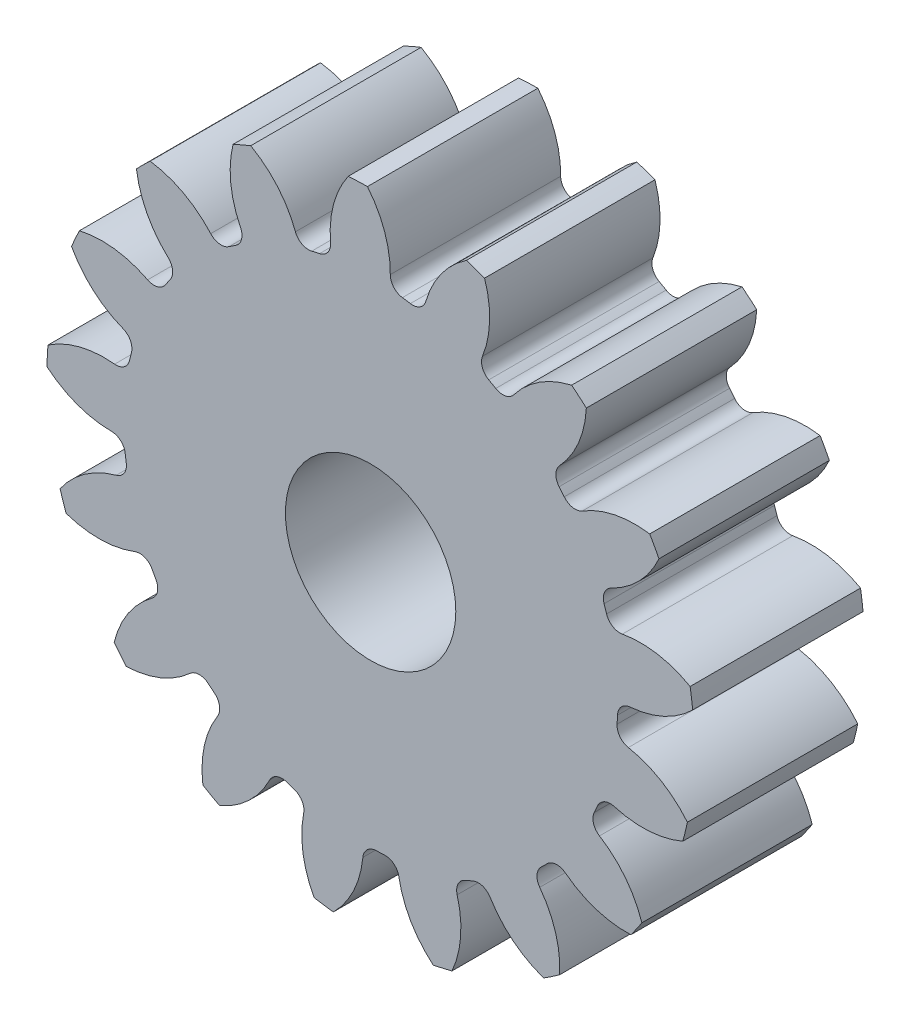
ISO-10303-21;
HEADER;
FILE_DESCRIPTION(('STEP AP214'),'2;1');
FILE_NAME('part.step','',(''),(''),'','','');
FILE_SCHEMA(('AUTOMOTIVE_DESIGN { 1 0 10303 214 1 1 1 1 }'));
ENDSEC;
DATA;
#1=APPLICATION_CONTEXT('core data for automotive mechanical design processes');
#2=APPLICATION_PROTOCOL_DEFINITION('international standard','automotive_design',2000,#1);
#3=PRODUCT_CONTEXT('',#1,'mechanical');
#4=PRODUCT('Part','Part','',(#3));
#5=PRODUCT_RELATED_PRODUCT_CATEGORY('part','',(#4));
#6=PRODUCT_DEFINITION_FORMATION('','',#4);
#7=PRODUCT_DEFINITION_CONTEXT('part definition',#1,'design');
#8=PRODUCT_DEFINITION('design','',#6,#7);
#9=PRODUCT_DEFINITION_SHAPE('','',#8);
#10=(LENGTH_UNIT() NAMED_UNIT(*) SI_UNIT(.MILLI.,.METRE.));
#11=(NAMED_UNIT(*) PLANE_ANGLE_UNIT() SI_UNIT($,.RADIAN.));
#12=(NAMED_UNIT(*) SI_UNIT($,.STERADIAN.) SOLID_ANGLE_UNIT());
#13=UNCERTAINTY_MEASURE_WITH_UNIT(LENGTH_MEASURE(1.E-05),#10,'distance_accuracy_value','');
#14=(GEOMETRIC_REPRESENTATION_CONTEXT(3) GLOBAL_UNCERTAINTY_ASSIGNED_CONTEXT((#13)) GLOBAL_UNIT_ASSIGNED_CONTEXT((#10,
#11,#12)) REPRESENTATION_CONTEXT('',''));
#15=CARTESIAN_POINT('',(0.,0.,0.));
#16=DIRECTION('',(0.,0.,1.));
#17=DIRECTION('',(1.,0.,0.));
#18=AXIS2_PLACEMENT_3D('',#15,#16,#17);
#19=CARTESIAN_POINT('',(0.,0.,101.6));
#20=DIRECTION('',(0.,0.,-1.));
#21=DIRECTION('',(-1.,0.,0.));
#22=AXIS2_PLACEMENT_3D('',#19,#20,#21);
#23=CYLINDRICAL_SURFACE('',#22,193.04);
#24=DIRECTION('',(0.,0.,-1.));
#25=VECTOR('',#24,1.);
#26=CARTESIAN_POINT('',(190.520926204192,31.0840518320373,50.8));
#27=LINE('',#26,#25);
#28=CARTESIAN_POINT('',(190.520926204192,31.0840518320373,101.6));
#29=VERTEX_POINT('',#28);
#30=CARTESIAN_POINT('',(190.520926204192,31.0840518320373,0.));
#31=VERTEX_POINT('',#30);
#32=EDGE_CURVE('E708',#29,#31,#27,.T.);
#33=ORIENTED_EDGE('',*,*,#32,.F.);
#34=CARTESIAN_POINT('',(0.,0.,101.6));
#35=DIRECTION('',(0.,0.,1.));
#36=DIRECTION('',(1.,0.,0.));
#37=AXIS2_PLACEMENT_3D('',#34,#35,#36);
#38=CIRCLE('',#37,193.04);
#39=CARTESIAN_POINT('',(192.033436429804,19.6875822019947,101.6));
#40=VERTEX_POINT('',#39);
#41=EDGE_CURVE('E1315',#40,#29,#38,.T.);
#42=ORIENTED_EDGE('',*,*,#41,.F.);
#43=DIRECTION('',(0.,0.,-1.));
#44=VECTOR('',#43,1.);
#45=CARTESIAN_POINT('',(192.033436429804,19.6875822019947,50.8));
#46=LINE('',#45,#44);
#47=CARTESIAN_POINT('',(192.033436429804,19.6875822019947,0.));
#48=VERTEX_POINT('',#47);
#49=EDGE_CURVE('E1309',#48,#40,#46,.F.);
#50=ORIENTED_EDGE('',*,*,#49,.F.);
#51=CARTESIAN_POINT('',(0.,0.,0.));
#52=DIRECTION('',(0.,0.,1.));
#53=DIRECTION('',(1.,0.,0.));
#54=AXIS2_PLACEMENT_3D('',#51,#52,#53);
#55=CIRCLE('',#54,193.04);
#56=EDGE_CURVE('E1320',#48,#31,#55,.T.);
#57=ORIENTED_EDGE('',*,*,#56,.T.);
#58=EDGE_LOOP('',(#33,#42,#50,#57));
#59=FACE_BOUND('',#58,.T.);
#60=ADVANCED_FACE('F33',(#59),#23,.T.);
#61=DIRECTION('',(0.,0.,-1.));
#62=VECTOR('',#61,1.);
#63=CARTESIAN_POINT('',(171.953871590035,87.7286022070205,50.8));
#64=LINE('',#63,#62);
#65=CARTESIAN_POINT('',(171.953871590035,87.7286022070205,0.));
#66=VERTEX_POINT('',#65);
#67=CARTESIAN_POINT('',(171.953871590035,87.7286022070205,101.6));
#68=VERTEX_POINT('',#67);
#69=EDGE_CURVE('E679',#66,#68,#64,.F.);
#70=ORIENTED_EDGE('',*,*,#69,.F.);
#71=CARTESIAN_POINT('',(166.426618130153,97.8091119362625,0.));
#72=VERTEX_POINT('',#71);
#73=EDGE_CURVE('E1323',#66,#72,#55,.T.);
#74=ORIENTED_EDGE('',*,*,#73,.T.);
#75=DIRECTION('',(0.,0.,-1.));
#76=VECTOR('',#75,1.);
#77=CARTESIAN_POINT('',(166.426618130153,97.8091119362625,50.8));
#78=LINE('',#77,#76);
#79=CARTESIAN_POINT('',(166.426618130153,97.8091119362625,101.6));
#80=VERTEX_POINT('',#79);
#81=EDGE_CURVE('E741',#80,#72,#78,.T.);
#82=ORIENTED_EDGE('',*,*,#81,.F.);
#83=EDGE_CURVE('E1318',#68,#80,#38,.T.);
#84=ORIENTED_EDGE('',*,*,#83,.F.);
#85=EDGE_LOOP('',(#70,#74,#82,#84));
#86=FACE_BOUND('',#85,.T.);
#87=ADVANCED_FACE('F1516',(#86),#23,.T.);
#88=CARTESIAN_POINT('',(0.,0.,101.6));
#89=DIRECTION('',(0.,0.,1.));
#90=DIRECTION('',(1.,0.,0.));
#91=AXIS2_PLACEMENT_3D('',#88,#89,#90);
#92=PLANE('',#91);
#93=CARTESIAN_POINT('',(0.,0.,101.599999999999));
#94=DIRECTION('',(0.,0.,1.));
#95=DIRECTION('',(1.,0.,0.));
#96=AXIS2_PLACEMENT_3D('',#93,#94,#95);
#97=CIRCLE('',#96,50.8);
#98=CARTESIAN_POINT('',(50.8,0.,101.599999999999));
#99=VERTEX_POINT('',#98);
#100=EDGE_CURVE('E696',#99,#99,#97,.T.);
#101=ORIENTED_EDGE('',*,*,#100,.F.);
#102=EDGE_LOOP('',(#101));
#103=FACE_BOUND('',#102,.T.);
#104=ORIENTED_EDGE('',*,*,#41,.T.);
#105=CARTESIAN_POINT('',(160.959172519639,-20.8479947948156,101.6));
#106=DIRECTION('',(0.,0.,-1.));
#107=DIRECTION('',(0.932472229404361,0.361241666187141,0.));
#108=AXIS2_PLACEMENT_3D('',#105,#106,#107);
#109=CIRCLE('',#108,59.7564619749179);
#110=CARTESIAN_POINT('',(150.11953299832,37.917105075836,101.6));
#111=VERTEX_POINT('',#110);
#112=EDGE_CURVE('E688',#111,#29,#109,.T.);
#113=ORIENTED_EDGE('',*,*,#112,.F.);
#114=CARTESIAN_POINT('',(148.619336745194,46.050141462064,101.6));
#115=DIRECTION('',(0.,0.,1.));
#116=DIRECTION('',(-0.932472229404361,-0.361241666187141,0.));
#117=AXIS2_PLACEMENT_3D('',#114,#115,#116);
#118=CIRCLE('',#117,8.27024000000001);
#119=CARTESIAN_POINT('',(140.71962797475,43.6023933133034,101.6));
#120=VERTEX_POINT('',#119);
#121=EDGE_CURVE('E686',#120,#111,#118,.T.);
#122=ORIENTED_EDGE('',*,*,#121,.F.);
#123=CARTESIAN_POINT('',(0.,0.,101.6));
#124=DIRECTION('',(0.,0.,-1.));
#125=DIRECTION('',(0.932472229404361,0.361241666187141,0.));
#126=AXIS2_PLACEMENT_3D('',#123,#124,#125);
#127=CIRCLE('',#126,147.32);
#128=CARTESIAN_POINT('',(139.226139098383,48.1587436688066,101.6));
#129=VERTEX_POINT('',#128);
#130=EDGE_CURVE('E671',#129,#120,#127,.T.);
#131=ORIENTED_EDGE('',*,*,#130,.F.);
#132=CARTESIAN_POINT('',(147.042006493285,50.8622758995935,101.6));
#133=DIRECTION('',(0.,0.,1.));
#134=DIRECTION('',(-0.932472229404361,-0.361241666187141,0.));
#135=AXIS2_PLACEMENT_3D('',#132,#133,#134);
#136=CIRCLE('',#135,8.27024);
#137=CARTESIAN_POINT('',(143.436658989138,58.3052819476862,101.6));
#138=VERTEX_POINT('',#137);
#139=EDGE_CURVE('E663',#138,#129,#136,.T.);
#140=ORIENTED_EDGE('',*,*,#139,.F.);
#141=CARTESIAN_POINT('',(117.386289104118,112.084580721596,101.6));
#142=DIRECTION('',(0.,0.,-1.));
#143=DIRECTION('',(-0.932472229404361,-0.361241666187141,0.));
#144=AXIS2_PLACEMENT_3D('',#141,#142,#143);
#145=CIRCLE('',#144,59.7564619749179);
#146=EDGE_CURVE('E693',#68,#138,#145,.T.);
#147=ORIENTED_EDGE('',*,*,#146,.F.);
#148=ORIENTED_EDGE('',*,*,#83,.T.);
#149=CARTESIAN_POINT('',(157.621122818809,38.7049834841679,101.6));
#150=DIRECTION('',(0.,0.,-1.));
#151=DIRECTION('',(0.739008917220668,0.673695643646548,0.));
#152=AXIS2_PLACEMENT_3D('',#149,#150,#151);
#153=CIRCLE('',#152,59.7564619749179);
#154=CARTESIAN_POINT('',(126.285057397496,89.5860777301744,101.6));
#155=VERTEX_POINT('',#154);
#156=EDGE_CURVE('E717',#155,#80,#153,.T.);
#157=ORIENTED_EDGE('',*,*,#156,.F.);
#158=CARTESIAN_POINT('',(121.948174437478,96.6279749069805,101.6));
#159=DIRECTION('',(0.,0.,1.));
#160=DIRECTION('',(-0.739008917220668,-0.673695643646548,0.));
#161=AXIS2_PLACEMENT_3D('',#158,#159,#160);
#162=CIRCLE('',#161,8.27024000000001);
#163=CARTESIAN_POINT('',(115.466144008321,91.4918137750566,101.6));
#164=VERTEX_POINT('',#163);
#165=EDGE_CURVE('E715',#164,#155,#162,.T.);
#166=ORIENTED_EDGE('',*,*,#165,.F.);
#167=CARTESIAN_POINT('',(0.,0.,101.6));
#168=DIRECTION('',(0.,0.,-1.));
#169=DIRECTION('',(0.739008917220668,0.673695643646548,0.));
#170=AXIS2_PLACEMENT_3D('',#167,#168,#169);
#171=CIRCLE('',#170,147.32);
#172=CARTESIAN_POINT('',(112.42756351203,95.2009735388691,101.6));
#173=VERTEX_POINT('',#172);
#174=EDGE_CURVE('E712',#173,#164,#171,.T.);
#175=ORIENTED_EDGE('',*,*,#174,.F.);
#176=CARTESIAN_POINT('',(118.739014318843,100.54535922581,101.6));
#177=DIRECTION('',(0.,0.,1.));
#178=DIRECTION('',(-0.739008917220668,-0.673695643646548,0.));
#179=AXIS2_PLACEMENT_3D('',#176,#177,#178);
#180=CIRCLE('',#179,8.27024);
#181=CARTESIAN_POINT('',(112.68840398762,106.183353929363,101.6));
#182=VERTEX_POINT('',#181);
#183=EDGE_CURVE('E710',#182,#173,#180,.T.);
#184=ORIENTED_EDGE('',*,*,#183,.F.);
#185=CARTESIAN_POINT('',(68.9698340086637,146.920577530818,101.6));
#186=DIRECTION('',(0.,0.,-1.));
#187=DIRECTION('',(-0.739008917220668,-0.673695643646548,0.));
#188=AXIS2_PLACEMENT_3D('',#185,#186,#187);
#189=CIRCLE('',#188,59.7564619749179);
#190=CARTESIAN_POINT('',(128.650983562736,143.921388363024,101.6));
#191=VERTEX_POINT('',#190);
#192=EDGE_CURVE('E720',#191,#182,#189,.T.);
#193=ORIENTED_EDGE('',*,*,#192,.F.);
#194=CARTESIAN_POINT('',(119.85547307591,151.324509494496,101.6));
#195=VERTEX_POINT('',#194);
#196=EDGE_CURVE('E1365',#191,#195,#38,.T.);
#197=ORIENTED_EDGE('',*,*,#196,.T.);
#198=CARTESIAN_POINT('',(132.995467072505,93.0306392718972,101.6));
#199=DIRECTION('',(0.,0.,-1.));
#200=DIRECTION('',(0.445738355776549,0.895163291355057,0.));
#201=AXIS2_PLACEMENT_3D('',#198,#199,#200);
#202=CIRCLE('',#201,59.7564619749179);
#203=CARTESIAN_POINT('',(85.3950850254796,129.155954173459,101.6));
#204=VERTEX_POINT('',#203);
#205=EDGE_CURVE('E752',#204,#195,#202,.T.);
#206=ORIENTED_EDGE('',*,*,#205,.F.);
#207=CARTESIAN_POINT('',(78.8072354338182,134.155664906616,101.6));
#208=DIRECTION('',(0.,0.,1.));
#209=DIRECTION('',(-0.445738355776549,-0.895163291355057,0.));
#210=AXIS2_PLACEMENT_3D('',#207,#208,#209);
#211=CIRCLE('',#210,8.27024000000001);
#212=CARTESIAN_POINT('',(74.6183174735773,127.024757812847,101.6));
#213=VERTEX_POINT('',#212);
#214=EDGE_CURVE('E750',#213,#204,#211,.T.);
#215=ORIENTED_EDGE('',*,*,#214,.F.);
#216=CARTESIAN_POINT('',(0.,0.,101.6));
#217=DIRECTION('',(0.,0.,-1.));
#218=DIRECTION('',(0.445738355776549,0.895163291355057,0.));
#219=AXIS2_PLACEMENT_3D('',#216,#217,#218);
#220=CIRCLE('',#219,147.32);
#221=CARTESIAN_POINT('',(70.4450224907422,129.385784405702,101.6));
#222=VERTEX_POINT('',#221);
#223=EDGE_CURVE('E747',#222,#213,#220,.T.);
#224=ORIENTED_EDGE('',*,*,#223,.F.);
#225=CARTESIAN_POINT('',(74.39966030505,136.649234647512,101.6));
#226=DIRECTION('',(0.,0.,1.));
#227=DIRECTION('',(-0.445738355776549,-0.895163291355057,0.));
#228=AXIS2_PLACEMENT_3D('',#225,#226,#227);
#229=CIRCLE('',#228,8.27024);
#230=CARTESIAN_POINT('',(66.7209555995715,139.720775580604,101.6));
#231=VERTEX_POINT('',#230);
#232=EDGE_CURVE('E745',#231,#222,#229,.T.);
#233=ORIENTED_EDGE('',*,*,#232,.F.);
#234=CARTESIAN_POINT('',(11.2386206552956,161.914136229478,101.6));
#235=DIRECTION('',(0.,0.,-1.));
#236=DIRECTION('',(-0.445738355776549,-0.895163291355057,0.));
#237=AXIS2_PLACEMENT_3D('',#234,#235,#236);
#238=CIRCLE('',#237,59.7564619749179);
#239=CARTESIAN_POINT('',(67.9730673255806,180.676793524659,101.6));
#240=VERTEX_POINT('',#239);
#241=EDGE_CURVE('E755',#240,#231,#238,.T.);
#242=ORIENTED_EDGE('',*,*,#241,.F.);
#243=CARTESIAN_POINT('',(57.0971822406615,184.402693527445,101.6));
#244=VERTEX_POINT('',#243);
#245=EDGE_CURVE('E1498',#240,#244,#38,.T.);
#246=ORIENTED_EDGE('',*,*,#245,.T.);
#247=CARTESIAN_POINT('',(90.4080365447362,134.791991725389,101.6));
#248=DIRECTION('',(0.,0.,-1.));
#249=DIRECTION('',(0.092268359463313,0.995734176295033,0.));
#250=AXIS2_PLACEMENT_3D('',#247,#248,#249);
#251=CIRCLE('',#250,59.7564619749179);
#252=CARTESIAN_POINT('',(32.9720332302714,151.28260332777,101.6));
#253=VERTEX_POINT('',#252);
#254=EDGE_CURVE('E790',#253,#244,#251,.T.);
#255=ORIENTED_EDGE('',*,*,#254,.F.);
#256=CARTESIAN_POINT('',(25.0229425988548,153.564888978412,101.6));
#257=DIRECTION('',(0.,0.,1.));
#258=DIRECTION('',(-0.092268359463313,-0.995734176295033,0.));
#259=AXIS2_PLACEMENT_3D('',#256,#257,#258);
#260=CIRCLE('',#259,8.27024000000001);
#261=CARTESIAN_POINT('',(23.6928736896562,145.402304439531,101.6));
#262=VERTEX_POINT('',#261);
#263=EDGE_CURVE('E788',#262,#253,#260,.T.);
#264=ORIENTED_EDGE('',*,*,#263,.F.);
#265=CARTESIAN_POINT('',(0.,0.,101.6));
#266=DIRECTION('',(0.,0.,-1.));
#267=DIRECTION('',(0.092268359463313,0.995734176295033,0.));
#268=AXIS2_PLACEMENT_3D('',#265,#266,#267);
#269=CIRCLE('',#268,147.32);
#270=CARTESIAN_POINT('',(18.9484908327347,146.096328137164,101.6));
#271=VERTEX_POINT('',#270);
#272=EDGE_CURVE('E785',#271,#262,#269,.T.);
#273=ORIENTED_EDGE('',*,*,#272,.F.);
#274=CARTESIAN_POINT('',(20.0122199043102,154.297873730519,101.6));
#275=DIRECTION('',(0.,0.,1.));
#276=DIRECTION('',(-0.092268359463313,-0.995734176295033,0.));
#277=AXIS2_PLACEMENT_3D('',#274,#275,#276);
#278=CIRCLE('',#277,8.27024);
#279=CARTESIAN_POINT('',(11.7424724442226,154.38813227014,101.6));
#280=VERTEX_POINT('',#279);
#281=EDGE_CURVE('E783',#280,#271,#278,.T.);
#282=ORIENTED_EDGE('',*,*,#281,.F.);
#283=CARTESIAN_POINT('',(-48.0104306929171,155.040293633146,101.6));
#284=DIRECTION('',(0.,0.,-1.));
#285=DIRECTION('',(-0.092268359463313,-0.995734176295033,0.));
#286=AXIS2_PLACEMENT_3D('',#283,#284,#285);
#287=CIRCLE('',#286,59.7564619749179);
#288=CARTESIAN_POINT('',(-1.88498830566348,193.030796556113,101.6));
#289=VERTEX_POINT('',#288);
#290=EDGE_CURVE('E793',#289,#280,#287,.T.);
#291=ORIENTED_EDGE('',*,*,#290,.F.);
#292=CARTESIAN_POINT('',(-13.3723994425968,192.576271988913,101.6));
#293=VERTEX_POINT('',#292);
#294=EDGE_CURVE('E1494',#289,#293,#38,.T.);
#295=ORIENTED_EDGE('',*,*,#294,.T.);
#296=CARTESIAN_POINT('',(35.6104997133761,158.348938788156,101.6));
#297=DIRECTION('',(0.,0.,-1.));
#298=DIRECTION('',(-0.273662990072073,0.961825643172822,0.));
#299=AXIS2_PLACEMENT_3D('',#296,#297,#298);
#300=CIRCLE('',#299,59.7564619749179);
#301=CARTESIAN_POINT('',(-23.9040743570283,152.977698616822,101.6));
#302=VERTEX_POINT('',#301);
#303=EDGE_CURVE('E828',#302,#293,#300,.T.);
#304=ORIENTED_EDGE('',*,*,#303,.F.);
#305=CARTESIAN_POINT('',(-32.1408372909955,152.234323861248,101.6));
#306=DIRECTION('',(0.,0.,1.));
#307=DIRECTION('',(0.273662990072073,-0.961825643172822,0.));
#308=AXIS2_PLACEMENT_3D('',#305,#306,#307);
#309=CIRCLE('',#308,8.27024000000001);
#310=CARTESIAN_POINT('',(-30.4324239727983,144.142464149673,101.6));
#311=VERTEX_POINT('',#310);
#312=EDGE_CURVE('E826',#311,#302,#309,.T.);
#313=ORIENTED_EDGE('',*,*,#312,.F.);
#314=CARTESIAN_POINT('',(0.,0.,101.6));
#315=DIRECTION('',(0.,0.,-1.));
#316=DIRECTION('',(-0.273662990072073,0.961825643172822,0.));
#317=AXIS2_PLACEMENT_3D('',#314,#315,#316);
#318=CIRCLE('',#317,147.32);
#319=CARTESIAN_POINT('',(-35.107139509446,143.075753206,101.6));
#320=VERTEX_POINT('',#319);
#321=EDGE_CURVE('E823',#320,#311,#318,.T.);
#322=ORIENTED_EDGE('',*,*,#321,.F.);
#323=CARTESIAN_POINT('',(-37.0779816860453,151.107729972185,101.6));
#324=DIRECTION('',(0.,0.,1.));
#325=DIRECTION('',(0.273662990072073,-0.961825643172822,0.));
#326=AXIS2_PLACEMENT_3D('',#323,#324,#325);
#327=CIRCLE('',#326,8.27024);
#328=CARTESIAN_POINT('',(-44.8218966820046,148.20451620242,101.6));
#329=VERTEX_POINT('',#328);
#330=EDGE_CURVE('E821',#329,#320,#327,.T.);
#331=ORIENTED_EDGE('',*,*,#330,.F.);
#332=CARTESIAN_POINT('',(-100.775407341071,127.227400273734,101.6));
#333=DIRECTION('',(0.,0.,-1.));
#334=DIRECTION('',(0.273662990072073,-0.961825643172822,0.));
#335=AXIS2_PLACEMENT_3D('',#332,#333,#334);
#336=CIRCLE('',#335,59.7564619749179);
#337=CARTESIAN_POINT('',(-71.488465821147,179.314920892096,101.6));
#338=VERTEX_POINT('',#337);
#339=EDGE_CURVE('E831',#338,#329,#336,.T.);
#340=ORIENTED_EDGE('',*,*,#339,.F.);
#341=CARTESIAN_POINT('',(-82.0359644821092,174.741357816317,101.6));
#342=VERTEX_POINT('',#341);
#343=EDGE_CURVE('E1490',#338,#342,#38,.T.);
#344=ORIENTED_EDGE('',*,*,#343,.T.);
#345=CARTESIAN_POINT('',(-23.9964324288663,160.519984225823,101.6));
#346=DIRECTION('',(0.,0.,-1.));
#347=DIRECTION('',(-0.602634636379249,0.798017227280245,0.));
#348=AXIS2_PLACEMENT_3D('',#345,#346,#347);
#349=CIRCLE('',#348,59.7564619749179);
#350=CARTESIAN_POINT('',(-77.5518042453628,134.012308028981,101.6));
#351=VERTEX_POINT('',#350);
#352=EDGE_CURVE('E866',#351,#342,#349,.T.);
#353=ORIENTED_EDGE('',*,*,#352,.F.);
#354=CARTESIAN_POINT('',(-84.9638190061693,130.343669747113,101.6));
#355=DIRECTION('',(0.,0.,1.));
#356=DIRECTION('',(0.602634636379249,-0.798017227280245,0.));
#357=AXIS2_PLACEMENT_3D('',#354,#355,#356);
#358=CIRCLE('',#357,8.27024000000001);
#359=CARTESIAN_POINT('',(-80.4476541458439,123.415385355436,101.6));
#360=VERTEX_POINT('',#359);
#361=EDGE_CURVE('E864',#360,#351,#358,.T.);
#362=ORIENTED_EDGE('',*,*,#361,.F.);
#363=CARTESIAN_POINT('',(0.,0.,101.6));
#364=DIRECTION('',(0.,0.,-1.));
#365=DIRECTION('',(-0.602634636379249,0.798017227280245,0.));
#366=AXIS2_PLACEMENT_3D('',#363,#364,#365);
#367=CIRCLE('',#366,147.32);
#368=CARTESIAN_POINT('',(-84.4213561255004,120.732004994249,101.6));
#369=VERTEX_POINT('',#368);
#370=EDGE_CURVE('E861',#369,#360,#367,.T.);
#371=ORIENTED_EDGE('',*,*,#370,.F.);
#372=CARTESIAN_POINT('',(-89.1605963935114,127.509649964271,101.6));
#373=DIRECTION('',(0.,0.,1.));
#374=DIRECTION('',(0.602634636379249,-0.798017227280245,0.));
#375=AXIS2_PLACEMENT_3D('',#372,#373,#374);
#376=CIRCLE('',#375,8.27024);
#377=CARTESIAN_POINT('',(-95.3328202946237,122.005058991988,101.6));
#378=VERTEX_POINT('',#377);
#379=EDGE_CURVE('E859',#378,#369,#376,.T.);
#380=ORIENTED_EDGE('',*,*,#379,.F.);
#381=CARTESIAN_POINT('',(-139.930106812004,82.2317415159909,101.6));
#382=DIRECTION('',(0.,0.,-1.));
#383=DIRECTION('',(0.602634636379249,-0.798017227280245,0.));
#384=AXIS2_PLACEMENT_3D('',#381,#382,#383);
#385=CIRCLE('',#384,59.7564619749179);
#386=CARTESIAN_POINT('',(-131.437029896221,141.381571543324,101.6));
#387=VERTEX_POINT('',#386);
#388=EDGE_CURVE('E869',#387,#378,#385,.T.);
#389=ORIENTED_EDGE('',*,*,#388,.F.);
#390=CARTESIAN_POINT('',(-139.620117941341,133.306654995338,101.6));
#391=VERTEX_POINT('',#390);
#392=EDGE_CURVE('E1486',#387,#391,#38,.T.);
#393=ORIENTED_EDGE('',*,*,#392,.T.);
#394=CARTESIAN_POINT('',(-80.3625134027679,141.011916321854,101.6));
#395=DIRECTION('',(0.,0.,-1.));
#396=DIRECTION('',(-0.85021713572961,0.526432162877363,0.));
#397=AXIS2_PLACEMENT_3D('',#394,#395,#396);
#398=CIRCLE('',#397,59.7564619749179);
#399=CARTESIAN_POINT('',(-120.725733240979,96.9478126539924,101.6));
#400=VERTEX_POINT('',#399);
#401=EDGE_CURVE('E904',#400,#391,#398,.T.);
#402=ORIENTED_EDGE('',*,*,#401,.F.);
#403=CARTESIAN_POINT('',(-126.311966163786,90.8493807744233,101.6));
#404=DIRECTION('',(0.,0.,1.));
#405=DIRECTION('',(0.85021713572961,-0.526432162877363,0.));
#406=AXIS2_PLACEMENT_3D('',#403,#404,#405);
#407=CIRCLE('',#406,8.27024000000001);
#408=CARTESIAN_POINT('',(-119.597982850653,86.0203749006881,101.6));
#409=VERTEX_POINT('',#408);
#410=EDGE_CURVE('E902',#409,#400,#407,.T.);
#411=ORIENTED_EDGE('',*,*,#410,.F.);
#412=CARTESIAN_POINT('',(0.,0.,101.6));
#413=DIRECTION('',(0.,0.,-1.));
#414=DIRECTION('',(-0.85021713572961,0.526432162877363,0.));
#415=AXIS2_PLACEMENT_3D('',#412,#413,#414);
#416=CIRCLE('',#415,147.32);
#417=CARTESIAN_POINT('',(-122.334000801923,82.0827305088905,101.6));
#418=VERTEX_POINT('',#417);
#419=EDGE_CURVE('E899',#418,#409,#416,.T.);
#420=ORIENTED_EDGE('',*,*,#419,.F.);
#421=CARTESIAN_POINT('',(-129.201578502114,86.6906851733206,101.6));
#422=DIRECTION('',(0.,0.,1.));
#423=DIRECTION('',(0.85021713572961,-0.526432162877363,0.));
#424=AXIS2_PLACEMENT_3D('',#421,#422,#423);
#425=CIRCLE('',#424,8.27024);
#426=CARTESIAN_POINT('',(-132.96851826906,79.328142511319,101.6));
#427=VERTEX_POINT('',#426);
#428=EDGE_CURVE('E897',#427,#418,#425,.T.);
#429=ORIENTED_EDGE('',*,*,#428,.F.);
#430=CARTESIAN_POINT('',(-160.186469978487,26.130230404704,101.6));
#431=DIRECTION('',(0.,0.,-1.));
#432=DIRECTION('',(0.85021713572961,-0.526432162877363,0.));
#433=AXIS2_PLACEMENT_3D('',#430,#431,#432);
#434=CIRCLE('',#433,59.7564619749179);
#435=CARTESIAN_POINT('',(-173.634294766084,84.3538575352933,101.6));
#436=VERTEX_POINT('',#435);
#437=EDGE_CURVE('E907',#436,#427,#434,.T.);
#438=ORIENTED_EDGE('',*,*,#437,.F.);
#439=CARTESIAN_POINT('',(-178.347800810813,73.8681497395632,101.6));
#440=VERTEX_POINT('',#439);
#441=EDGE_CURVE('E1482',#436,#440,#38,.T.);
#442=ORIENTED_EDGE('',*,*,#441,.T.);
#443=CARTESIAN_POINT('',(-125.875191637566,102.459407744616,101.6));
#444=DIRECTION('',(0.,0.,-1.));
#445=DIRECTION('',(-0.9829730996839,0.183749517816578,0.));
#446=AXIS2_PLACEMENT_3D('',#443,#444,#445);
#447=CIRCLE('',#446,59.7564619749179);
#448=CARTESIAN_POINT('',(-147.594982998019,46.7899779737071,101.6));
#449=VERTEX_POINT('',#448);
#450=EDGE_CURVE('E942',#449,#440,#447,.T.);
#451=ORIENTED_EDGE('',*,*,#450,.F.);
#452=CARTESIAN_POINT('',(-150.600982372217,39.0853795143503,101.6));
#453=DIRECTION('',(0.,0.,1.));
#454=DIRECTION('',(0.9829730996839,-0.183749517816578,0.));
#455=AXIS2_PLACEMENT_3D('',#452,#453,#454);
#456=CIRCLE('',#455,8.27024000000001);
#457=CARTESIAN_POINT('',(-142.59594125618,37.0078361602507,101.6));
#458=VERTEX_POINT('',#457);
#459=EDGE_CURVE('E940',#458,#449,#456,.T.);
#460=ORIENTED_EDGE('',*,*,#459,.F.);
#461=CARTESIAN_POINT('',(0.,0.,101.6));
#462=DIRECTION('',(0.,0.,-1.));
#463=DIRECTION('',(-0.9829730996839,0.183749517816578,0.));
#464=AXIS2_PLACEMENT_3D('',#461,#462,#463);
#465=CIRCLE('',#464,147.32);
#466=CARTESIAN_POINT('',(-143.724760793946,32.3477284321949,101.6));
#467=VERTEX_POINT('',#466);
#468=EDGE_CURVE('E937',#467,#458,#465,.T.);
#469=ORIENTED_EDGE('',*,*,#468,.F.);
#470=CARTESIAN_POINT('',(-151.793171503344,34.1636629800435,101.6));
#471=DIRECTION('',(0.,0.,1.));
#472=DIRECTION('',(0.9829730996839,-0.183749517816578,0.));
#473=AXIS2_PLACEMENT_3D('',#470,#471,#472);
#474=CIRCLE('',#473,8.27024);
#475=CARTESIAN_POINT('',(-152.646081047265,25.9375208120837,101.6));
#476=VERTEX_POINT('',#475);
#477=EDGE_CURVE('E935',#476,#467,#474,.T.);
#478=ORIENTED_EDGE('',*,*,#477,.F.);
#479=CARTESIAN_POINT('',(-158.808762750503,-33.5003131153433,101.6));
#480=DIRECTION('',(0.,0.,-1.));
#481=DIRECTION('',(0.9829730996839,-0.183749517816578,0.));
#482=AXIS2_PLACEMENT_3D('',#479,#480,#481);
#483=CIRCLE('',#482,59.7564619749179);
#484=CARTESIAN_POINT('',(-192.381285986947,15.9336876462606,101.6));
#485=VERTEX_POINT('',#484);
#486=EDGE_CURVE('E945',#485,#476,#483,.T.);
#487=ORIENTED_EDGE('',*,*,#486,.F.);
#488=CARTESIAN_POINT('',(-192.988624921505,4.45334154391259,101.6));
#489=VERTEX_POINT('',#488);
#490=EDGE_CURVE('E1478',#485,#489,#38,.T.);
#491=ORIENTED_EDGE('',*,*,#490,.T.);
#492=CARTESIAN_POINT('',(-154.387727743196,50.0691884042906,101.6));
#493=DIRECTION('',(0.,0.,-1.));
#494=DIRECTION('',(-0.982973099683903,-0.183749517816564,0.));
#495=AXIS2_PLACEMENT_3D('',#492,#493,#494);
#496=CIRCLE('',#495,59.7564619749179);
#497=CARTESIAN_POINT('',(-154.530712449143,-9.68710250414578,101.6));
#498=VERTEX_POINT('',#497);
#499=EDGE_CURVE('E980',#498,#489,#496,.T.);
#500=ORIENTED_EDGE('',*,*,#499,.F.);
#501=CARTESIAN_POINT('',(-154.550501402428,-17.9573188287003,101.6));
#502=DIRECTION('',(0.,0.,1.));
#503=DIRECTION('',(0.982973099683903,0.183749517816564,0.));
#504=AXIS2_PLACEMENT_3D('',#501,#502,#503);
#505=CIRCLE('',#504,8.27024000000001);
#506=CARTESIAN_POINT('',(-146.335527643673,-17.002815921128,101.6));
#507=VERTEX_POINT('',#506);
#508=EDGE_CURVE('E978',#507,#498,#505,.T.);
#509=ORIENTED_EDGE('',*,*,#508,.F.);
#510=CARTESIAN_POINT('',(0.,0.,101.6));
#511=DIRECTION('',(0.,0.,-1.));
#512=DIRECTION('',(-0.982973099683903,-0.183749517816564,0.));
#513=AXIS2_PLACEMENT_3D('',#510,#511,#512);
#514=CIRCLE('',#513,147.32);
#515=CARTESIAN_POINT('',(-145.704695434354,-21.7560136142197,101.6));
#516=VERTEX_POINT('',#515);
#517=EDGE_CURVE('E975',#516,#507,#514,.T.);
#518=ORIENTED_EDGE('',*,*,#517,.F.);
#519=CARTESIAN_POINT('',(-153.884255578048,-22.9773512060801,101.6));
#520=DIRECTION('',(0.,0.,1.));
#521=DIRECTION('',(0.982973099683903,0.183749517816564,0.));
#522=AXIS2_PLACEMENT_3D('',#519,#520,#521);
#523=CIRCLE('',#522,8.27024);
#524=CARTESIAN_POINT('',(-151.707944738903,-30.9561067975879,101.6));
#525=VERTEX_POINT('',#524);
#526=EDGE_CURVE('E973',#525,#516,#523,.T.);
#527=ORIENTED_EDGE('',*,*,#526,.F.);
#528=CARTESIAN_POINT('',(-135.983052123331,-88.6064537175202,101.6));
#529=DIRECTION('',(0.,0.,-1.));
#530=DIRECTION('',(0.982973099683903,0.183749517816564,0.));
#531=AXIS2_PLACEMENT_3D('',#528,#529,#530);
#532=CIRCLE('',#531,59.7564619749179);
#533=CARTESIAN_POINT('',(-185.146118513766,-54.6384150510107,101.6));
#534=VERTEX_POINT('',#533);
#535=EDGE_CURVE('E983',#534,#525,#532,.T.);
#536=ORIENTED_EDGE('',*,*,#535,.F.);
#537=CARTESIAN_POINT('',(-181.56526584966,-65.5629151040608,101.6));
#538=VERTEX_POINT('',#537);
#539=EDGE_CURVE('E1474',#534,#538,#38,.T.);
#540=ORIENTED_EDGE('',*,*,#539,.T.);
#541=CARTESIAN_POINT('',(-162.049345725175,-9.08315227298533,101.6));
#542=DIRECTION('',(0.,0.,-1.));
#543=DIRECTION('',(-0.850217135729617,-0.526432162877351,0.));
#544=AXIS2_PLACEMENT_3D('',#541,#542,#543);
#545=CIRCLE('',#544,59.7564619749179);
#546=CARTESIAN_POINT('',(-140.596212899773,-64.8558861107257,101.6));
#547=VERTEX_POINT('',#546);
#548=EDGE_CURVE('E1018',#547,#538,#545,.T.);
#549=ORIENTED_EDGE('',*,*,#548,.F.);
#550=CARTESIAN_POINT('',(-137.62711882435,-72.5747817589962,101.6));
#551=DIRECTION('',(0.,0.,1.));
#552=DIRECTION('',(0.850217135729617,0.526432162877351,0.));
#553=AXIS2_PLACEMENT_3D('',#550,#551,#552);
#554=CIRCLE('',#553,8.27024000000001);
#555=CARTESIAN_POINT('',(-130.311690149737,-68.7171434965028,101.6));
#556=VERTEX_POINT('',#555);
#557=EDGE_CURVE('E1016',#556,#547,#554,.T.);
#558=ORIENTED_EDGE('',*,*,#557,.F.);
#559=CARTESIAN_POINT('',(0.,0.,101.6));
#560=DIRECTION('',(0.,0.,-1.));
#561=DIRECTION('',(-0.850217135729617,-0.526432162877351,0.));
#562=AXIS2_PLACEMENT_3D('',#559,#560,#561);
#563=CIRCLE('',#562,147.32);
#564=CARTESIAN_POINT('',(-128.006403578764,-72.9214854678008,101.6));
#565=VERTEX_POINT('',#564);
#566=EDGE_CURVE('E1013',#565,#556,#563,.T.);
#567=ORIENTED_EDGE('',*,*,#566,.F.);
#568=CARTESIAN_POINT('',(-135.19241823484,-77.0151467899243,101.6));
#569=DIRECTION('',(0.,0.,1.));
#570=DIRECTION('',(0.850217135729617,0.526432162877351,0.));
#571=AXIS2_PLACEMENT_3D('',#568,#569,#570);
#572=CIRCLE('',#571,8.27024);
#573=CARTESIAN_POINT('',(-130.280809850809,-83.6689406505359,101.6));
#574=VERTEX_POINT('',#573);
#575=EDGE_CURVE('E1011',#574,#565,#572,.T.);
#576=ORIENTED_EDGE('',*,*,#575,.F.);
#577=CARTESIAN_POINT('',(-94.7920767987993,-131.745801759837,101.6));
#578=DIRECTION('',(0.,0.,-1.));
#579=DIRECTION('',(0.850217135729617,0.526432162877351,0.));
#580=AXIS2_PLACEMENT_3D('',#577,#578,#579);
#581=CIRCLE('',#580,59.7564619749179);
#582=CARTESIAN_POINT('',(-152.905941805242,-117.831297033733,101.6));
#583=VERTEX_POINT('',#582);
#584=EDGE_CURVE('E1021',#583,#574,#581,.T.);
#585=ORIENTED_EDGE('',*,*,#584,.F.);
#586=CARTESIAN_POINT('',(-145.620511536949,-126.724536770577,101.6));
#587=VERTEX_POINT('',#586);
#588=EDGE_CURVE('E1470',#583,#587,#38,.T.);
#589=ORIENTED_EDGE('',*,*,#588,.T.);
#590=CARTESIAN_POINT('',(-147.825301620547,-67.0087629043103,101.6));
#591=DIRECTION('',(0.,0.,-1.));
#592=DIRECTION('',(-0.602634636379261,-0.798017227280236,0.));
#593=AXIS2_PLACEMENT_3D('',#590,#591,#592);
#594=CIRCLE('',#593,59.7564619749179);
#595=CARTESIAN_POINT('',(-107.673415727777,-111.265522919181,101.6));
#596=VERTEX_POINT('',#595);
#597=EDGE_CURVE('E1056',#596,#587,#594,.T.);
#598=ORIENTED_EDGE('',*,*,#597,.F.);
#599=CARTESIAN_POINT('',(-102.116431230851,-117.390618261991,101.6));
#600=DIRECTION('',(0.,0.,1.));
#601=DIRECTION('',(0.602634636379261,0.798017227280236,0.));
#602=AXIS2_PLACEMENT_3D('',#599,#600,#601);
#603=CIRCLE('',#602,8.27024000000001);
#604=CARTESIAN_POINT('',(-96.6885368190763,-111.150840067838,101.6));
#605=VERTEX_POINT('',#604);
#606=EDGE_CURVE('E1054',#605,#596,#603,.T.);
#607=ORIENTED_EDGE('',*,*,#606,.F.);
#608=CARTESIAN_POINT('',(0.,0.,101.6));
#609=DIRECTION('',(0.,0.,-1.));
#610=DIRECTION('',(-0.602634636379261,-0.798017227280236,0.));
#611=AXIS2_PLACEMENT_3D('',#608,#609,#610);
#612=CIRCLE('',#611,147.32);
#613=CARTESIAN_POINT('',(-93.0201376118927,-114.238506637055,101.6));
#614=VERTEX_POINT('',#613);
#615=EDGE_CURVE('E1051',#614,#605,#612,.T.);
#616=ORIENTED_EDGE('',*,*,#615,.F.);
#617=CARTESIAN_POINT('',(-98.2420956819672,-120.651620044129,101.6));
#618=DIRECTION('',(0.,0.,1.));
#619=DIRECTION('',(0.602634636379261,0.798017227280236,0.));
#620=AXIS2_PLACEMENT_3D('',#617,#618,#619);
#621=CIRCLE('',#620,8.27024);
#622=CARTESIAN_POINT('',(-91.2585296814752,-125.081820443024,101.6));
#623=VERTEX_POINT('',#622);
#624=EDGE_CURVE('E1049',#623,#614,#621,.T.);
#625=ORIENTED_EDGE('',*,*,#624,.F.);
#626=CARTESIAN_POINT('',(-40.7989062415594,-157.092149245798,101.6));
#627=DIRECTION('',(0.,0.,-1.));
#628=DIRECTION('',(0.602634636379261,0.798017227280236,0.));
#629=AXIS2_PLACEMENT_3D('',#626,#627,#628);
#630=CIRCLE('',#629,59.7564619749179);
#631=CARTESIAN_POINT('',(-100.014970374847,-165.110409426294,101.6));
#632=VERTEX_POINT('',#631);
#633=EDGE_CURVE('E1059',#632,#623,#630,.T.);
#634=ORIENTED_EDGE('',*,*,#633,.F.);
#635=CARTESIAN_POINT('',(-90.0089002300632,-170.771307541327,101.6));
#636=VERTEX_POINT('',#635);
#637=EDGE_CURVE('E1466',#632,#636,#38,.T.);
#638=ORIENTED_EDGE('',*,*,#637,.T.);
#639=CARTESIAN_POINT('',(-113.636631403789,-115.884468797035,101.6));
#640=DIRECTION('',(0.,0.,-1.));
#641=DIRECTION('',(-0.273662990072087,-0.961825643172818,0.));
#642=AXIS2_PLACEMENT_3D('',#639,#640,#641);
#643=CIRCLE('',#642,59.7564619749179);
#644=CARTESIAN_POINT('',(-60.2087271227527,-142.648134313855,101.6));
#645=VERTEX_POINT('',#644);
#646=EDGE_CURVE('E1094',#645,#636,#643,.T.);
#647=ORIENTED_EDGE('',*,*,#646,.F.);
#648=CARTESIAN_POINT('',(-52.814353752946,-146.352201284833,101.6));
#649=DIRECTION('',(0.,0.,1.));
#650=DIRECTION('',(0.273662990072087,0.961825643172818,0.));
#651=AXIS2_PLACEMENT_3D('',#648,#649,#650);
#652=CIRCLE('',#651,8.27024000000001);
#653=CARTESIAN_POINT('',(-50.0070608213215,-138.572999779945,101.6));
#654=VERTEX_POINT('',#653);
#655=EDGE_CURVE('E1092',#654,#645,#652,.T.);
#656=ORIENTED_EDGE('',*,*,#655,.F.);
#657=CARTESIAN_POINT('',(0.,0.,101.6));
#658=DIRECTION('',(0.,0.,-1.));
#659=DIRECTION('',(-0.273662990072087,-0.961825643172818,0.));
#660=AXIS2_PLACEMENT_3D('',#657,#658,#659);
#661=CIRCLE('',#660,147.32);
#662=CARTESIAN_POINT('',(-45.4709866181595,-140.126984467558,101.6));
#663=VERTEX_POINT('',#662);
#664=EDGE_CURVE('E1089',#663,#654,#661,.T.);
#665=ORIENTED_EDGE('',*,*,#664,.F.);
#666=CARTESIAN_POINT('',(-48.0236337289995,-147.993423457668,101.6));
#667=DIRECTION('',(0.,0.,1.));
#668=DIRECTION('',(0.273662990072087,0.961825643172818,0.));
#669=AXIS2_PLACEMENT_3D('',#666,#667,#668);
#670=CIRCLE('',#669,8.27024);
#671=CARTESIAN_POINT('',(-39.9112793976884,-149.601707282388,101.6));
#672=VERTEX_POINT('',#671);
#673=EDGE_CURVE('E1087',#672,#663,#670,.T.);
#674=ORIENTED_EDGE('',*,*,#673,.F.);
#675=CARTESIAN_POINT('',(18.7043826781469,-161.222331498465,101.6));
#676=DIRECTION('',(0.,0.,-1.));
#677=DIRECTION('',(0.273662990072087,0.961825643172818,0.));
#678=AXIS2_PLACEMENT_3D('',#675,#676,#677);
#679=CIRCLE('',#678,59.7564619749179);
#680=CARTESIAN_POINT('',(-33.616422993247,-190.090446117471,101.6));
#681=VERTEX_POINT('',#680);
#682=EDGE_CURVE('E1097',#681,#672,#679,.T.);
#683=ORIENTED_EDGE('',*,*,#682,.F.);
#684=CARTESIAN_POINT('',(-22.2410881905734,-191.754466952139,101.6));
#685=VERTEX_POINT('',#684);
#686=EDGE_CURVE('E1462',#681,#685,#38,.T.);
#687=ORIENTED_EDGE('',*,*,#686,.T.);
#688=CARTESIAN_POINT('',(-64.1007044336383,-149.109335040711,101.6));
#689=DIRECTION('',(0.,0.,-1.));
#690=DIRECTION('',(0.0922683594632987,-0.995734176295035,0.));
#691=AXIS2_PLACEMENT_3D('',#688,#689,#690);
#692=CIRCLE('',#691,59.7564619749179);
#693=CARTESIAN_POINT('',(-4.61251629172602,-154.765324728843,101.6));
#694=VERTEX_POINT('',#693);
#695=EDGE_CURVE('E1132',#694,#685,#692,.T.);
#696=ORIENTED_EDGE('',*,*,#695,.F.);
#697=CARTESIAN_POINT('',(3.62059485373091,-155.548108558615,101.6));
#698=DIRECTION('',(0.,0.,1.));
#699=DIRECTION('',(-0.0922683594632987,0.995734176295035,0.));
#700=AXIS2_PLACEMENT_3D('',#697,#698,#699);
#701=CIRCLE('',#700,8.27024000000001);
#702=CARTESIAN_POINT('',(3.42814583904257,-147.280108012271,101.6));
#703=VERTEX_POINT('',#702);
#704=EDGE_CURVE('E1130',#703,#694,#701,.T.);
#705=ORIENTED_EDGE('',*,*,#704,.F.);
#706=CARTESIAN_POINT('',(0.,0.,101.6));
#707=DIRECTION('',(0.,0.,-1.));
#708=DIRECTION('',(0.0922683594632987,-0.995734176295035,0.));
#709=AXIS2_PLACEMENT_3D('',#706,#707,#708);
#710=CIRCLE('',#709,147.32);
#711=CARTESIAN_POINT('',(8.21927308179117,-147.090536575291,101.6));
#712=VERTEX_POINT('',#711);
#713=EDGE_CURVE('E1127',#712,#703,#710,.T.);
#714=ORIENTED_EDGE('',*,*,#713,.F.);
#715=CARTESIAN_POINT('',(8.68068606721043,-155.34789497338,101.6));
#716=DIRECTION('',(0.,0.,1.));
#717=DIRECTION('',(-0.0922683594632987,0.995734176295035,0.));
#718=AXIS2_PLACEMENT_3D('',#715,#716,#717);
#719=CIRCLE('',#718,8.27024);
#720=CARTESIAN_POINT('',(16.82621032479,-153.917054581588,101.6));
#721=VERTEX_POINT('',#720);
#722=EDGE_CURVE('E1125',#721,#712,#719,.T.);
#723=ORIENTED_EDGE('',*,*,#722,.F.);
#724=CARTESIAN_POINT('',(75.6815410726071,-143.578544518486,101.6));
#725=DIRECTION('',(0.,0.,-1.));
#726=DIRECTION('',(-0.0922683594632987,0.995734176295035,0.));
#727=AXIS2_PLACEMENT_3D('',#724,#725,#726);
#728=CIRCLE('',#727,59.7564619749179);
#729=CARTESIAN_POINT('',(37.3222085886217,-189.397714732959,101.6));
#730=VERTEX_POINT('',#729);
#731=EDGE_CURVE('E1135',#730,#721,#728,.T.);
#732=ORIENTED_EDGE('',*,*,#731,.F.);
#733=CARTESIAN_POINT('',(48.5305060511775,-186.840123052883,101.6));
#734=VERTEX_POINT('',#733);
#735=EDGE_CURVE('E1458',#730,#734,#38,.T.);
#736=ORIENTED_EDGE('',*,*,#735,.T.);
#737=CARTESIAN_POINT('',(-5.90762213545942,-162.19615934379,101.6));
#738=DIRECTION('',(0.,0.,-1.));
#739=DIRECTION('',(0.445738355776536,-0.895163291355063,0.));
#740=AXIS2_PLACEMENT_3D('',#737,#738,#739);
#741=CIRCLE('',#740,59.7564619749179);
#742=CARTESIAN_POINT('',(51.6066404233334,-145.980600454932,101.6));
#743=VERTEX_POINT('',#742);
#744=EDGE_CURVE('E1170',#743,#734,#741,.T.);
#745=ORIENTED_EDGE('',*,*,#744,.F.);
#746=CARTESIAN_POINT('',(59.5665620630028,-143.736381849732,101.6));
#747=DIRECTION('',(0.,0.,1.));
#748=DIRECTION('',(-0.445738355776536,0.895163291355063,0.));
#749=AXIS2_PLACEMENT_3D('',#746,#747,#748);
#750=CIRCLE('',#749,8.27024000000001);
#751=CARTESIAN_POINT('',(56.400362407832,-136.096221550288,101.6));
#752=VERTEX_POINT('',#751);
#753=EDGE_CURVE('E1168',#752,#743,#750,.T.);
#754=ORIENTED_EDGE('',*,*,#753,.F.);
#755=CARTESIAN_POINT('',(0.,0.,101.6));
#756=DIRECTION('',(0.,0.,-1.));
#757=DIRECTION('',(0.445738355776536,-0.895163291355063,0.));
#758=AXIS2_PLACEMENT_3D('',#755,#756,#757);
#759=CIRCLE('',#758,147.32);
#760=CARTESIAN_POINT('',(60.7994744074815,-134.188696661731,101.6));
#761=VERTEX_POINT('',#760);
#762=EDGE_CURVE('E1165',#761,#752,#759,.T.);
#763=ORIENTED_EDGE('',*,*,#762,.F.);
#764=CARTESIAN_POINT('',(64.2126311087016,-141.721772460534,101.6));
#765=DIRECTION('',(0.,0.,1.));
#766=DIRECTION('',(-0.445738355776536,0.895163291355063,0.));
#767=AXIS2_PLACEMENT_3D('',#764,#765,#766);
#768=CIRCLE('',#767,8.27024);
#769=CARTESIAN_POINT('',(71.2912271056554,-137.445050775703,101.6));
#770=VERTEX_POINT('',#769);
#771=EDGE_CURVE('E1163',#770,#761,#768,.T.);
#772=ORIENTED_EDGE('',*,*,#771,.F.);
#773=CARTESIAN_POINT('',(122.437487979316,-106.543679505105,101.6));
#774=DIRECTION('',(0.,0.,-1.));
#775=DIRECTION('',(-0.445738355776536,0.895163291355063,0.));
#776=AXIS2_PLACEMENT_3D('',#773,#774,#775);
#777=CIRCLE('',#776,59.7564619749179);
#778=CARTESIAN_POINT('',(103.2202690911,-163.125772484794,101.6));
#779=VERTEX_POINT('',#778);
#780=EDGE_CURVE('E1173',#779,#770,#777,.T.);
#781=ORIENTED_EDGE('',*,*,#780,.F.);
#782=CARTESIAN_POINT('',(112.7477865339,-156.691985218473,101.6));
#783=VERTEX_POINT('',#782);
#784=EDGE_CURVE('E1454',#779,#783,#38,.T.);
#785=ORIENTED_EDGE('',*,*,#784,.T.);
#786=CARTESIAN_POINT('',(53.0833172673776,-153.377493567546,101.6));
#787=DIRECTION('',(0.,0.,-1.));
#788=DIRECTION('',(0.739008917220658,-0.673695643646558,0.));
#789=AXIS2_PLACEMENT_3D('',#786,#787,#788);
#790=CIRCLE('',#789,59.7564619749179);
#791=CARTESIAN_POINT('',(100.856034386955,-117.48038718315,101.6));
#792=VERTEX_POINT('',#791);
#793=EDGE_CURVE('E1208',#792,#783,#790,.T.);
#794=ORIENTED_EDGE('',*,*,#793,.F.);
#795=CARTESIAN_POINT('',(107.467734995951,-112.512260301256,101.6));
#796=DIRECTION('',(0.,0.,1.));
#797=DIRECTION('',(-0.739008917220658,0.673695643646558,0.));
#798=AXIS2_PLACEMENT_3D('',#795,#796,#797);
#799=CIRCLE('',#798,8.27024000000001);
#800=CARTESIAN_POINT('',(101.755397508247,-106.531786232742,101.6));
#801=VERTEX_POINT('',#800);
#802=EDGE_CURVE('E1206',#801,#792,#799,.T.);
#803=ORIENTED_EDGE('',*,*,#802,.F.);
#804=CARTESIAN_POINT('',(0.,0.,101.6));
#805=DIRECTION('',(0.,0.,-1.));
#806=DIRECTION('',(0.739008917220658,-0.673695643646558,0.));
#807=AXIS2_PLACEMENT_3D('',#804,#805,#806);
#808=CIRCLE('',#807,147.32);
#809=CARTESIAN_POINT('',(105.168369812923,-103.163929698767,101.6));
#810=VERTEX_POINT('',#809);
#811=EDGE_CURVE('E1203',#810,#801,#808,.T.);
#812=ORIENTED_EDGE('',*,*,#811,.F.);
#813=CARTESIAN_POINT('',(111.07230450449,-108.955339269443,101.6));
#814=DIRECTION('',(0.,0.,1.));
#815=DIRECTION('',(-0.739008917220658,0.673695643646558,0.));
#816=AXIS2_PLACEMENT_3D('',#813,#814,#815);
#817=CIRCLE('',#816,8.27024);
#818=CARTESIAN_POINT('',(116.127968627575,-102.41033125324,101.6));
#819=VERTEX_POINT('',#818);
#820=EDGE_CURVE('E1201',#819,#810,#817,.T.);
#821=ORIENTED_EDGE('',*,*,#820,.F.);
#822=CARTESIAN_POINT('',(152.657573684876,-55.119500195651,101.6));
#823=DIRECTION('',(0.,0.,-1.));
#824=DIRECTION('',(-0.739008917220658,0.673695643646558,0.));
#825=AXIS2_PLACEMENT_3D('',#822,#823,#824);
#826=CIRCLE('',#825,59.7564619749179);
#827=CARTESIAN_POINT('',(155.177860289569,-114.822790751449,101.6));
#828=VERTEX_POINT('',#827);
#829=EDGE_CURVE('E1211',#828,#819,#826,.T.);
#830=ORIENTED_EDGE('',*,*,#829,.F.);
#831=CARTESIAN_POINT('',(161.737853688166,-105.381726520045,101.6));
#832=VERTEX_POINT('',#831);
#833=EDGE_CURVE('E1453',#828,#832,#38,.T.);
#834=ORIENTED_EDGE('',*,*,#833,.T.);
#835=CARTESIAN_POINT('',(104.90506052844,-123.844347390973,101.6));
#836=DIRECTION('',(0.,0.,-1.));
#837=DIRECTION('',(0.932472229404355,-0.361241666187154,0.));
#838=AXIS2_PLACEMENT_3D('',#835,#836,#837);
#839=CIRCLE('',#838,59.7564619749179);
#840=CARTESIAN_POINT('',(136.48426204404,-73.1137966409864,101.6));
#841=VERTEX_POINT('',#840);
#842=EDGE_CURVE('E1246',#841,#832,#839,.T.);
#843=ORIENTED_EDGE('',*,*,#842,.F.);
#844=CARTESIAN_POINT('',(140.85479481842,-66.0927345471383,101.6));
#845=DIRECTION('',(0.,0.,1.));
#846=DIRECTION('',(-0.932472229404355,0.361241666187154,0.));
#847=AXIS2_PLACEMENT_3D('',#844,#845,#846);
#848=CIRCLE('',#847,8.27024000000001);
#849=CARTESIAN_POINT('',(133.367802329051,-62.5796428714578,101.6));
#850=VERTEX_POINT('',#849);
#851=EDGE_CURVE('E1244',#850,#841,#848,.T.);
#852=ORIENTED_EDGE('',*,*,#851,.F.);
#853=CARTESIAN_POINT('',(0.,0.,101.6));
#854=DIRECTION('',(0.,0.,-1.));
#855=DIRECTION('',(0.932472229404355,-0.361241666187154,0.));
#856=AXIS2_PLACEMENT_3D('',#853,#854,#855);
#857=CIRCLE('',#856,147.32);
#858=CARTESIAN_POINT('',(135.333694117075,-58.2063023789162,101.6));
#859=VERTEX_POINT('',#858);
#860=EDGE_CURVE('E1241',#859,#850,#857,.T.);
#861=ORIENTED_EDGE('',*,*,#860,.F.);
#862=CARTESIAN_POINT('',(142.931047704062,-61.473883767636,101.6));
#863=DIRECTION('',(0.,0.,1.));
#864=DIRECTION('',(-0.932472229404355,0.361241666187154,0.));
#865=AXIS2_PLACEMENT_3D('',#862,#863,#864);
#866=CIRCLE('',#865,8.27024);
#867=CARTESIAN_POINT('',(145.280984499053,-53.5445290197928,101.6));
#868=VERTEX_POINT('',#867);
#869=EDGE_CURVE('E1239',#868,#859,#866,.T.);
#870=ORIENTED_EDGE('',*,*,#869,.F.);
#871=CARTESIAN_POINT('',(162.260408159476,3.74887304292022,101.6));
#872=DIRECTION('',(0.,0.,-1.));
#873=DIRECTION('',(-0.932472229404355,0.361241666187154,0.));
#874=AXIS2_PLACEMENT_3D('',#871,#872,#873);
#875=CIRCLE('',#874,59.7564619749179);
#876=CARTESIAN_POINT('',(186.177821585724,-51.0123548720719,101.6));
#877=VERTEX_POINT('',#876);
#878=EDGE_CURVE('E1249',#877,#868,#875,.T.);
#879=ORIENTED_EDGE('',*,*,#878,.F.);
#880=CARTESIAN_POINT('',(188.884327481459,-39.839081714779,101.6));
#881=VERTEX_POINT('',#880);
#882=EDGE_CURVE('E1319',#877,#881,#38,.T.);
#883=ORIENTED_EDGE('',*,*,#882,.T.);
#884=CARTESIAN_POINT('',(142.558794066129,-77.5853358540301,101.6));
#885=DIRECTION('',(0.,0.,-1.));
#886=DIRECTION('',(1.,0.,0.));
#887=AXIS2_PLACEMENT_3D('',#884,#885,#886);
#888=CIRCLE('',#887,59.7564619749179);
#889=CARTESIAN_POINT('',(153.679533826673,-18.8727827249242,101.6));
#890=VERTEX_POINT('',#889);
#891=EDGE_CURVE('E1284',#890,#881,#888,.T.);
#892=ORIENTED_EDGE('',*,*,#891,.F.);
#893=CARTESIAN_POINT('',(155.218634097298,-10.7470187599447,101.6));
#894=DIRECTION('',(0.,0.,1.));
#895=DIRECTION('',(-1.,0.,0.));
#896=AXIS2_PLACEMENT_3D('',#893,#894,#895);
#897=CIRCLE('',#896,8.27024000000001);
#898=CARTESIAN_POINT('',(146.968146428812,-10.1757719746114,101.6));
#899=VERTEX_POINT('',#898);
#900=EDGE_CURVE('E1282',#899,#890,#897,.T.);
#901=ORIENTED_EDGE('',*,*,#900,.F.);
#902=CARTESIAN_POINT('',(0.,0.,101.6));
#903=DIRECTION('',(0.,0.,-1.));
#904=DIRECTION('',(1.,0.,0.));
#905=AXIS2_PLACEMENT_3D('',#902,#903,#904);
#906=CIRCLE('',#905,147.32);
#907=CARTESIAN_POINT('',(147.221453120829,-5.38759139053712,101.6));
#908=VERTEX_POINT('',#907);
#909=EDGE_CURVE('E1279',#908,#899,#906,.T.);
#910=ORIENTED_EDGE('',*,*,#909,.F.);
#911=CARTESIAN_POINT('',(155.486160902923,-5.69003962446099,101.6));
#912=DIRECTION('',(0.,0.,1.));
#913=DIRECTION('',(-1.,0.,0.));
#914=AXIS2_PLACEMENT_3D('',#911,#912,#913);
#915=CIRCLE('',#914,8.27024);
#916=CARTESIAN_POINT('',(154.812998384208,2.55275855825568,101.6));
#917=VERTEX_POINT('',#916);
#918=EDGE_CURVE('E1277',#917,#908,#915,.T.);
#919=ORIENTED_EDGE('',*,*,#918,.F.);
#920=CARTESIAN_POINT('',(149.949075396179,62.1109402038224,101.6));
#921=DIRECTION('',(0.,0.,-1.));
#922=DIRECTION('',(-1.,0.,0.));
#923=AXIS2_PLACEMENT_3D('',#920,#921,#922);
#924=CIRCLE('',#923,59.7564619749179);
#925=EDGE_CURVE('E1287',#40,#917,#924,.T.);
#926=ORIENTED_EDGE('',*,*,#925,.F.);
#927=EDGE_LOOP('',(#104,#113,#122,#131,#140,#147,#148,#157,#166,#175,#184,#193,#197,#206,#215,
#224,#233,#242,#246,#255,#264,#273,#282,#291,#295,#304,#313,#322,#331,#340,#344,#353,#362,#371,
#380,#389,#393,#402,#411,#420,#429,#438,#442,#451,#460,#469,#478,#487,#491,#500,#509,#518,#527,
#536,#540,#549,#558,#567,#576,#585,#589,#598,#607,#616,#625,#634,#638,#647,#656,#665,#674,#683,
#687,#696,#705,#714,#723,#732,#736,#745,#754,#763,#772,#781,#785,#794,#803,#812,#821,#830,#834,
#843,#852,#861,#870,#879,#883,#892,#901,#910,#919,#926));
#928=FACE_BOUND('',#927,.T.);
#929=ADVANCED_FACE('F684',(#103,#928),#92,.T.);
#930=CARTESIAN_POINT('',(0.,0.,0.));
#931=DIRECTION('',(0.,0.,1.));
#932=DIRECTION('',(1.,0.,0.));
#933=AXIS2_PLACEMENT_3D('',#930,#931,#932);
#934=PLANE('',#933);
#935=CARTESIAN_POINT('',(0.,0.,0.));
#936=DIRECTION('',(0.,0.,1.));
#937=DIRECTION('',(1.,0.,0.));
#938=AXIS2_PLACEMENT_3D('',#935,#936,#937);
#939=CIRCLE('',#938,50.8);
#940=CARTESIAN_POINT('',(50.8,0.,-1.77635683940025E-12));
#941=VERTEX_POINT('',#940);
#942=EDGE_CURVE('E36',#941,#941,#939,.T.);
#943=ORIENTED_EDGE('',*,*,#942,.T.);
#944=EDGE_LOOP('',(#943));
#945=FACE_BOUND('',#944,.T.);
#946=CARTESIAN_POINT('',(160.959172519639,-20.8479947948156,0.));
#947=DIRECTION('',(0.,0.,-1.));
#948=DIRECTION('',(0.932472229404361,0.361241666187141,0.));
#949=AXIS2_PLACEMENT_3D('',#946,#947,#948);
#950=CIRCLE('',#949,59.7564619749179);
#951=CARTESIAN_POINT('',(150.11953299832,37.917105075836,0.));
#952=VERTEX_POINT('',#951);
#953=EDGE_CURVE('E672',#952,#31,#950,.T.);
#954=ORIENTED_EDGE('',*,*,#953,.T.);
#955=ORIENTED_EDGE('',*,*,#56,.F.);
#956=CARTESIAN_POINT('',(149.949075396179,62.1109402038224,0.));
#957=DIRECTION('',(0.,0.,1.));
#958=DIRECTION('',(1.,0.,0.));
#959=AXIS2_PLACEMENT_3D('',#956,#957,#958);
#960=CIRCLE('',#959,59.7564619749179);
#961=CARTESIAN_POINT('',(154.812998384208,2.55275855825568,0.));
#962=VERTEX_POINT('',#961);
#963=EDGE_CURVE('E1317',#962,#48,#960,.T.);
#964=ORIENTED_EDGE('',*,*,#963,.F.);
#965=CARTESIAN_POINT('',(155.486160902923,-5.69003962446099,0.));
#966=DIRECTION('',(0.,0.,1.));
#967=DIRECTION('',(-1.,0.,0.));
#968=AXIS2_PLACEMENT_3D('',#965,#966,#967);
#969=CIRCLE('',#968,8.27024);
#970=CARTESIAN_POINT('',(147.221453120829,-5.38759139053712,0.));
#971=VERTEX_POINT('',#970);
#972=EDGE_CURVE('E1276',#962,#971,#969,.T.);
#973=ORIENTED_EDGE('',*,*,#972,.T.);
#974=CARTESIAN_POINT('',(0.,0.,0.));
#975=DIRECTION('',(0.,0.,-1.));
#976=DIRECTION('',(1.,0.,0.));
#977=AXIS2_PLACEMENT_3D('',#974,#975,#976);
#978=CIRCLE('',#977,147.32);
#979=CARTESIAN_POINT('',(146.968146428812,-10.1757719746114,0.));
#980=VERTEX_POINT('',#979);
#981=EDGE_CURVE('E1292',#971,#980,#978,.T.);
#982=ORIENTED_EDGE('',*,*,#981,.T.);
#983=CARTESIAN_POINT('',(155.218634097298,-10.7470187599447,0.));
#984=DIRECTION('',(0.,0.,1.));
#985=DIRECTION('',(-1.,0.,0.));
#986=AXIS2_PLACEMENT_3D('',#983,#984,#985);
#987=CIRCLE('',#986,8.27024000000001);
#988=CARTESIAN_POINT('',(153.679533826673,-18.8727827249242,0.));
#989=VERTEX_POINT('',#988);
#990=EDGE_CURVE('E1295',#980,#989,#987,.T.);
#991=ORIENTED_EDGE('',*,*,#990,.T.);
#992=CARTESIAN_POINT('',(142.558794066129,-77.5853358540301,0.));
#993=DIRECTION('',(0.,0.,-1.));
#994=DIRECTION('',(1.,0.,0.));
#995=AXIS2_PLACEMENT_3D('',#992,#993,#994);
#996=CIRCLE('',#995,59.7564619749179);
#997=CARTESIAN_POINT('',(188.884327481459,-39.839081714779,0.));
#998=VERTEX_POINT('',#997);
#999=EDGE_CURVE('E1280',#989,#998,#996,.T.);
#1000=ORIENTED_EDGE('',*,*,#999,.T.);
#1001=CARTESIAN_POINT('',(186.177821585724,-51.0123548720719,0.));
#1002=VERTEX_POINT('',#1001);
#1003=EDGE_CURVE('E1314',#1002,#998,#55,.T.);
#1004=ORIENTED_EDGE('',*,*,#1003,.F.);
#1005=CARTESIAN_POINT('',(162.260408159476,3.74887304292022,0.));
#1006=DIRECTION('',(0.,0.,1.));
#1007=DIRECTION('',(1.,0.,0.));
#1008=AXIS2_PLACEMENT_3D('',#1005,#1006,#1007);
#1009=CIRCLE('',#1008,59.7564619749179);
#1010=CARTESIAN_POINT('',(145.280984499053,-53.5445290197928,0.));
#1011=VERTEX_POINT('',#1010);
#1012=EDGE_CURVE('E1325',#1011,#1002,#1009,.T.);
#1013=ORIENTED_EDGE('',*,*,#1012,.F.);
#1014=CARTESIAN_POINT('',(142.931047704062,-61.473883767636,0.));
#1015=DIRECTION('',(0.,0.,1.));
#1016=DIRECTION('',(-0.932472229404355,0.361241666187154,0.));
#1017=AXIS2_PLACEMENT_3D('',#1014,#1015,#1016);
#1018=CIRCLE('',#1017,8.27024);
#1019=CARTESIAN_POINT('',(135.333694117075,-58.2063023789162,0.));
#1020=VERTEX_POINT('',#1019);
#1021=EDGE_CURVE('E1238',#1011,#1020,#1018,.T.);
#1022=ORIENTED_EDGE('',*,*,#1021,.T.);
#1023=CARTESIAN_POINT('',(0.,0.,0.));
#1024=DIRECTION('',(0.,0.,-1.));
#1025=DIRECTION('',(0.932472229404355,-0.361241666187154,0.));
#1026=AXIS2_PLACEMENT_3D('',#1023,#1024,#1025);
#1027=CIRCLE('',#1026,147.32);
#1028=CARTESIAN_POINT('',(133.367802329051,-62.5796428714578,0.));
#1029=VERTEX_POINT('',#1028);
#1030=EDGE_CURVE('E1254',#1020,#1029,#1027,.T.);
#1031=ORIENTED_EDGE('',*,*,#1030,.T.);
#1032=CARTESIAN_POINT('',(140.85479481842,-66.0927345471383,0.));
#1033=DIRECTION('',(0.,0.,1.));
#1034=DIRECTION('',(-0.932472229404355,0.361241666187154,0.));
#1035=AXIS2_PLACEMENT_3D('',#1032,#1033,#1034);
#1036=CIRCLE('',#1035,8.27024000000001);
#1037=CARTESIAN_POINT('',(136.48426204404,-73.1137966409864,0.));
#1038=VERTEX_POINT('',#1037);
#1039=EDGE_CURVE('E1257',#1029,#1038,#1036,.T.);
#1040=ORIENTED_EDGE('',*,*,#1039,.T.);
#1041=CARTESIAN_POINT('',(104.90506052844,-123.844347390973,0.));
#1042=DIRECTION('',(0.,0.,-1.));
#1043=DIRECTION('',(0.932472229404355,-0.361241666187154,0.));
#1044=AXIS2_PLACEMENT_3D('',#1041,#1042,#1043);
#1045=CIRCLE('',#1044,59.7564619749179);
#1046=CARTESIAN_POINT('',(161.737853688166,-105.381726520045,0.));
#1047=VERTEX_POINT('',#1046);
#1048=EDGE_CURVE('E1242',#1038,#1047,#1045,.T.);
#1049=ORIENTED_EDGE('',*,*,#1048,.T.);
#1050=CARTESIAN_POINT('',(155.177860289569,-114.822790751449,0.));
#1051=VERTEX_POINT('',#1050);
#1052=EDGE_CURVE('E1424',#1051,#1047,#55,.T.);
#1053=ORIENTED_EDGE('',*,*,#1052,.F.);
#1054=CARTESIAN_POINT('',(152.657573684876,-55.119500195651,0.));
#1055=DIRECTION('',(0.,0.,1.));
#1056=DIRECTION('',(1.,0.,0.));
#1057=AXIS2_PLACEMENT_3D('',#1054,#1055,#1056);
#1058=CIRCLE('',#1057,59.7564619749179);
#1059=CARTESIAN_POINT('',(116.127968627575,-102.41033125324,0.));
#1060=VERTEX_POINT('',#1059);
#1061=EDGE_CURVE('E1327',#1060,#1051,#1058,.T.);
#1062=ORIENTED_EDGE('',*,*,#1061,.F.);
#1063=CARTESIAN_POINT('',(111.07230450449,-108.955339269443,0.));
#1064=DIRECTION('',(0.,0.,1.));
#1065=DIRECTION('',(-0.739008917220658,0.673695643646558,0.));
#1066=AXIS2_PLACEMENT_3D('',#1063,#1064,#1065);
#1067=CIRCLE('',#1066,8.27024);
#1068=CARTESIAN_POINT('',(105.168369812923,-103.163929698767,0.));
#1069=VERTEX_POINT('',#1068);
#1070=EDGE_CURVE('E1200',#1060,#1069,#1067,.T.);
#1071=ORIENTED_EDGE('',*,*,#1070,.T.);
#1072=CARTESIAN_POINT('',(0.,0.,0.));
#1073=DIRECTION('',(0.,0.,-1.));
#1074=DIRECTION('',(0.739008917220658,-0.673695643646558,0.));
#1075=AXIS2_PLACEMENT_3D('',#1072,#1073,#1074);
#1076=CIRCLE('',#1075,147.32);
#1077=CARTESIAN_POINT('',(101.755397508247,-106.531786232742,0.));
#1078=VERTEX_POINT('',#1077);
#1079=EDGE_CURVE('E1216',#1069,#1078,#1076,.T.);
#1080=ORIENTED_EDGE('',*,*,#1079,.T.);
#1081=CARTESIAN_POINT('',(107.467734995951,-112.512260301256,0.));
#1082=DIRECTION('',(0.,0.,1.));
#1083=DIRECTION('',(-0.739008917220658,0.673695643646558,0.));
#1084=AXIS2_PLACEMENT_3D('',#1081,#1082,#1083);
#1085=CIRCLE('',#1084,8.27024000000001);
#1086=CARTESIAN_POINT('',(100.856034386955,-117.48038718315,0.));
#1087=VERTEX_POINT('',#1086);
#1088=EDGE_CURVE('E1219',#1078,#1087,#1085,.T.);
#1089=ORIENTED_EDGE('',*,*,#1088,.T.);
#1090=CARTESIAN_POINT('',(53.0833172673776,-153.377493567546,0.));
#1091=DIRECTION('',(0.,0.,-1.));
#1092=DIRECTION('',(0.739008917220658,-0.673695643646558,0.));
#1093=AXIS2_PLACEMENT_3D('',#1090,#1091,#1092);
#1094=CIRCLE('',#1093,59.7564619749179);
#1095=CARTESIAN_POINT('',(112.7477865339,-156.691985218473,0.));
#1096=VERTEX_POINT('',#1095);
#1097=EDGE_CURVE('E1204',#1087,#1096,#1094,.T.);
#1098=ORIENTED_EDGE('',*,*,#1097,.T.);
#1099=CARTESIAN_POINT('',(103.2202690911,-163.125772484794,0.));
#1100=VERTEX_POINT('',#1099);
#1101=EDGE_CURVE('E1419',#1100,#1096,#55,.T.);
#1102=ORIENTED_EDGE('',*,*,#1101,.F.);
#1103=CARTESIAN_POINT('',(122.437487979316,-106.543679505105,0.));
#1104=DIRECTION('',(0.,0.,1.));
#1105=DIRECTION('',(1.,0.,0.));
#1106=AXIS2_PLACEMENT_3D('',#1103,#1104,#1105);
#1107=CIRCLE('',#1106,59.7564619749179);
#1108=CARTESIAN_POINT('',(71.2912271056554,-137.445050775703,0.));
#1109=VERTEX_POINT('',#1108);
#1110=EDGE_CURVE('E1329',#1109,#1100,#1107,.T.);
#1111=ORIENTED_EDGE('',*,*,#1110,.F.);
#1112=CARTESIAN_POINT('',(64.2126311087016,-141.721772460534,0.));
#1113=DIRECTION('',(0.,0.,1.));
#1114=DIRECTION('',(-0.445738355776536,0.895163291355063,0.));
#1115=AXIS2_PLACEMENT_3D('',#1112,#1113,#1114);
#1116=CIRCLE('',#1115,8.27024);
#1117=CARTESIAN_POINT('',(60.7994744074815,-134.188696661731,0.));
#1118=VERTEX_POINT('',#1117);
#1119=EDGE_CURVE('E1162',#1109,#1118,#1116,.T.);
#1120=ORIENTED_EDGE('',*,*,#1119,.T.);
#1121=CARTESIAN_POINT('',(0.,0.,0.));
#1122=DIRECTION('',(0.,0.,-1.));
#1123=DIRECTION('',(0.445738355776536,-0.895163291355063,0.));
#1124=AXIS2_PLACEMENT_3D('',#1121,#1122,#1123);
#1125=CIRCLE('',#1124,147.32);
#1126=CARTESIAN_POINT('',(56.400362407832,-136.096221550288,0.));
#1127=VERTEX_POINT('',#1126);
#1128=EDGE_CURVE('E1178',#1118,#1127,#1125,.T.);
#1129=ORIENTED_EDGE('',*,*,#1128,.T.);
#1130=CARTESIAN_POINT('',(59.5665620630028,-143.736381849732,0.));
#1131=DIRECTION('',(0.,0.,1.));
#1132=DIRECTION('',(-0.445738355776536,0.895163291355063,0.));
#1133=AXIS2_PLACEMENT_3D('',#1130,#1131,#1132);
#1134=CIRCLE('',#1133,8.27024000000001);
#1135=CARTESIAN_POINT('',(51.6066404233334,-145.980600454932,0.));
#1136=VERTEX_POINT('',#1135);
#1137=EDGE_CURVE('E1181',#1127,#1136,#1134,.T.);
#1138=ORIENTED_EDGE('',*,*,#1137,.T.);
#1139=CARTESIAN_POINT('',(-5.90762213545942,-162.19615934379,0.));
#1140=DIRECTION('',(0.,0.,-1.));
#1141=DIRECTION('',(0.445738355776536,-0.895163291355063,0.));
#1142=AXIS2_PLACEMENT_3D('',#1139,#1140,#1141);
#1143=CIRCLE('',#1142,59.7564619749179);
#1144=CARTESIAN_POINT('',(48.5305060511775,-186.840123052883,0.));
#1145=VERTEX_POINT('',#1144);
#1146=EDGE_CURVE('E1166',#1136,#1145,#1143,.T.);
#1147=ORIENTED_EDGE('',*,*,#1146,.T.);
#1148=CARTESIAN_POINT('',(37.3222085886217,-189.397714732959,0.));
#1149=VERTEX_POINT('',#1148);
#1150=EDGE_CURVE('E1414',#1149,#1145,#55,.T.);
#1151=ORIENTED_EDGE('',*,*,#1150,.F.);
#1152=CARTESIAN_POINT('',(75.6815410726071,-143.578544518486,0.));
#1153=DIRECTION('',(0.,0.,1.));
#1154=DIRECTION('',(1.,0.,0.));
#1155=AXIS2_PLACEMENT_3D('',#1152,#1153,#1154);
#1156=CIRCLE('',#1155,59.7564619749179);
#1157=CARTESIAN_POINT('',(16.82621032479,-153.917054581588,0.));
#1158=VERTEX_POINT('',#1157);
#1159=EDGE_CURVE('E1331',#1158,#1149,#1156,.T.);
#1160=ORIENTED_EDGE('',*,*,#1159,.F.);
#1161=CARTESIAN_POINT('',(8.68068606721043,-155.34789497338,0.));
#1162=DIRECTION('',(0.,0.,1.));
#1163=DIRECTION('',(-0.0922683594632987,0.995734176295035,0.));
#1164=AXIS2_PLACEMENT_3D('',#1161,#1162,#1163);
#1165=CIRCLE('',#1164,8.27024);
#1166=CARTESIAN_POINT('',(8.21927308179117,-147.090536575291,0.));
#1167=VERTEX_POINT('',#1166);
#1168=EDGE_CURVE('E1124',#1158,#1167,#1165,.T.);
#1169=ORIENTED_EDGE('',*,*,#1168,.T.);
#1170=CARTESIAN_POINT('',(0.,0.,0.));
#1171=DIRECTION('',(0.,0.,-1.));
#1172=DIRECTION('',(0.0922683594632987,-0.995734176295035,0.));
#1173=AXIS2_PLACEMENT_3D('',#1170,#1171,#1172);
#1174=CIRCLE('',#1173,147.32);
#1175=CARTESIAN_POINT('',(3.42814583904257,-147.280108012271,0.));
#1176=VERTEX_POINT('',#1175);
#1177=EDGE_CURVE('E1140',#1167,#1176,#1174,.T.);
#1178=ORIENTED_EDGE('',*,*,#1177,.T.);
#1179=CARTESIAN_POINT('',(3.62059485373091,-155.548108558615,0.));
#1180=DIRECTION('',(0.,0.,1.));
#1181=DIRECTION('',(-0.0922683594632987,0.995734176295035,0.));
#1182=AXIS2_PLACEMENT_3D('',#1179,#1180,#1181);
#1183=CIRCLE('',#1182,8.27024000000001);
#1184=CARTESIAN_POINT('',(-4.61251629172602,-154.765324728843,0.));
#1185=VERTEX_POINT('',#1184);
#1186=EDGE_CURVE('E1143',#1176,#1185,#1183,.T.);
#1187=ORIENTED_EDGE('',*,*,#1186,.T.);
#1188=CARTESIAN_POINT('',(-64.1007044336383,-149.109335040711,0.));
#1189=DIRECTION('',(0.,0.,-1.));
#1190=DIRECTION('',(0.0922683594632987,-0.995734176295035,0.));
#1191=AXIS2_PLACEMENT_3D('',#1188,#1189,#1190);
#1192=CIRCLE('',#1191,59.7564619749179);
#1193=CARTESIAN_POINT('',(-22.2410881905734,-191.754466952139,0.));
#1194=VERTEX_POINT('',#1193);
#1195=EDGE_CURVE('E1128',#1185,#1194,#1192,.T.);
#1196=ORIENTED_EDGE('',*,*,#1195,.T.);
#1197=CARTESIAN_POINT('',(-33.616422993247,-190.090446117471,0.));
#1198=VERTEX_POINT('',#1197);
#1199=EDGE_CURVE('E1409',#1198,#1194,#55,.T.);
#1200=ORIENTED_EDGE('',*,*,#1199,.F.);
#1201=CARTESIAN_POINT('',(18.7043826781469,-161.222331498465,0.));
#1202=DIRECTION('',(0.,0.,1.));
#1203=DIRECTION('',(1.,0.,0.));
#1204=AXIS2_PLACEMENT_3D('',#1201,#1202,#1203);
#1205=CIRCLE('',#1204,59.7564619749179);
#1206=CARTESIAN_POINT('',(-39.9112793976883,-149.601707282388,0.));
#1207=VERTEX_POINT('',#1206);
#1208=EDGE_CURVE('E1333',#1207,#1198,#1205,.T.);
#1209=ORIENTED_EDGE('',*,*,#1208,.F.);
#1210=CARTESIAN_POINT('',(-48.0236337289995,-147.993423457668,0.));
#1211=DIRECTION('',(0.,0.,1.));
#1212=DIRECTION('',(0.273662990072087,0.961825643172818,0.));
#1213=AXIS2_PLACEMENT_3D('',#1210,#1211,#1212);
#1214=CIRCLE('',#1213,8.27024);
#1215=CARTESIAN_POINT('',(-45.4709866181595,-140.126984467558,0.));
#1216=VERTEX_POINT('',#1215);
#1217=EDGE_CURVE('E1086',#1207,#1216,#1214,.T.);
#1218=ORIENTED_EDGE('',*,*,#1217,.T.);
#1219=CARTESIAN_POINT('',(0.,0.,0.));
#1220=DIRECTION('',(0.,0.,-1.));
#1221=DIRECTION('',(-0.273662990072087,-0.961825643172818,0.));
#1222=AXIS2_PLACEMENT_3D('',#1219,#1220,#1221);
#1223=CIRCLE('',#1222,147.32);
#1224=CARTESIAN_POINT('',(-50.0070608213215,-138.572999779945,0.));
#1225=VERTEX_POINT('',#1224);
#1226=EDGE_CURVE('E1102',#1216,#1225,#1223,.T.);
#1227=ORIENTED_EDGE('',*,*,#1226,.T.);
#1228=CARTESIAN_POINT('',(-52.814353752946,-146.352201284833,0.));
#1229=DIRECTION('',(0.,0.,1.));
#1230=DIRECTION('',(0.273662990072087,0.961825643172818,0.));
#1231=AXIS2_PLACEMENT_3D('',#1228,#1229,#1230);
#1232=CIRCLE('',#1231,8.27024000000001);
#1233=CARTESIAN_POINT('',(-60.2087271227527,-142.648134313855,0.));
#1234=VERTEX_POINT('',#1233);
#1235=EDGE_CURVE('E1105',#1225,#1234,#1232,.T.);
#1236=ORIENTED_EDGE('',*,*,#1235,.T.);
#1237=CARTESIAN_POINT('',(-113.636631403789,-115.884468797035,0.));
#1238=DIRECTION('',(0.,0.,-1.));
#1239=DIRECTION('',(-0.273662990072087,-0.961825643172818,0.));
#1240=AXIS2_PLACEMENT_3D('',#1237,#1238,#1239);
#1241=CIRCLE('',#1240,59.7564619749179);
#1242=CARTESIAN_POINT('',(-90.0089002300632,-170.771307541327,0.));
#1243=VERTEX_POINT('',#1242);
#1244=EDGE_CURVE('E1090',#1234,#1243,#1241,.T.);
#1245=ORIENTED_EDGE('',*,*,#1244,.T.);
#1246=CARTESIAN_POINT('',(-100.014970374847,-165.110409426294,0.));
#1247=VERTEX_POINT('',#1246);
#1248=EDGE_CURVE('E1404',#1247,#1243,#55,.T.);
#1249=ORIENTED_EDGE('',*,*,#1248,.F.);
#1250=CARTESIAN_POINT('',(-40.7989062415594,-157.092149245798,0.));
#1251=DIRECTION('',(0.,0.,1.));
#1252=DIRECTION('',(1.,0.,0.));
#1253=AXIS2_PLACEMENT_3D('',#1250,#1251,#1252);
#1254=CIRCLE('',#1253,59.7564619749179);
#1255=CARTESIAN_POINT('',(-91.2585296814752,-125.081820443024,0.));
#1256=VERTEX_POINT('',#1255);
#1257=EDGE_CURVE('E1335',#1256,#1247,#1254,.T.);
#1258=ORIENTED_EDGE('',*,*,#1257,.F.);
#1259=CARTESIAN_POINT('',(-98.2420956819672,-120.651620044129,0.));
#1260=DIRECTION('',(0.,0.,1.));
#1261=DIRECTION('',(0.602634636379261,0.798017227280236,0.));
#1262=AXIS2_PLACEMENT_3D('',#1259,#1260,#1261);
#1263=CIRCLE('',#1262,8.27024);
#1264=CARTESIAN_POINT('',(-93.0201376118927,-114.238506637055,0.));
#1265=VERTEX_POINT('',#1264);
#1266=EDGE_CURVE('E1048',#1256,#1265,#1263,.T.);
#1267=ORIENTED_EDGE('',*,*,#1266,.T.);
#1268=CARTESIAN_POINT('',(0.,0.,0.));
#1269=DIRECTION('',(0.,0.,-1.));
#1270=DIRECTION('',(-0.602634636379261,-0.798017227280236,0.));
#1271=AXIS2_PLACEMENT_3D('',#1268,#1269,#1270);
#1272=CIRCLE('',#1271,147.32);
#1273=CARTESIAN_POINT('',(-96.6885368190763,-111.150840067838,0.));
#1274=VERTEX_POINT('',#1273);
#1275=EDGE_CURVE('E1064',#1265,#1274,#1272,.T.);
#1276=ORIENTED_EDGE('',*,*,#1275,.T.);
#1277=CARTESIAN_POINT('',(-102.116431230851,-117.390618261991,0.));
#1278=DIRECTION('',(0.,0.,1.));
#1279=DIRECTION('',(0.602634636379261,0.798017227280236,0.));
#1280=AXIS2_PLACEMENT_3D('',#1277,#1278,#1279);
#1281=CIRCLE('',#1280,8.27024000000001);
#1282=CARTESIAN_POINT('',(-107.673415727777,-111.265522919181,0.));
#1283=VERTEX_POINT('',#1282);
#1284=EDGE_CURVE('E1067',#1274,#1283,#1281,.T.);
#1285=ORIENTED_EDGE('',*,*,#1284,.T.);
#1286=CARTESIAN_POINT('',(-147.825301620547,-67.0087629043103,0.));
#1287=DIRECTION('',(0.,0.,-1.));
#1288=DIRECTION('',(-0.602634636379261,-0.798017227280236,0.));
#1289=AXIS2_PLACEMENT_3D('',#1286,#1287,#1288);
#1290=CIRCLE('',#1289,59.7564619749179);
#1291=CARTESIAN_POINT('',(-145.620511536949,-126.724536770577,0.));
#1292=VERTEX_POINT('',#1291);
#1293=EDGE_CURVE('E1052',#1283,#1292,#1290,.T.);
#1294=ORIENTED_EDGE('',*,*,#1293,.T.);
#1295=CARTESIAN_POINT('',(-152.905941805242,-117.831297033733,0.));
#1296=VERTEX_POINT('',#1295);
#1297=EDGE_CURVE('E1399',#1296,#1292,#55,.T.);
#1298=ORIENTED_EDGE('',*,*,#1297,.F.);
#1299=CARTESIAN_POINT('',(-94.7920767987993,-131.745801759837,0.));
#1300=DIRECTION('',(0.,0.,1.));
#1301=DIRECTION('',(1.,0.,0.));
#1302=AXIS2_PLACEMENT_3D('',#1299,#1300,#1301);
#1303=CIRCLE('',#1302,59.7564619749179);
#1304=CARTESIAN_POINT('',(-130.280809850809,-83.668940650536,0.));
#1305=VERTEX_POINT('',#1304);
#1306=EDGE_CURVE('E1337',#1305,#1296,#1303,.T.);
#1307=ORIENTED_EDGE('',*,*,#1306,.F.);
#1308=CARTESIAN_POINT('',(-135.19241823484,-77.0151467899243,0.));
#1309=DIRECTION('',(0.,0.,1.));
#1310=DIRECTION('',(0.850217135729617,0.526432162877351,0.));
#1311=AXIS2_PLACEMENT_3D('',#1308,#1309,#1310);
#1312=CIRCLE('',#1311,8.27024);
#1313=CARTESIAN_POINT('',(-128.006403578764,-72.9214854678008,0.));
#1314=VERTEX_POINT('',#1313);
#1315=EDGE_CURVE('E1010',#1305,#1314,#1312,.T.);
#1316=ORIENTED_EDGE('',*,*,#1315,.T.);
#1317=CARTESIAN_POINT('',(0.,0.,0.));
#1318=DIRECTION('',(0.,0.,-1.));
#1319=DIRECTION('',(-0.850217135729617,-0.526432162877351,0.));
#1320=AXIS2_PLACEMENT_3D('',#1317,#1318,#1319);
#1321=CIRCLE('',#1320,147.32);
#1322=CARTESIAN_POINT('',(-130.311690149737,-68.7171434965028,0.));
#1323=VERTEX_POINT('',#1322);
#1324=EDGE_CURVE('E1026',#1314,#1323,#1321,.T.);
#1325=ORIENTED_EDGE('',*,*,#1324,.T.);
#1326=CARTESIAN_POINT('',(-137.62711882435,-72.5747817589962,0.));
#1327=DIRECTION('',(0.,0.,1.));
#1328=DIRECTION('',(0.850217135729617,0.526432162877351,0.));
#1329=AXIS2_PLACEMENT_3D('',#1326,#1327,#1328);
#1330=CIRCLE('',#1329,8.27024000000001);
#1331=CARTESIAN_POINT('',(-140.596212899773,-64.8558861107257,0.));
#1332=VERTEX_POINT('',#1331);
#1333=EDGE_CURVE('E1029',#1323,#1332,#1330,.T.);
#1334=ORIENTED_EDGE('',*,*,#1333,.T.);
#1335=CARTESIAN_POINT('',(-162.049345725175,-9.08315227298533,0.));
#1336=DIRECTION('',(0.,0.,-1.));
#1337=DIRECTION('',(-0.850217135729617,-0.526432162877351,0.));
#1338=AXIS2_PLACEMENT_3D('',#1335,#1336,#1337);
#1339=CIRCLE('',#1338,59.7564619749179);
#1340=CARTESIAN_POINT('',(-181.56526584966,-65.5629151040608,0.));
#1341=VERTEX_POINT('',#1340);
#1342=EDGE_CURVE('E1014',#1332,#1341,#1339,.T.);
#1343=ORIENTED_EDGE('',*,*,#1342,.T.);
#1344=CARTESIAN_POINT('',(-185.146118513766,-54.6384150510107,0.));
#1345=VERTEX_POINT('',#1344);
#1346=EDGE_CURVE('E1394',#1345,#1341,#55,.T.);
#1347=ORIENTED_EDGE('',*,*,#1346,.F.);
#1348=CARTESIAN_POINT('',(-135.983052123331,-88.6064537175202,0.));
#1349=DIRECTION('',(0.,0.,1.));
#1350=DIRECTION('',(1.,0.,0.));
#1351=AXIS2_PLACEMENT_3D('',#1348,#1349,#1350);
#1352=CIRCLE('',#1351,59.7564619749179);
#1353=CARTESIAN_POINT('',(-151.707944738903,-30.9561067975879,0.));
#1354=VERTEX_POINT('',#1353);
#1355=EDGE_CURVE('E1339',#1354,#1345,#1352,.T.);
#1356=ORIENTED_EDGE('',*,*,#1355,.F.);
#1357=CARTESIAN_POINT('',(-153.884255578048,-22.9773512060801,0.));
#1358=DIRECTION('',(0.,0.,1.));
#1359=DIRECTION('',(0.982973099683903,0.183749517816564,0.));
#1360=AXIS2_PLACEMENT_3D('',#1357,#1358,#1359);
#1361=CIRCLE('',#1360,8.27024);
#1362=CARTESIAN_POINT('',(-145.704695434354,-21.7560136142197,0.));
#1363=VERTEX_POINT('',#1362);
#1364=EDGE_CURVE('E972',#1354,#1363,#1361,.T.);
#1365=ORIENTED_EDGE('',*,*,#1364,.T.);
#1366=CARTESIAN_POINT('',(0.,0.,0.));
#1367=DIRECTION('',(0.,0.,-1.));
#1368=DIRECTION('',(-0.982973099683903,-0.183749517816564,0.));
#1369=AXIS2_PLACEMENT_3D('',#1366,#1367,#1368);
#1370=CIRCLE('',#1369,147.32);
#1371=CARTESIAN_POINT('',(-146.335527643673,-17.002815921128,0.));
#1372=VERTEX_POINT('',#1371);
#1373=EDGE_CURVE('E988',#1363,#1372,#1370,.T.);
#1374=ORIENTED_EDGE('',*,*,#1373,.T.);
#1375=CARTESIAN_POINT('',(-154.550501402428,-17.9573188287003,0.));
#1376=DIRECTION('',(0.,0.,1.));
#1377=DIRECTION('',(0.982973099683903,0.183749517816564,0.));
#1378=AXIS2_PLACEMENT_3D('',#1375,#1376,#1377);
#1379=CIRCLE('',#1378,8.27024000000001);
#1380=CARTESIAN_POINT('',(-154.530712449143,-9.68710250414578,0.));
#1381=VERTEX_POINT('',#1380);
#1382=EDGE_CURVE('E991',#1372,#1381,#1379,.T.);
#1383=ORIENTED_EDGE('',*,*,#1382,.T.);
#1384=CARTESIAN_POINT('',(-154.387727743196,50.0691884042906,0.));
#1385=DIRECTION('',(0.,0.,-1.));
#1386=DIRECTION('',(-0.982973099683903,-0.183749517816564,0.));
#1387=AXIS2_PLACEMENT_3D('',#1384,#1385,#1386);
#1388=CIRCLE('',#1387,59.7564619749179);
#1389=CARTESIAN_POINT('',(-192.988624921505,4.45334154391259,0.));
#1390=VERTEX_POINT('',#1389);
#1391=EDGE_CURVE('E976',#1381,#1390,#1388,.T.);
#1392=ORIENTED_EDGE('',*,*,#1391,.T.);
#1393=CARTESIAN_POINT('',(-192.381285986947,15.9336876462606,0.));
#1394=VERTEX_POINT('',#1393);
#1395=EDGE_CURVE('E1389',#1394,#1390,#55,.T.);
#1396=ORIENTED_EDGE('',*,*,#1395,.F.);
#1397=CARTESIAN_POINT('',(-158.808762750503,-33.5003131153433,0.));
#1398=DIRECTION('',(0.,0.,1.));
#1399=DIRECTION('',(1.,0.,0.));
#1400=AXIS2_PLACEMENT_3D('',#1397,#1398,#1399);
#1401=CIRCLE('',#1400,59.7564619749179);
#1402=CARTESIAN_POINT('',(-152.646081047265,25.9375208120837,0.));
#1403=VERTEX_POINT('',#1402);
#1404=EDGE_CURVE('E1341',#1403,#1394,#1401,.T.);
#1405=ORIENTED_EDGE('',*,*,#1404,.F.);
#1406=CARTESIAN_POINT('',(-151.793171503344,34.1636629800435,0.));
#1407=DIRECTION('',(0.,0.,1.));
#1408=DIRECTION('',(0.9829730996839,-0.183749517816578,0.));
#1409=AXIS2_PLACEMENT_3D('',#1406,#1407,#1408);
#1410=CIRCLE('',#1409,8.27024);
#1411=CARTESIAN_POINT('',(-143.724760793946,32.3477284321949,0.));
#1412=VERTEX_POINT('',#1411);
#1413=EDGE_CURVE('E934',#1403,#1412,#1410,.T.);
#1414=ORIENTED_EDGE('',*,*,#1413,.T.);
#1415=CARTESIAN_POINT('',(0.,0.,0.));
#1416=DIRECTION('',(0.,0.,-1.));
#1417=DIRECTION('',(-0.9829730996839,0.183749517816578,0.));
#1418=AXIS2_PLACEMENT_3D('',#1415,#1416,#1417);
#1419=CIRCLE('',#1418,147.32);
#1420=CARTESIAN_POINT('',(-142.59594125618,37.0078361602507,0.));
#1421=VERTEX_POINT('',#1420);
#1422=EDGE_CURVE('E950',#1412,#1421,#1419,.T.);
#1423=ORIENTED_EDGE('',*,*,#1422,.T.);
#1424=CARTESIAN_POINT('',(-150.600982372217,39.0853795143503,0.));
#1425=DIRECTION('',(0.,0.,1.));
#1426=DIRECTION('',(0.9829730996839,-0.183749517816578,0.));
#1427=AXIS2_PLACEMENT_3D('',#1424,#1425,#1426);
#1428=CIRCLE('',#1427,8.27024000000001);
#1429=CARTESIAN_POINT('',(-147.594982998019,46.7899779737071,0.));
#1430=VERTEX_POINT('',#1429);
#1431=EDGE_CURVE('E953',#1421,#1430,#1428,.T.);
#1432=ORIENTED_EDGE('',*,*,#1431,.T.);
#1433=CARTESIAN_POINT('',(-125.875191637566,102.459407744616,0.));
#1434=DIRECTION('',(0.,0.,-1.));
#1435=DIRECTION('',(-0.9829730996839,0.183749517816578,0.));
#1436=AXIS2_PLACEMENT_3D('',#1433,#1434,#1435);
#1437=CIRCLE('',#1436,59.7564619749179);
#1438=CARTESIAN_POINT('',(-178.347800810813,73.8681497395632,0.));
#1439=VERTEX_POINT('',#1438);
#1440=EDGE_CURVE('E938',#1430,#1439,#1437,.T.);
#1441=ORIENTED_EDGE('',*,*,#1440,.T.);
#1442=CARTESIAN_POINT('',(-173.634294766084,84.3538575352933,0.));
#1443=VERTEX_POINT('',#1442);
#1444=EDGE_CURVE('E1384',#1443,#1439,#55,.T.);
#1445=ORIENTED_EDGE('',*,*,#1444,.F.);
#1446=CARTESIAN_POINT('',(-160.186469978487,26.130230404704,0.));
#1447=DIRECTION('',(0.,0.,1.));
#1448=DIRECTION('',(1.,0.,0.));
#1449=AXIS2_PLACEMENT_3D('',#1446,#1447,#1448);
#1450=CIRCLE('',#1449,59.7564619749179);
#1451=CARTESIAN_POINT('',(-132.96851826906,79.3281425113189,0.));
#1452=VERTEX_POINT('',#1451);
#1453=EDGE_CURVE('E1343',#1452,#1443,#1450,.T.);
#1454=ORIENTED_EDGE('',*,*,#1453,.F.);
#1455=CARTESIAN_POINT('',(-129.201578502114,86.6906851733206,0.));
#1456=DIRECTION('',(0.,0.,1.));
#1457=DIRECTION('',(0.85021713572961,-0.526432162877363,0.));
#1458=AXIS2_PLACEMENT_3D('',#1455,#1456,#1457);
#1459=CIRCLE('',#1458,8.27024);
#1460=CARTESIAN_POINT('',(-122.334000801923,82.0827305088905,0.));
#1461=VERTEX_POINT('',#1460);
#1462=EDGE_CURVE('E896',#1452,#1461,#1459,.T.);
#1463=ORIENTED_EDGE('',*,*,#1462,.T.);
#1464=CARTESIAN_POINT('',(0.,0.,0.));
#1465=DIRECTION('',(0.,0.,-1.));
#1466=DIRECTION('',(-0.85021713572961,0.526432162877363,0.));
#1467=AXIS2_PLACEMENT_3D('',#1464,#1465,#1466);
#1468=CIRCLE('',#1467,147.32);
#1469=CARTESIAN_POINT('',(-119.597982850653,86.0203749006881,0.));
#1470=VERTEX_POINT('',#1469);
#1471=EDGE_CURVE('E912',#1461,#1470,#1468,.T.);
#1472=ORIENTED_EDGE('',*,*,#1471,.T.);
#1473=CARTESIAN_POINT('',(-126.311966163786,90.8493807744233,0.));
#1474=DIRECTION('',(0.,0.,1.));
#1475=DIRECTION('',(0.85021713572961,-0.526432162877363,0.));
#1476=AXIS2_PLACEMENT_3D('',#1473,#1474,#1475);
#1477=CIRCLE('',#1476,8.27024000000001);
#1478=CARTESIAN_POINT('',(-120.725733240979,96.9478126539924,0.));
#1479=VERTEX_POINT('',#1478);
#1480=EDGE_CURVE('E915',#1470,#1479,#1477,.T.);
#1481=ORIENTED_EDGE('',*,*,#1480,.T.);
#1482=CARTESIAN_POINT('',(-80.3625134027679,141.011916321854,0.));
#1483=DIRECTION('',(0.,0.,-1.));
#1484=DIRECTION('',(-0.85021713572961,0.526432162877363,0.));
#1485=AXIS2_PLACEMENT_3D('',#1482,#1483,#1484);
#1486=CIRCLE('',#1485,59.7564619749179);
#1487=CARTESIAN_POINT('',(-139.620117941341,133.306654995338,0.));
#1488=VERTEX_POINT('',#1487);
#1489=EDGE_CURVE('E900',#1479,#1488,#1486,.T.);
#1490=ORIENTED_EDGE('',*,*,#1489,.T.);
#1491=CARTESIAN_POINT('',(-131.437029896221,141.381571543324,0.));
#1492=VERTEX_POINT('',#1491);
#1493=EDGE_CURVE('E1379',#1492,#1488,#55,.T.);
#1494=ORIENTED_EDGE('',*,*,#1493,.F.);
#1495=CARTESIAN_POINT('',(-139.930106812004,82.2317415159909,0.));
#1496=DIRECTION('',(0.,0.,1.));
#1497=DIRECTION('',(1.,0.,0.));
#1498=AXIS2_PLACEMENT_3D('',#1495,#1496,#1497);
#1499=CIRCLE('',#1498,59.7564619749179);
#1500=CARTESIAN_POINT('',(-95.3328202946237,122.005058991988,0.));
#1501=VERTEX_POINT('',#1500);
#1502=EDGE_CURVE('E1345',#1501,#1492,#1499,.T.);
#1503=ORIENTED_EDGE('',*,*,#1502,.F.);
#1504=CARTESIAN_POINT('',(-89.1605963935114,127.509649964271,0.));
#1505=DIRECTION('',(0.,0.,1.));
#1506=DIRECTION('',(0.602634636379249,-0.798017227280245,0.));
#1507=AXIS2_PLACEMENT_3D('',#1504,#1505,#1506);
#1508=CIRCLE('',#1507,8.27024);
#1509=CARTESIAN_POINT('',(-84.4213561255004,120.732004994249,0.));
#1510=VERTEX_POINT('',#1509);
#1511=EDGE_CURVE('E858',#1501,#1510,#1508,.T.);
#1512=ORIENTED_EDGE('',*,*,#1511,.T.);
#1513=CARTESIAN_POINT('',(0.,0.,0.));
#1514=DIRECTION('',(0.,0.,-1.));
#1515=DIRECTION('',(-0.602634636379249,0.798017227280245,0.));
#1516=AXIS2_PLACEMENT_3D('',#1513,#1514,#1515);
#1517=CIRCLE('',#1516,147.32);
#1518=CARTESIAN_POINT('',(-80.4476541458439,123.415385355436,0.));
#1519=VERTEX_POINT('',#1518);
#1520=EDGE_CURVE('E874',#1510,#1519,#1517,.T.);
#1521=ORIENTED_EDGE('',*,*,#1520,.T.);
#1522=CARTESIAN_POINT('',(-84.9638190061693,130.343669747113,0.));
#1523=DIRECTION('',(0.,0.,1.));
#1524=DIRECTION('',(0.602634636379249,-0.798017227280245,0.));
#1525=AXIS2_PLACEMENT_3D('',#1522,#1523,#1524);
#1526=CIRCLE('',#1525,8.27024000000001);
#1527=CARTESIAN_POINT('',(-77.5518042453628,134.012308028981,0.));
#1528=VERTEX_POINT('',#1527);
#1529=EDGE_CURVE('E877',#1519,#1528,#1526,.T.);
#1530=ORIENTED_EDGE('',*,*,#1529,.T.);
#1531=CARTESIAN_POINT('',(-23.9964324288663,160.519984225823,0.));
#1532=DIRECTION('',(0.,0.,-1.));
#1533=DIRECTION('',(-0.602634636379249,0.798017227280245,0.));
#1534=AXIS2_PLACEMENT_3D('',#1531,#1532,#1533);
#1535=CIRCLE('',#1534,59.7564619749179);
#1536=CARTESIAN_POINT('',(-82.0359644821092,174.741357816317,0.));
#1537=VERTEX_POINT('',#1536);
#1538=EDGE_CURVE('E862',#1528,#1537,#1535,.T.);
#1539=ORIENTED_EDGE('',*,*,#1538,.T.);
#1540=CARTESIAN_POINT('',(-71.488465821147,179.314920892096,0.));
#1541=VERTEX_POINT('',#1540);
#1542=EDGE_CURVE('E1374',#1541,#1537,#55,.T.);
#1543=ORIENTED_EDGE('',*,*,#1542,.F.);
#1544=CARTESIAN_POINT('',(-100.775407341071,127.227400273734,0.));
#1545=DIRECTION('',(0.,0.,1.));
#1546=DIRECTION('',(1.,0.,0.));
#1547=AXIS2_PLACEMENT_3D('',#1544,#1545,#1546);
#1548=CIRCLE('',#1547,59.7564619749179);
#1549=CARTESIAN_POINT('',(-44.8218966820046,148.20451620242,0.));
#1550=VERTEX_POINT('',#1549);
#1551=EDGE_CURVE('E1347',#1550,#1541,#1548,.T.);
#1552=ORIENTED_EDGE('',*,*,#1551,.F.);
#1553=CARTESIAN_POINT('',(-37.0779816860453,151.107729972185,0.));
#1554=DIRECTION('',(0.,0.,1.));
#1555=DIRECTION('',(0.273662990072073,-0.961825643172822,0.));
#1556=AXIS2_PLACEMENT_3D('',#1553,#1554,#1555);
#1557=CIRCLE('',#1556,8.27024);
#1558=CARTESIAN_POINT('',(-35.107139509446,143.075753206,0.));
#1559=VERTEX_POINT('',#1558);
#1560=EDGE_CURVE('E820',#1550,#1559,#1557,.T.);
#1561=ORIENTED_EDGE('',*,*,#1560,.T.);
#1562=CARTESIAN_POINT('',(0.,0.,0.));
#1563=DIRECTION('',(0.,0.,-1.));
#1564=DIRECTION('',(-0.273662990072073,0.961825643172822,0.));
#1565=AXIS2_PLACEMENT_3D('',#1562,#1563,#1564);
#1566=CIRCLE('',#1565,147.32);
#1567=CARTESIAN_POINT('',(-30.4324239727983,144.142464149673,0.));
#1568=VERTEX_POINT('',#1567);
#1569=EDGE_CURVE('E836',#1559,#1568,#1566,.T.);
#1570=ORIENTED_EDGE('',*,*,#1569,.T.);
#1571=CARTESIAN_POINT('',(-32.1408372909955,152.234323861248,0.));
#1572=DIRECTION('',(0.,0.,1.));
#1573=DIRECTION('',(0.273662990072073,-0.961825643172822,0.));
#1574=AXIS2_PLACEMENT_3D('',#1571,#1572,#1573);
#1575=CIRCLE('',#1574,8.27024000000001);
#1576=CARTESIAN_POINT('',(-23.9040743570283,152.977698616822,0.));
#1577=VERTEX_POINT('',#1576);
#1578=EDGE_CURVE('E839',#1568,#1577,#1575,.T.);
#1579=ORIENTED_EDGE('',*,*,#1578,.T.);
#1580=CARTESIAN_POINT('',(35.6104997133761,158.348938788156,0.));
#1581=DIRECTION('',(0.,0.,-1.));
#1582=DIRECTION('',(-0.273662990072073,0.961825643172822,0.));
#1583=AXIS2_PLACEMENT_3D('',#1580,#1581,#1582);
#1584=CIRCLE('',#1583,59.7564619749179);
#1585=CARTESIAN_POINT('',(-13.3723994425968,192.576271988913,0.));
#1586=VERTEX_POINT('',#1585);
#1587=EDGE_CURVE('E824',#1577,#1586,#1584,.T.);
#1588=ORIENTED_EDGE('',*,*,#1587,.T.);
#1589=CARTESIAN_POINT('',(-1.88498830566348,193.030796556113,0.));
#1590=VERTEX_POINT('',#1589);
#1591=EDGE_CURVE('E1369',#1590,#1586,#55,.T.);
#1592=ORIENTED_EDGE('',*,*,#1591,.F.);
#1593=CARTESIAN_POINT('',(-48.0104306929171,155.040293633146,0.));
#1594=DIRECTION('',(0.,0.,1.));
#1595=DIRECTION('',(1.,0.,0.));
#1596=AXIS2_PLACEMENT_3D('',#1593,#1594,#1595);
#1597=CIRCLE('',#1596,59.7564619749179);
#1598=CARTESIAN_POINT('',(11.7424724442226,154.38813227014,0.));
#1599=VERTEX_POINT('',#1598);
#1600=EDGE_CURVE('E1349',#1599,#1590,#1597,.T.);
#1601=ORIENTED_EDGE('',*,*,#1600,.F.);
#1602=CARTESIAN_POINT('',(20.0122199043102,154.297873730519,0.));
#1603=DIRECTION('',(0.,0.,1.));
#1604=DIRECTION('',(-0.092268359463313,-0.995734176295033,0.));
#1605=AXIS2_PLACEMENT_3D('',#1602,#1603,#1604);
#1606=CIRCLE('',#1605,8.27024);
#1607=CARTESIAN_POINT('',(18.9484908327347,146.096328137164,0.));
#1608=VERTEX_POINT('',#1607);
#1609=EDGE_CURVE('E782',#1599,#1608,#1606,.T.);
#1610=ORIENTED_EDGE('',*,*,#1609,.T.);
#1611=CARTESIAN_POINT('',(0.,0.,0.));
#1612=DIRECTION('',(0.,0.,-1.));
#1613=DIRECTION('',(0.092268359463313,0.995734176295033,0.));
#1614=AXIS2_PLACEMENT_3D('',#1611,#1612,#1613);
#1615=CIRCLE('',#1614,147.32);
#1616=CARTESIAN_POINT('',(23.6928736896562,145.402304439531,0.));
#1617=VERTEX_POINT('',#1616);
#1618=EDGE_CURVE('E798',#1608,#1617,#1615,.T.);
#1619=ORIENTED_EDGE('',*,*,#1618,.T.);
#1620=CARTESIAN_POINT('',(25.0229425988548,153.564888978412,0.));
#1621=DIRECTION('',(0.,0.,1.));
#1622=DIRECTION('',(-0.092268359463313,-0.995734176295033,0.));
#1623=AXIS2_PLACEMENT_3D('',#1620,#1621,#1622);
#1624=CIRCLE('',#1623,8.27024000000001);
#1625=CARTESIAN_POINT('',(32.9720332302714,151.28260332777,0.));
#1626=VERTEX_POINT('',#1625);
#1627=EDGE_CURVE('E801',#1617,#1626,#1624,.T.);
#1628=ORIENTED_EDGE('',*,*,#1627,.T.);
#1629=CARTESIAN_POINT('',(90.4080365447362,134.791991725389,0.));
#1630=DIRECTION('',(0.,0.,-1.));
#1631=DIRECTION('',(0.092268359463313,0.995734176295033,0.));
#1632=AXIS2_PLACEMENT_3D('',#1629,#1630,#1631);
#1633=CIRCLE('',#1632,59.7564619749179);
#1634=CARTESIAN_POINT('',(57.0971822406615,184.402693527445,0.));
#1635=VERTEX_POINT('',#1634);
#1636=EDGE_CURVE('E786',#1626,#1635,#1633,.T.);
#1637=ORIENTED_EDGE('',*,*,#1636,.T.);
#1638=CARTESIAN_POINT('',(67.9730673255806,180.676793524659,0.));
#1639=VERTEX_POINT('',#1638);
#1640=EDGE_CURVE('E1368',#1639,#1635,#55,.T.);
#1641=ORIENTED_EDGE('',*,*,#1640,.F.);
#1642=CARTESIAN_POINT('',(11.2386206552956,161.914136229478,0.));
#1643=DIRECTION('',(0.,0.,1.));
#1644=DIRECTION('',(1.,0.,0.));
#1645=AXIS2_PLACEMENT_3D('',#1642,#1643,#1644);
#1646=CIRCLE('',#1645,59.7564619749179);
#1647=CARTESIAN_POINT('',(66.7209555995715,139.720775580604,0.));
#1648=VERTEX_POINT('',#1647);
#1649=EDGE_CURVE('E1351',#1648,#1639,#1646,.T.);
#1650=ORIENTED_EDGE('',*,*,#1649,.F.);
#1651=CARTESIAN_POINT('',(74.39966030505,136.649234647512,0.));
#1652=DIRECTION('',(0.,0.,1.));
#1653=DIRECTION('',(-0.445738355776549,-0.895163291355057,0.));
#1654=AXIS2_PLACEMENT_3D('',#1651,#1652,#1653);
#1655=CIRCLE('',#1654,8.27024);
#1656=CARTESIAN_POINT('',(70.4450224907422,129.385784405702,0.));
#1657=VERTEX_POINT('',#1656);
#1658=EDGE_CURVE('E744',#1648,#1657,#1655,.T.);
#1659=ORIENTED_EDGE('',*,*,#1658,.T.);
#1660=CARTESIAN_POINT('',(0.,0.,0.));
#1661=DIRECTION('',(0.,0.,-1.));
#1662=DIRECTION('',(0.445738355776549,0.895163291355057,0.));
#1663=AXIS2_PLACEMENT_3D('',#1660,#1661,#1662);
#1664=CIRCLE('',#1663,147.32);
#1665=CARTESIAN_POINT('',(74.6183174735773,127.024757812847,0.));
#1666=VERTEX_POINT('',#1665);
#1667=EDGE_CURVE('E760',#1657,#1666,#1664,.T.);
#1668=ORIENTED_EDGE('',*,*,#1667,.T.);
#1669=CARTESIAN_POINT('',(78.8072354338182,134.155664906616,0.));
#1670=DIRECTION('',(0.,0.,1.));
#1671=DIRECTION('',(-0.445738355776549,-0.895163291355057,0.));
#1672=AXIS2_PLACEMENT_3D('',#1669,#1670,#1671);
#1673=CIRCLE('',#1672,8.27024000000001);
#1674=CARTESIAN_POINT('',(85.3950850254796,129.155954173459,0.));
#1675=VERTEX_POINT('',#1674);
#1676=EDGE_CURVE('E763',#1666,#1675,#1673,.T.);
#1677=ORIENTED_EDGE('',*,*,#1676,.T.);
#1678=CARTESIAN_POINT('',(132.995467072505,93.0306392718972,0.));
#1679=DIRECTION('',(0.,0.,-1.));
#1680=DIRECTION('',(0.445738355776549,0.895163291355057,0.));
#1681=AXIS2_PLACEMENT_3D('',#1678,#1679,#1680);
#1682=CIRCLE('',#1681,59.7564619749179);
#1683=CARTESIAN_POINT('',(119.85547307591,151.324509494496,0.));
#1684=VERTEX_POINT('',#1683);
#1685=EDGE_CURVE('E748',#1675,#1684,#1682,.T.);
#1686=ORIENTED_EDGE('',*,*,#1685,.T.);
#1687=CARTESIAN_POINT('',(128.650983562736,143.921388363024,0.));
#1688=VERTEX_POINT('',#1687);
#1689=EDGE_CURVE('E1364',#1688,#1684,#55,.T.);
#1690=ORIENTED_EDGE('',*,*,#1689,.F.);
#1691=CARTESIAN_POINT('',(68.9698340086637,146.920577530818,0.));
#1692=DIRECTION('',(0.,0.,1.));
#1693=DIRECTION('',(1.,0.,0.));
#1694=AXIS2_PLACEMENT_3D('',#1691,#1692,#1693);
#1695=CIRCLE('',#1694,59.7564619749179);
#1696=CARTESIAN_POINT('',(112.68840398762,106.183353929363,0.));
#1697=VERTEX_POINT('',#1696);
#1698=EDGE_CURVE('E41',#1697,#1688,#1695,.T.);
#1699=ORIENTED_EDGE('',*,*,#1698,.F.);
#1700=CARTESIAN_POINT('',(118.739014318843,100.54535922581,0.));
#1701=DIRECTION('',(0.,0.,1.));
#1702=DIRECTION('',(-0.739008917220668,-0.673695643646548,0.));
#1703=AXIS2_PLACEMENT_3D('',#1700,#1701,#1702);
#1704=CIRCLE('',#1703,8.27024);
#1705=CARTESIAN_POINT('',(112.42756351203,95.2009735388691,0.));
#1706=VERTEX_POINT('',#1705);
#1707=EDGE_CURVE('E56',#1697,#1706,#1704,.T.);
#1708=ORIENTED_EDGE('',*,*,#1707,.T.);
#1709=CARTESIAN_POINT('',(0.,0.,0.));
#1710=DIRECTION('',(0.,0.,-1.));
#1711=DIRECTION('',(0.739008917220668,0.673695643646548,0.));
#1712=AXIS2_PLACEMENT_3D('',#1709,#1710,#1711);
#1713=CIRCLE('',#1712,147.32);
#1714=CARTESIAN_POINT('',(115.466144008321,91.4918137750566,0.));
#1715=VERTEX_POINT('',#1714);
#1716=EDGE_CURVE('E724',#1706,#1715,#1713,.T.);
#1717=ORIENTED_EDGE('',*,*,#1716,.T.);
#1718=CARTESIAN_POINT('',(121.948174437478,96.6279749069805,0.));
#1719=DIRECTION('',(0.,0.,1.));
#1720=DIRECTION('',(-0.739008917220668,-0.673695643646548,0.));
#1721=AXIS2_PLACEMENT_3D('',#1718,#1719,#1720);
#1722=CIRCLE('',#1721,8.27024000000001);
#1723=CARTESIAN_POINT('',(126.285057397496,89.5860777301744,0.));
#1724=VERTEX_POINT('',#1723);
#1725=EDGE_CURVE('E727',#1715,#1724,#1722,.T.);
#1726=ORIENTED_EDGE('',*,*,#1725,.T.);
#1727=CARTESIAN_POINT('',(157.621122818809,38.7049834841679,0.));
#1728=DIRECTION('',(0.,0.,-1.));
#1729=DIRECTION('',(0.739008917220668,0.673695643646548,0.));
#1730=AXIS2_PLACEMENT_3D('',#1727,#1728,#1729);
#1731=CIRCLE('',#1730,59.7564619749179);
#1732=EDGE_CURVE('E713',#1724,#72,#1731,.T.);
#1733=ORIENTED_EDGE('',*,*,#1732,.T.);
#1734=ORIENTED_EDGE('',*,*,#73,.F.);
#1735=CARTESIAN_POINT('',(117.386289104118,112.084580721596,0.));
#1736=DIRECTION('',(0.,0.,1.));
#1737=DIRECTION('',(1.,0.,0.));
#1738=AXIS2_PLACEMENT_3D('',#1735,#1736,#1737);
#1739=CIRCLE('',#1738,59.7564619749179);
#1740=CARTESIAN_POINT('',(143.436658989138,58.3052819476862,0.));
#1741=VERTEX_POINT('',#1740);
#1742=EDGE_CURVE('E11',#1741,#66,#1739,.T.);
#1743=ORIENTED_EDGE('',*,*,#1742,.F.);
#1744=CARTESIAN_POINT('',(147.042006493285,50.8622758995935,0.));
#1745=DIRECTION('',(0.,0.,1.));
#1746=DIRECTION('',(-0.932472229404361,-0.361241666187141,0.));
#1747=AXIS2_PLACEMENT_3D('',#1744,#1745,#1746);
#1748=CIRCLE('',#1747,8.27024);
#1749=CARTESIAN_POINT('',(139.226139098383,48.1587436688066,0.));
#1750=VERTEX_POINT('',#1749);
#1751=EDGE_CURVE('E48',#1741,#1750,#1748,.T.);
#1752=ORIENTED_EDGE('',*,*,#1751,.T.);
#1753=CARTESIAN_POINT('',(0.,0.,0.));
#1754=DIRECTION('',(0.,0.,-1.));
#1755=DIRECTION('',(0.932472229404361,0.361241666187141,0.));
#1756=AXIS2_PLACEMENT_3D('',#1753,#1754,#1755);
#1757=CIRCLE('',#1756,147.32);
#1758=CARTESIAN_POINT('',(140.71962797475,43.6023933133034,0.));
#1759=VERTEX_POINT('',#1758);
#1760=EDGE_CURVE('E678',#1750,#1759,#1757,.T.);
#1761=ORIENTED_EDGE('',*,*,#1760,.T.);
#1762=CARTESIAN_POINT('',(148.619336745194,46.050141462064,0.));
#1763=DIRECTION('',(0.,0.,1.));
#1764=DIRECTION('',(-0.932472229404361,-0.361241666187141,0.));
#1765=AXIS2_PLACEMENT_3D('',#1762,#1763,#1764);
#1766=CIRCLE('',#1765,8.27024000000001);
#1767=EDGE_CURVE('E698',#1759,#952,#1766,.T.);
#1768=ORIENTED_EDGE('',*,*,#1767,.T.);
#1769=EDGE_LOOP('',(#954,#955,#964,#973,#982,#991,#1000,#1004,#1013,#1022,#1031,#1040,#1049,
#1053,#1062,#1071,#1080,#1089,#1098,#1102,#1111,#1120,#1129,#1138,#1147,#1151,#1160,#1169,#1178,
#1187,#1196,#1200,#1209,#1218,#1227,#1236,#1245,#1249,#1258,#1267,#1276,#1285,#1294,#1298,#1307,
#1316,#1325,#1334,#1343,#1347,#1356,#1365,#1374,#1383,#1392,#1396,#1405,#1414,#1423,#1432,#1441,
#1445,#1454,#1463,#1472,#1481,#1490,#1494,#1503,#1512,#1521,#1530,#1539,#1543,#1552,#1561,#1570,
#1579,#1588,#1592,#1601,#1610,#1619,#1628,#1637,#1641,#1650,#1659,#1668,#1677,#1686,#1690,#1699,
#1708,#1717,#1726,#1733,#1734,#1743,#1752,#1761,#1768));
#1770=FACE_BOUND('',#1769,.T.);
#1771=ADVANCED_FACE('F1366',(#945,#1770),#934,.F.);
#1772=DIRECTION('',(0.,0.,-1.));
#1773=VECTOR('',#1772,1.);
#1774=CARTESIAN_POINT('',(128.650983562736,143.921388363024,50.8));
#1775=LINE('',#1774,#1773);
#1776=EDGE_CURVE('E739',#1688,#191,#1775,.F.);
#1777=ORIENTED_EDGE('',*,*,#1776,.F.);
#1778=ORIENTED_EDGE('',*,*,#1689,.T.);
#1779=DIRECTION('',(0.,0.,-1.));
#1780=VECTOR('',#1779,1.);
#1781=CARTESIAN_POINT('',(119.85547307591,151.324509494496,50.8));
#1782=LINE('',#1781,#1780);
#1783=EDGE_CURVE('E779',#195,#1684,#1782,.T.);
#1784=ORIENTED_EDGE('',*,*,#1783,.F.);
#1785=ORIENTED_EDGE('',*,*,#196,.F.);
#1786=EDGE_LOOP('',(#1777,#1778,#1784,#1785));
#1787=FACE_BOUND('',#1786,.T.);
#1788=ADVANCED_FACE('F1362',(#1787),#23,.T.);
#1789=DIRECTION('',(0.,0.,-1.));
#1790=VECTOR('',#1789,1.);
#1791=CARTESIAN_POINT('',(67.9730673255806,180.676793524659,50.8));
#1792=LINE('',#1791,#1790);
#1793=EDGE_CURVE('E777',#1639,#240,#1792,.F.);
#1794=ORIENTED_EDGE('',*,*,#1793,.F.);
#1795=ORIENTED_EDGE('',*,*,#1640,.T.);
#1796=DIRECTION('',(0.,0.,-1.));
#1797=VECTOR('',#1796,1.);
#1798=CARTESIAN_POINT('',(57.0971822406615,184.402693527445,50.8));
#1799=LINE('',#1798,#1797);
#1800=EDGE_CURVE('E817',#244,#1635,#1799,.T.);
#1801=ORIENTED_EDGE('',*,*,#1800,.F.);
#1802=ORIENTED_EDGE('',*,*,#245,.F.);
#1803=EDGE_LOOP('',(#1794,#1795,#1801,#1802));
#1804=FACE_BOUND('',#1803,.T.);
#1805=ADVANCED_FACE('F1614',(#1804),#23,.T.);
#1806=DIRECTION('',(0.,0.,-1.));
#1807=VECTOR('',#1806,1.);
#1808=CARTESIAN_POINT('',(-1.88498830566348,193.030796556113,50.8));
#1809=LINE('',#1808,#1807);
#1810=EDGE_CURVE('E815',#1590,#289,#1809,.F.);
#1811=ORIENTED_EDGE('',*,*,#1810,.F.);
#1812=ORIENTED_EDGE('',*,*,#1591,.T.);
#1813=DIRECTION('',(0.,0.,-1.));
#1814=VECTOR('',#1813,1.);
#1815=CARTESIAN_POINT('',(-13.3723994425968,192.576271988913,50.8));
#1816=LINE('',#1815,#1814);
#1817=EDGE_CURVE('E855',#293,#1586,#1816,.T.);
#1818=ORIENTED_EDGE('',*,*,#1817,.F.);
#1819=ORIENTED_EDGE('',*,*,#294,.F.);
#1820=EDGE_LOOP('',(#1811,#1812,#1818,#1819));
#1821=FACE_BOUND('',#1820,.T.);
#1822=ADVANCED_FACE('F1702',(#1821),#23,.T.);
#1823=DIRECTION('',(0.,0.,-1.));
#1824=VECTOR('',#1823,1.);
#1825=CARTESIAN_POINT('',(-71.488465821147,179.314920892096,50.8));
#1826=LINE('',#1825,#1824);
#1827=EDGE_CURVE('E853',#1541,#338,#1826,.F.);
#1828=ORIENTED_EDGE('',*,*,#1827,.F.);
#1829=ORIENTED_EDGE('',*,*,#1542,.T.);
#1830=DIRECTION('',(0.,0.,-1.));
#1831=VECTOR('',#1830,1.);
#1832=CARTESIAN_POINT('',(-82.0359644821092,174.741357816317,50.8));
#1833=LINE('',#1832,#1831);
#1834=EDGE_CURVE('E893',#342,#1537,#1833,.T.);
#1835=ORIENTED_EDGE('',*,*,#1834,.F.);
#1836=ORIENTED_EDGE('',*,*,#343,.F.);
#1837=EDGE_LOOP('',(#1828,#1829,#1835,#1836));
#1838=FACE_BOUND('',#1837,.T.);
#1839=ADVANCED_FACE('F1709',(#1838),#23,.T.);
#1840=DIRECTION('',(0.,0.,-1.));
#1841=VECTOR('',#1840,1.);
#1842=CARTESIAN_POINT('',(-131.437029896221,141.381571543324,50.8));
#1843=LINE('',#1842,#1841);
#1844=EDGE_CURVE('E891',#1492,#387,#1843,.F.);
#1845=ORIENTED_EDGE('',*,*,#1844,.F.);
#1846=ORIENTED_EDGE('',*,*,#1493,.T.);
#1847=DIRECTION('',(0.,0.,-1.));
#1848=VECTOR('',#1847,1.);
#1849=CARTESIAN_POINT('',(-139.620117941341,133.306654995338,50.8));
#1850=LINE('',#1849,#1848);
#1851=EDGE_CURVE('E931',#391,#1488,#1850,.T.);
#1852=ORIENTED_EDGE('',*,*,#1851,.F.);
#1853=ORIENTED_EDGE('',*,*,#392,.F.);
#1854=EDGE_LOOP('',(#1845,#1846,#1852,#1853));
#1855=FACE_BOUND('',#1854,.T.);
#1856=ADVANCED_FACE('F1716',(#1855),#23,.T.);
#1857=DIRECTION('',(0.,0.,-1.));
#1858=VECTOR('',#1857,1.);
#1859=CARTESIAN_POINT('',(-173.634294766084,84.3538575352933,50.8));
#1860=LINE('',#1859,#1858);
#1861=EDGE_CURVE('E929',#1443,#436,#1860,.F.);
#1862=ORIENTED_EDGE('',*,*,#1861,.F.);
#1863=ORIENTED_EDGE('',*,*,#1444,.T.);
#1864=DIRECTION('',(0.,0.,-1.));
#1865=VECTOR('',#1864,1.);
#1866=CARTESIAN_POINT('',(-178.347800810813,73.8681497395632,50.8));
#1867=LINE('',#1866,#1865);
#1868=EDGE_CURVE('E969',#440,#1439,#1867,.T.);
#1869=ORIENTED_EDGE('',*,*,#1868,.F.);
#1870=ORIENTED_EDGE('',*,*,#441,.F.);
#1871=EDGE_LOOP('',(#1862,#1863,#1869,#1870));
#1872=FACE_BOUND('',#1871,.T.);
#1873=ADVANCED_FACE('F1723',(#1872),#23,.T.);
#1874=DIRECTION('',(0.,0.,-1.));
#1875=VECTOR('',#1874,1.);
#1876=CARTESIAN_POINT('',(-192.381285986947,15.9336876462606,50.8));
#1877=LINE('',#1876,#1875);
#1878=EDGE_CURVE('E967',#1394,#485,#1877,.F.);
#1879=ORIENTED_EDGE('',*,*,#1878,.F.);
#1880=ORIENTED_EDGE('',*,*,#1395,.T.);
#1881=DIRECTION('',(0.,0.,-1.));
#1882=VECTOR('',#1881,1.);
#1883=CARTESIAN_POINT('',(-192.988624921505,4.45334154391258,50.8));
#1884=LINE('',#1883,#1882);
#1885=EDGE_CURVE('E1007',#489,#1390,#1884,.T.);
#1886=ORIENTED_EDGE('',*,*,#1885,.F.);
#1887=ORIENTED_EDGE('',*,*,#490,.F.);
#1888=EDGE_LOOP('',(#1879,#1880,#1886,#1887));
#1889=FACE_BOUND('',#1888,.T.);
#1890=ADVANCED_FACE('F1730',(#1889),#23,.T.);
#1891=DIRECTION('',(0.,0.,-1.));
#1892=VECTOR('',#1891,1.);
#1893=CARTESIAN_POINT('',(-185.146118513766,-54.6384150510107,50.8));
#1894=LINE('',#1893,#1892);
#1895=EDGE_CURVE('E1005',#1345,#534,#1894,.F.);
#1896=ORIENTED_EDGE('',*,*,#1895,.F.);
#1897=ORIENTED_EDGE('',*,*,#1346,.T.);
#1898=DIRECTION('',(0.,0.,-1.));
#1899=VECTOR('',#1898,1.);
#1900=CARTESIAN_POINT('',(-181.56526584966,-65.5629151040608,50.8));
#1901=LINE('',#1900,#1899);
#1902=EDGE_CURVE('E1045',#538,#1341,#1901,.T.);
#1903=ORIENTED_EDGE('',*,*,#1902,.F.);
#1904=ORIENTED_EDGE('',*,*,#539,.F.);
#1905=EDGE_LOOP('',(#1896,#1897,#1903,#1904));
#1906=FACE_BOUND('',#1905,.T.);
#1907=ADVANCED_FACE('F1737',(#1906),#23,.T.);
#1908=DIRECTION('',(0.,0.,-1.));
#1909=VECTOR('',#1908,1.);
#1910=CARTESIAN_POINT('',(-152.905941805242,-117.831297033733,50.8));
#1911=LINE('',#1910,#1909);
#1912=EDGE_CURVE('E1043',#1296,#583,#1911,.F.);
#1913=ORIENTED_EDGE('',*,*,#1912,.F.);
#1914=ORIENTED_EDGE('',*,*,#1297,.T.);
#1915=DIRECTION('',(0.,0.,-1.));
#1916=VECTOR('',#1915,1.);
#1917=CARTESIAN_POINT('',(-145.620511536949,-126.724536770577,50.8));
#1918=LINE('',#1917,#1916);
#1919=EDGE_CURVE('E1083',#587,#1292,#1918,.T.);
#1920=ORIENTED_EDGE('',*,*,#1919,.F.);
#1921=ORIENTED_EDGE('',*,*,#588,.F.);
#1922=EDGE_LOOP('',(#1913,#1914,#1920,#1921));
#1923=FACE_BOUND('',#1922,.T.);
#1924=ADVANCED_FACE('F1744',(#1923),#23,.T.);
#1925=DIRECTION('',(0.,0.,-1.));
#1926=VECTOR('',#1925,1.);
#1927=CARTESIAN_POINT('',(-100.014970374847,-165.110409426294,50.8));
#1928=LINE('',#1927,#1926);
#1929=EDGE_CURVE('E1081',#1247,#632,#1928,.F.);
#1930=ORIENTED_EDGE('',*,*,#1929,.F.);
#1931=ORIENTED_EDGE('',*,*,#1248,.T.);
#1932=DIRECTION('',(0.,0.,-1.));
#1933=VECTOR('',#1932,1.);
#1934=CARTESIAN_POINT('',(-90.0089002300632,-170.771307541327,50.8));
#1935=LINE('',#1934,#1933);
#1936=EDGE_CURVE('E1121',#636,#1243,#1935,.T.);
#1937=ORIENTED_EDGE('',*,*,#1936,.F.);
#1938=ORIENTED_EDGE('',*,*,#637,.F.);
#1939=EDGE_LOOP('',(#1930,#1931,#1937,#1938));
#1940=FACE_BOUND('',#1939,.T.);
#1941=ADVANCED_FACE('F1751',(#1940),#23,.T.);
#1942=DIRECTION('',(0.,0.,-1.));
#1943=VECTOR('',#1942,1.);
#1944=CARTESIAN_POINT('',(-33.616422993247,-190.090446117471,50.8));
#1945=LINE('',#1944,#1943);
#1946=EDGE_CURVE('E1119',#1198,#681,#1945,.F.);
#1947=ORIENTED_EDGE('',*,*,#1946,.F.);
#1948=ORIENTED_EDGE('',*,*,#1199,.T.);
#1949=DIRECTION('',(0.,0.,-1.));
#1950=VECTOR('',#1949,1.);
#1951=CARTESIAN_POINT('',(-22.2410881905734,-191.754466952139,50.8));
#1952=LINE('',#1951,#1950);
#1953=EDGE_CURVE('E1159',#685,#1194,#1952,.T.);
#1954=ORIENTED_EDGE('',*,*,#1953,.F.);
#1955=ORIENTED_EDGE('',*,*,#686,.F.);
#1956=EDGE_LOOP('',(#1947,#1948,#1954,#1955));
#1957=FACE_BOUND('',#1956,.T.);
#1958=ADVANCED_FACE('F1758',(#1957),#23,.T.);
#1959=DIRECTION('',(0.,0.,-1.));
#1960=VECTOR('',#1959,1.);
#1961=CARTESIAN_POINT('',(37.3222085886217,-189.397714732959,50.8));
#1962=LINE('',#1961,#1960);
#1963=EDGE_CURVE('E1157',#1149,#730,#1962,.F.);
#1964=ORIENTED_EDGE('',*,*,#1963,.F.);
#1965=ORIENTED_EDGE('',*,*,#1150,.T.);
#1966=DIRECTION('',(0.,0.,-1.));
#1967=VECTOR('',#1966,1.);
#1968=CARTESIAN_POINT('',(48.5305060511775,-186.840123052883,50.8));
#1969=LINE('',#1968,#1967);
#1970=EDGE_CURVE('E1197',#734,#1145,#1969,.T.);
#1971=ORIENTED_EDGE('',*,*,#1970,.F.);
#1972=ORIENTED_EDGE('',*,*,#735,.F.);
#1973=EDGE_LOOP('',(#1964,#1965,#1971,#1972));
#1974=FACE_BOUND('',#1973,.T.);
#1975=ADVANCED_FACE('F1556',(#1974),#23,.T.);
#1976=DIRECTION('',(0.,0.,-1.));
#1977=VECTOR('',#1976,1.);
#1978=CARTESIAN_POINT('',(103.2202690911,-163.125772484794,50.8));
#1979=LINE('',#1978,#1977);
#1980=EDGE_CURVE('E1195',#1100,#779,#1979,.F.);
#1981=ORIENTED_EDGE('',*,*,#1980,.F.);
#1982=ORIENTED_EDGE('',*,*,#1101,.T.);
#1983=DIRECTION('',(0.,0.,-1.));
#1984=VECTOR('',#1983,1.);
#1985=CARTESIAN_POINT('',(112.7477865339,-156.691985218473,50.8));
#1986=LINE('',#1985,#1984);
#1987=EDGE_CURVE('E1235',#783,#1096,#1986,.T.);
#1988=ORIENTED_EDGE('',*,*,#1987,.F.);
#1989=ORIENTED_EDGE('',*,*,#784,.F.);
#1990=EDGE_LOOP('',(#1981,#1982,#1988,#1989));
#1991=FACE_BOUND('',#1990,.T.);
#1992=ADVANCED_FACE('F1552',(#1991),#23,.T.);
#1993=DIRECTION('',(0.,0.,-1.));
#1994=VECTOR('',#1993,1.);
#1995=CARTESIAN_POINT('',(155.177860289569,-114.822790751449,50.8));
#1996=LINE('',#1995,#1994);
#1997=EDGE_CURVE('E1233',#1051,#828,#1996,.F.);
#1998=ORIENTED_EDGE('',*,*,#1997,.F.);
#1999=ORIENTED_EDGE('',*,*,#1052,.T.);
#2000=DIRECTION('',(0.,0.,-1.));
#2001=VECTOR('',#2000,1.);
#2002=CARTESIAN_POINT('',(161.737853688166,-105.381726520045,50.8));
#2003=LINE('',#2002,#2001);
#2004=EDGE_CURVE('E1273',#832,#1047,#2003,.T.);
#2005=ORIENTED_EDGE('',*,*,#2004,.F.);
#2006=ORIENTED_EDGE('',*,*,#833,.F.);
#2007=EDGE_LOOP('',(#1998,#1999,#2005,#2006));
#2008=FACE_BOUND('',#2007,.T.);
#2009=ADVANCED_FACE('F1545',(#2008),#23,.T.);
#2010=DIRECTION('',(0.,0.,-1.));
#2011=VECTOR('',#2010,1.);
#2012=CARTESIAN_POINT('',(186.177821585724,-51.0123548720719,50.8));
#2013=LINE('',#2012,#2011);
#2014=EDGE_CURVE('E1271',#1002,#877,#2013,.F.);
#2015=ORIENTED_EDGE('',*,*,#2014,.F.);
#2016=ORIENTED_EDGE('',*,*,#1003,.T.);
#2017=DIRECTION('',(0.,0.,-1.));
#2018=VECTOR('',#2017,1.);
#2019=CARTESIAN_POINT('',(188.884327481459,-39.839081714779,50.8));
#2020=LINE('',#2019,#2018);
#2021=EDGE_CURVE('E1311',#881,#998,#2020,.T.);
#2022=ORIENTED_EDGE('',*,*,#2021,.F.);
#2023=ORIENTED_EDGE('',*,*,#882,.F.);
#2024=EDGE_LOOP('',(#2015,#2016,#2022,#2023));
#2025=FACE_BOUND('',#2024,.T.);
#2026=ADVANCED_FACE('F1437',(#2025),#23,.T.);
#2027=CARTESIAN_POINT('',(142.558794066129,-77.5853358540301,101.6));
#2028=DIRECTION('',(0.,0.,-1.));
#2029=DIRECTION('',(-1.,0.,0.));
#2030=AXIS2_PLACEMENT_3D('',#2027,#2028,#2029);
#2031=CYLINDRICAL_SURFACE('',#2030,59.7564619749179);
#2032=ORIENTED_EDGE('',*,*,#2021,.T.);
#2033=ORIENTED_EDGE('',*,*,#999,.F.);
#2034=DIRECTION('',(0.,0.,-1.));
#2035=VECTOR('',#2034,1.);
#2036=CARTESIAN_POINT('',(153.679533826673,-18.8727827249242,101.6));
#2037=LINE('',#2036,#2035);
#2038=EDGE_CURVE('E1302',#890,#989,#2037,.T.);
#2039=ORIENTED_EDGE('',*,*,#2038,.F.);
#2040=ORIENTED_EDGE('',*,*,#891,.T.);
#2041=EDGE_LOOP('',(#2032,#2033,#2039,#2040));
#2042=FACE_BOUND('',#2041,.T.);
#2043=ADVANCED_FACE('F1442',(#2042),#2031,.T.);
#2044=CARTESIAN_POINT('',(149.949075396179,62.1109402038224,101.6));
#2045=DIRECTION('',(0.,0.,-1.));
#2046=DIRECTION('',(-1.,0.,0.));
#2047=AXIS2_PLACEMENT_3D('',#2044,#2045,#2046);
#2048=CYLINDRICAL_SURFACE('',#2047,59.7564619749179);
#2049=ORIENTED_EDGE('',*,*,#49,.T.);
#2050=ORIENTED_EDGE('',*,*,#925,.T.);
#2051=DIRECTION('',(0.,0.,-1.));
#2052=VECTOR('',#2051,1.);
#2053=CARTESIAN_POINT('',(154.812998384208,2.55275855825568,101.6));
#2054=LINE('',#2053,#2052);
#2055=EDGE_CURVE('E1289',#917,#962,#2054,.T.);
#2056=ORIENTED_EDGE('',*,*,#2055,.T.);
#2057=ORIENTED_EDGE('',*,*,#963,.T.);
#2058=EDGE_LOOP('',(#2049,#2050,#2056,#2057));
#2059=FACE_BOUND('',#2058,.T.);
#2060=ADVANCED_FACE('F1550',(#2059),#2048,.T.);
#2061=CARTESIAN_POINT('',(155.486160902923,-5.69003962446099,101.6));
#2062=DIRECTION('',(0.,0.,-1.));
#2063=DIRECTION('',(-1.,0.,0.));
#2064=AXIS2_PLACEMENT_3D('',#2061,#2062,#2063);
#2065=CYLINDRICAL_SURFACE('',#2064,8.27024);
#2066=ORIENTED_EDGE('',*,*,#972,.F.);
#2067=ORIENTED_EDGE('',*,*,#2055,.F.);
#2068=ORIENTED_EDGE('',*,*,#918,.T.);
#2069=DIRECTION('',(0.,0.,-1.));
#2070=VECTOR('',#2069,1.);
#2071=CARTESIAN_POINT('',(147.221453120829,-5.38759139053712,101.6));
#2072=LINE('',#2071,#2070);
#2073=EDGE_CURVE('E1306',#908,#971,#2072,.T.);
#2074=ORIENTED_EDGE('',*,*,#2073,.T.);
#2075=EDGE_LOOP('',(#2066,#2067,#2068,#2074));
#2076=FACE_BOUND('',#2075,.T.);
#2077=ADVANCED_FACE('F1595',(#2076),#2065,.F.);
#2078=CARTESIAN_POINT('',(0.,0.,101.6));
#2079=DIRECTION('',(0.,0.,-1.));
#2080=DIRECTION('',(-1.,0.,0.));
#2081=AXIS2_PLACEMENT_3D('',#2078,#2079,#2080);
#2082=CYLINDRICAL_SURFACE('',#2081,147.32);
#2083=ORIENTED_EDGE('',*,*,#981,.F.);
#2084=ORIENTED_EDGE('',*,*,#2073,.F.);
#2085=ORIENTED_EDGE('',*,*,#909,.T.);
#2086=DIRECTION('',(0.,0.,-1.));
#2087=VECTOR('',#2086,1.);
#2088=CARTESIAN_POINT('',(146.968146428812,-10.1757719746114,101.6));
#2089=LINE('',#2088,#2087);
#2090=EDGE_CURVE('E1304',#899,#980,#2089,.T.);
#2091=ORIENTED_EDGE('',*,*,#2090,.T.);
#2092=EDGE_LOOP('',(#2083,#2084,#2085,#2091));
#2093=FACE_BOUND('',#2092,.T.);
#2094=ADVANCED_FACE('F1600',(#2093),#2082,.T.);
#2095=CARTESIAN_POINT('',(155.218634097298,-10.7470187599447,101.6));
#2096=DIRECTION('',(0.,0.,-1.));
#2097=DIRECTION('',(-1.,0.,0.));
#2098=AXIS2_PLACEMENT_3D('',#2095,#2096,#2097);
#2099=CYLINDRICAL_SURFACE('',#2098,8.27024000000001);
#2100=ORIENTED_EDGE('',*,*,#990,.F.);
#2101=ORIENTED_EDGE('',*,*,#2090,.F.);
#2102=ORIENTED_EDGE('',*,*,#900,.T.);
#2103=ORIENTED_EDGE('',*,*,#2038,.T.);
#2104=EDGE_LOOP('',(#2100,#2101,#2102,#2103));
#2105=FACE_BOUND('',#2104,.T.);
#2106=ADVANCED_FACE('F1448',(#2105),#2099,.F.);
#2107=CARTESIAN_POINT('',(104.90506052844,-123.844347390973,101.6));
#2108=DIRECTION('',(0.,0.,-1.));
#2109=DIRECTION('',(-1.,0.,0.));
#2110=AXIS2_PLACEMENT_3D('',#2107,#2108,#2109);
#2111=CYLINDRICAL_SURFACE('',#2110,59.7564619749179);
#2112=ORIENTED_EDGE('',*,*,#2004,.T.);
#2113=ORIENTED_EDGE('',*,*,#1048,.F.);
#2114=DIRECTION('',(0.,0.,-1.));
#2115=VECTOR('',#2114,1.);
#2116=CARTESIAN_POINT('',(136.48426204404,-73.1137966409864,101.6));
#2117=LINE('',#2116,#2115);
#2118=EDGE_CURVE('E1264',#841,#1038,#2117,.T.);
#2119=ORIENTED_EDGE('',*,*,#2118,.F.);
#2120=ORIENTED_EDGE('',*,*,#842,.T.);
#2121=EDGE_LOOP('',(#2112,#2113,#2119,#2120));
#2122=FACE_BOUND('',#2121,.T.);
#2123=ADVANCED_FACE('F1563',(#2122),#2111,.T.);
#2124=CARTESIAN_POINT('',(162.260408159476,3.74887304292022,101.6));
#2125=DIRECTION('',(0.,0.,-1.));
#2126=DIRECTION('',(-1.,0.,0.));
#2127=AXIS2_PLACEMENT_3D('',#2124,#2125,#2126);
#2128=CYLINDRICAL_SURFACE('',#2127,59.7564619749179);
#2129=ORIENTED_EDGE('',*,*,#2014,.T.);
#2130=ORIENTED_EDGE('',*,*,#878,.T.);
#2131=DIRECTION('',(0.,0.,-1.));
#2132=VECTOR('',#2131,1.);
#2133=CARTESIAN_POINT('',(145.280984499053,-53.5445290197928,101.6));
#2134=LINE('',#2133,#2132);
#2135=EDGE_CURVE('E1251',#868,#1011,#2134,.T.);
#2136=ORIENTED_EDGE('',*,*,#2135,.T.);
#2137=ORIENTED_EDGE('',*,*,#1012,.T.);
#2138=EDGE_LOOP('',(#2129,#2130,#2136,#2137));
#2139=FACE_BOUND('',#2138,.T.);
#2140=ADVANCED_FACE('F1576',(#2139),#2128,.T.);
#2141=CARTESIAN_POINT('',(142.931047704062,-61.473883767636,101.6));
#2142=DIRECTION('',(0.,0.,-1.));
#2143=DIRECTION('',(-1.,0.,0.));
#2144=AXIS2_PLACEMENT_3D('',#2141,#2142,#2143);
#2145=CYLINDRICAL_SURFACE('',#2144,8.27024);
#2146=ORIENTED_EDGE('',*,*,#1021,.F.);
#2147=ORIENTED_EDGE('',*,*,#2135,.F.);
#2148=ORIENTED_EDGE('',*,*,#869,.T.);
#2149=DIRECTION('',(0.,0.,-1.));
#2150=VECTOR('',#2149,1.);
#2151=CARTESIAN_POINT('',(135.333694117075,-58.2063023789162,101.6));
#2152=LINE('',#2151,#2150);
#2153=EDGE_CURVE('E1268',#859,#1020,#2152,.T.);
#2154=ORIENTED_EDGE('',*,*,#2153,.T.);
#2155=EDGE_LOOP('',(#2146,#2147,#2148,#2154));
#2156=FACE_BOUND('',#2155,.T.);
#2157=ADVANCED_FACE('F1573',(#2156),#2145,.F.);
#2158=CARTESIAN_POINT('',(0.,0.,101.6));
#2159=DIRECTION('',(0.,0.,-1.));
#2160=DIRECTION('',(-1.,0.,0.));
#2161=AXIS2_PLACEMENT_3D('',#2158,#2159,#2160);
#2162=CYLINDRICAL_SURFACE('',#2161,147.32);
#2163=ORIENTED_EDGE('',*,*,#1030,.F.);
#2164=ORIENTED_EDGE('',*,*,#2153,.F.);
#2165=ORIENTED_EDGE('',*,*,#860,.T.);
#2166=DIRECTION('',(0.,0.,-1.));
#2167=VECTOR('',#2166,1.);
#2168=CARTESIAN_POINT('',(133.367802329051,-62.5796428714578,101.6));
#2169=LINE('',#2168,#2167);
#2170=EDGE_CURVE('E1266',#850,#1029,#2169,.T.);
#2171=ORIENTED_EDGE('',*,*,#2170,.T.);
#2172=EDGE_LOOP('',(#2163,#2164,#2165,#2171));
#2173=FACE_BOUND('',#2172,.T.);
#2174=ADVANCED_FACE('F1570',(#2173),#2162,.T.);
#2175=CARTESIAN_POINT('',(140.85479481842,-66.0927345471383,101.6));
#2176=DIRECTION('',(0.,0.,-1.));
#2177=DIRECTION('',(-1.,0.,0.));
#2178=AXIS2_PLACEMENT_3D('',#2175,#2176,#2177);
#2179=CYLINDRICAL_SURFACE('',#2178,8.27024000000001);
#2180=ORIENTED_EDGE('',*,*,#1039,.F.);
#2181=ORIENTED_EDGE('',*,*,#2170,.F.);
#2182=ORIENTED_EDGE('',*,*,#851,.T.);
#2183=ORIENTED_EDGE('',*,*,#2118,.T.);
#2184=EDGE_LOOP('',(#2180,#2181,#2182,#2183));
#2185=FACE_BOUND('',#2184,.T.);
#2186=ADVANCED_FACE('F1568',(#2185),#2179,.F.);
#2187=CARTESIAN_POINT('',(53.0833172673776,-153.377493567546,101.6));
#2188=DIRECTION('',(0.,0.,-1.));
#2189=DIRECTION('',(-1.,0.,0.));
#2190=AXIS2_PLACEMENT_3D('',#2187,#2188,#2189);
#2191=CYLINDRICAL_SURFACE('',#2190,59.7564619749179);
#2192=ORIENTED_EDGE('',*,*,#1987,.T.);
#2193=ORIENTED_EDGE('',*,*,#1097,.F.);
#2194=DIRECTION('',(0.,0.,-1.));
#2195=VECTOR('',#2194,1.);
#2196=CARTESIAN_POINT('',(100.856034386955,-117.48038718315,101.6));
#2197=LINE('',#2196,#2195);
#2198=EDGE_CURVE('E1226',#792,#1087,#2197,.T.);
#2199=ORIENTED_EDGE('',*,*,#2198,.F.);
#2200=ORIENTED_EDGE('',*,*,#793,.T.);
#2201=EDGE_LOOP('',(#2192,#2193,#2199,#2200));
#2202=FACE_BOUND('',#2201,.T.);
#2203=ADVANCED_FACE('F1591',(#2202),#2191,.T.);
#2204=CARTESIAN_POINT('',(152.657573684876,-55.119500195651,101.6));
#2205=DIRECTION('',(0.,0.,-1.));
#2206=DIRECTION('',(-1.,0.,0.));
#2207=AXIS2_PLACEMENT_3D('',#2204,#2205,#2206);
#2208=CYLINDRICAL_SURFACE('',#2207,59.7564619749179);
#2209=ORIENTED_EDGE('',*,*,#1997,.T.);
#2210=ORIENTED_EDGE('',*,*,#829,.T.);
#2211=DIRECTION('',(0.,0.,-1.));
#2212=VECTOR('',#2211,1.);
#2213=CARTESIAN_POINT('',(116.127968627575,-102.41033125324,101.6));
#2214=LINE('',#2213,#2212);
#2215=EDGE_CURVE('E1213',#819,#1060,#2214,.T.);
#2216=ORIENTED_EDGE('',*,*,#2215,.T.);
#2217=ORIENTED_EDGE('',*,*,#1061,.T.);
#2218=EDGE_LOOP('',(#2209,#2210,#2216,#2217));
#2219=FACE_BOUND('',#2218,.T.);
#2220=ADVANCED_FACE('F1848',(#2219),#2208,.T.);
#2221=CARTESIAN_POINT('',(111.07230450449,-108.955339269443,101.6));
#2222=DIRECTION('',(0.,0.,-1.));
#2223=DIRECTION('',(-1.,0.,0.));
#2224=AXIS2_PLACEMENT_3D('',#2221,#2222,#2223);
#2225=CYLINDRICAL_SURFACE('',#2224,8.27024);
#2226=ORIENTED_EDGE('',*,*,#1070,.F.);
#2227=ORIENTED_EDGE('',*,*,#2215,.F.);
#2228=ORIENTED_EDGE('',*,*,#820,.T.);
#2229=DIRECTION('',(0.,0.,-1.));
#2230=VECTOR('',#2229,1.);
#2231=CARTESIAN_POINT('',(105.168369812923,-103.163929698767,101.6));
#2232=LINE('',#2231,#2230);
#2233=EDGE_CURVE('E1230',#810,#1069,#2232,.T.);
#2234=ORIENTED_EDGE('',*,*,#2233,.T.);
#2235=EDGE_LOOP('',(#2226,#2227,#2228,#2234));
#2236=FACE_BOUND('',#2235,.T.);
#2237=ADVANCED_FACE('F1586',(#2236),#2225,.F.);
#2238=CARTESIAN_POINT('',(0.,0.,101.6));
#2239=DIRECTION('',(0.,0.,-1.));
#2240=DIRECTION('',(-1.,0.,0.));
#2241=AXIS2_PLACEMENT_3D('',#2238,#2239,#2240);
#2242=CYLINDRICAL_SURFACE('',#2241,147.32);
#2243=ORIENTED_EDGE('',*,*,#1079,.F.);
#2244=ORIENTED_EDGE('',*,*,#2233,.F.);
#2245=ORIENTED_EDGE('',*,*,#811,.T.);
#2246=DIRECTION('',(0.,0.,-1.));
#2247=VECTOR('',#2246,1.);
#2248=CARTESIAN_POINT('',(101.755397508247,-106.531786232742,101.6));
#2249=LINE('',#2248,#2247);
#2250=EDGE_CURVE('E1228',#801,#1078,#2249,.T.);
#2251=ORIENTED_EDGE('',*,*,#2250,.T.);
#2252=EDGE_LOOP('',(#2243,#2244,#2245,#2251));
#2253=FACE_BOUND('',#2252,.T.);
#2254=ADVANCED_FACE('F1866',(#2253),#2242,.T.);
#2255=CARTESIAN_POINT('',(107.467734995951,-112.512260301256,101.6));
#2256=DIRECTION('',(0.,0.,-1.));
#2257=DIRECTION('',(-1.,0.,0.));
#2258=AXIS2_PLACEMENT_3D('',#2255,#2256,#2257);
#2259=CYLINDRICAL_SURFACE('',#2258,8.27024000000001);
#2260=ORIENTED_EDGE('',*,*,#1088,.F.);
#2261=ORIENTED_EDGE('',*,*,#2250,.F.);
#2262=ORIENTED_EDGE('',*,*,#802,.T.);
#2263=ORIENTED_EDGE('',*,*,#2198,.T.);
#2264=EDGE_LOOP('',(#2260,#2261,#2262,#2263));
#2265=FACE_BOUND('',#2264,.T.);
#2266=ADVANCED_FACE('F1875',(#2265),#2259,.F.);
#2267=CARTESIAN_POINT('',(-5.90762213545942,-162.19615934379,101.6));
#2268=DIRECTION('',(0.,0.,-1.));
#2269=DIRECTION('',(-1.,0.,0.));
#2270=AXIS2_PLACEMENT_3D('',#2267,#2268,#2269);
#2271=CYLINDRICAL_SURFACE('',#2270,59.7564619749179);
#2272=ORIENTED_EDGE('',*,*,#1970,.T.);
#2273=ORIENTED_EDGE('',*,*,#1146,.F.);
#2274=DIRECTION('',(0.,0.,-1.));
#2275=VECTOR('',#2274,1.);
#2276=CARTESIAN_POINT('',(51.6066404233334,-145.980600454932,101.6));
#2277=LINE('',#2276,#2275);
#2278=EDGE_CURVE('E1188',#743,#1136,#2277,.T.);
#2279=ORIENTED_EDGE('',*,*,#2278,.F.);
#2280=ORIENTED_EDGE('',*,*,#744,.T.);
#2281=EDGE_LOOP('',(#2272,#2273,#2279,#2280));
#2282=FACE_BOUND('',#2281,.T.);
#2283=ADVANCED_FACE('F1884',(#2282),#2271,.T.);
#2284=CARTESIAN_POINT('',(122.437487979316,-106.543679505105,101.6));
#2285=DIRECTION('',(0.,0.,-1.));
#2286=DIRECTION('',(-1.,0.,0.));
#2287=AXIS2_PLACEMENT_3D('',#2284,#2285,#2286);
#2288=CYLINDRICAL_SURFACE('',#2287,59.7564619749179);
#2289=ORIENTED_EDGE('',*,*,#1980,.T.);
#2290=ORIENTED_EDGE('',*,*,#780,.T.);
#2291=DIRECTION('',(0.,0.,-1.));
#2292=VECTOR('',#2291,1.);
#2293=CARTESIAN_POINT('',(71.2912271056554,-137.445050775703,101.6));
#2294=LINE('',#2293,#2292);
#2295=EDGE_CURVE('E1175',#770,#1109,#2294,.T.);
#2296=ORIENTED_EDGE('',*,*,#2295,.T.);
#2297=ORIENTED_EDGE('',*,*,#1110,.T.);
#2298=EDGE_LOOP('',(#2289,#2290,#2296,#2297));
#2299=FACE_BOUND('',#2298,.T.);
#2300=ADVANCED_FACE('F1894',(#2299),#2288,.T.);
#2301=CARTESIAN_POINT('',(64.2126311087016,-141.721772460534,101.6));
#2302=DIRECTION('',(0.,0.,-1.));
#2303=DIRECTION('',(-1.,0.,0.));
#2304=AXIS2_PLACEMENT_3D('',#2301,#2302,#2303);
#2305=CYLINDRICAL_SURFACE('',#2304,8.27024);
#2306=ORIENTED_EDGE('',*,*,#1119,.F.);
#2307=ORIENTED_EDGE('',*,*,#2295,.F.);
#2308=ORIENTED_EDGE('',*,*,#771,.T.);
#2309=DIRECTION('',(0.,0.,-1.));
#2310=VECTOR('',#2309,1.);
#2311=CARTESIAN_POINT('',(60.7994744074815,-134.188696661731,101.6));
#2312=LINE('',#2311,#2310);
#2313=EDGE_CURVE('E1192',#761,#1118,#2312,.T.);
#2314=ORIENTED_EDGE('',*,*,#2313,.T.);
#2315=EDGE_LOOP('',(#2306,#2307,#2308,#2314));
#2316=FACE_BOUND('',#2315,.T.);
#2317=ADVANCED_FACE('F1904',(#2316),#2305,.F.);
#2318=CARTESIAN_POINT('',(0.,0.,101.6));
#2319=DIRECTION('',(0.,0.,-1.));
#2320=DIRECTION('',(-1.,0.,0.));
#2321=AXIS2_PLACEMENT_3D('',#2318,#2319,#2320);
#2322=CYLINDRICAL_SURFACE('',#2321,147.32);
#2323=ORIENTED_EDGE('',*,*,#1128,.F.);
#2324=ORIENTED_EDGE('',*,*,#2313,.F.);
#2325=ORIENTED_EDGE('',*,*,#762,.T.);
#2326=DIRECTION('',(0.,0.,-1.));
#2327=VECTOR('',#2326,1.);
#2328=CARTESIAN_POINT('',(56.400362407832,-136.096221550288,101.6));
#2329=LINE('',#2328,#2327);
#2330=EDGE_CURVE('E1190',#752,#1127,#2329,.T.);
#2331=ORIENTED_EDGE('',*,*,#2330,.T.);
#2332=EDGE_LOOP('',(#2323,#2324,#2325,#2331));
#2333=FACE_BOUND('',#2332,.T.);
#2334=ADVANCED_FACE('F1914',(#2333),#2322,.T.);
#2335=CARTESIAN_POINT('',(59.5665620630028,-143.736381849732,101.6));
#2336=DIRECTION('',(0.,0.,-1.));
#2337=DIRECTION('',(-1.,0.,0.));
#2338=AXIS2_PLACEMENT_3D('',#2335,#2336,#2337);
#2339=CYLINDRICAL_SURFACE('',#2338,8.27024000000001);
#2340=ORIENTED_EDGE('',*,*,#1137,.F.);
#2341=ORIENTED_EDGE('',*,*,#2330,.F.);
#2342=ORIENTED_EDGE('',*,*,#753,.T.);
#2343=ORIENTED_EDGE('',*,*,#2278,.T.);
#2344=EDGE_LOOP('',(#2340,#2341,#2342,#2343));
#2345=FACE_BOUND('',#2344,.T.);
#2346=ADVANCED_FACE('F1924',(#2345),#2339,.F.);
#2347=CARTESIAN_POINT('',(-64.1007044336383,-149.109335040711,101.6));
#2348=DIRECTION('',(0.,0.,-1.));
#2349=DIRECTION('',(-1.,0.,0.));
#2350=AXIS2_PLACEMENT_3D('',#2347,#2348,#2349);
#2351=CYLINDRICAL_SURFACE('',#2350,59.7564619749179);
#2352=ORIENTED_EDGE('',*,*,#1953,.T.);
#2353=ORIENTED_EDGE('',*,*,#1195,.F.);
#2354=DIRECTION('',(0.,0.,-1.));
#2355=VECTOR('',#2354,1.);
#2356=CARTESIAN_POINT('',(-4.61251629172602,-154.765324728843,101.6));
#2357=LINE('',#2356,#2355);
#2358=EDGE_CURVE('E1150',#694,#1185,#2357,.T.);
#2359=ORIENTED_EDGE('',*,*,#2358,.F.);
#2360=ORIENTED_EDGE('',*,*,#695,.T.);
#2361=EDGE_LOOP('',(#2352,#2353,#2359,#2360));
#2362=FACE_BOUND('',#2361,.T.);
#2363=ADVANCED_FACE('F1934',(#2362),#2351,.T.);
#2364=CARTESIAN_POINT('',(75.6815410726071,-143.578544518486,101.6));
#2365=DIRECTION('',(0.,0.,-1.));
#2366=DIRECTION('',(-1.,0.,0.));
#2367=AXIS2_PLACEMENT_3D('',#2364,#2365,#2366);
#2368=CYLINDRICAL_SURFACE('',#2367,59.7564619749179);
#2369=ORIENTED_EDGE('',*,*,#1963,.T.);
#2370=ORIENTED_EDGE('',*,*,#731,.T.);
#2371=DIRECTION('',(0.,0.,-1.));
#2372=VECTOR('',#2371,1.);
#2373=CARTESIAN_POINT('',(16.82621032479,-153.917054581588,101.6));
#2374=LINE('',#2373,#2372);
#2375=EDGE_CURVE('E1137',#721,#1158,#2374,.T.);
#2376=ORIENTED_EDGE('',*,*,#2375,.T.);
#2377=ORIENTED_EDGE('',*,*,#1159,.T.);
#2378=EDGE_LOOP('',(#2369,#2370,#2376,#2377));
#2379=FACE_BOUND('',#2378,.T.);
#2380=ADVANCED_FACE('F1944',(#2379),#2368,.T.);
#2381=CARTESIAN_POINT('',(8.68068606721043,-155.34789497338,101.6));
#2382=DIRECTION('',(0.,0.,-1.));
#2383=DIRECTION('',(-1.,0.,0.));
#2384=AXIS2_PLACEMENT_3D('',#2381,#2382,#2383);
#2385=CYLINDRICAL_SURFACE('',#2384,8.27024);
#2386=ORIENTED_EDGE('',*,*,#1168,.F.);
#2387=ORIENTED_EDGE('',*,*,#2375,.F.);
#2388=ORIENTED_EDGE('',*,*,#722,.T.);
#2389=DIRECTION('',(0.,0.,-1.));
#2390=VECTOR('',#2389,1.);
#2391=CARTESIAN_POINT('',(8.21927308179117,-147.090536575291,101.6));
#2392=LINE('',#2391,#2390);
#2393=EDGE_CURVE('E1154',#712,#1167,#2392,.T.);
#2394=ORIENTED_EDGE('',*,*,#2393,.T.);
#2395=EDGE_LOOP('',(#2386,#2387,#2388,#2394));
#2396=FACE_BOUND('',#2395,.T.);
#2397=ADVANCED_FACE('F1954',(#2396),#2385,.F.);
#2398=CARTESIAN_POINT('',(0.,0.,101.6));
#2399=DIRECTION('',(0.,0.,-1.));
#2400=DIRECTION('',(-1.,0.,0.));
#2401=AXIS2_PLACEMENT_3D('',#2398,#2399,#2400);
#2402=CYLINDRICAL_SURFACE('',#2401,147.32);
#2403=ORIENTED_EDGE('',*,*,#1177,.F.);
#2404=ORIENTED_EDGE('',*,*,#2393,.F.);
#2405=ORIENTED_EDGE('',*,*,#713,.T.);
#2406=DIRECTION('',(0.,0.,-1.));
#2407=VECTOR('',#2406,1.);
#2408=CARTESIAN_POINT('',(3.42814583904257,-147.280108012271,101.6));
#2409=LINE('',#2408,#2407);
#2410=EDGE_CURVE('E1152',#703,#1176,#2409,.T.);
#2411=ORIENTED_EDGE('',*,*,#2410,.T.);
#2412=EDGE_LOOP('',(#2403,#2404,#2405,#2411));
#2413=FACE_BOUND('',#2412,.T.);
#2414=ADVANCED_FACE('F1964',(#2413),#2402,.T.);
#2415=CARTESIAN_POINT('',(3.62059485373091,-155.548108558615,101.6));
#2416=DIRECTION('',(0.,0.,-1.));
#2417=DIRECTION('',(-1.,0.,0.));
#2418=AXIS2_PLACEMENT_3D('',#2415,#2416,#2417);
#2419=CYLINDRICAL_SURFACE('',#2418,8.27024000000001);
#2420=ORIENTED_EDGE('',*,*,#1186,.F.);
#2421=ORIENTED_EDGE('',*,*,#2410,.F.);
#2422=ORIENTED_EDGE('',*,*,#704,.T.);
#2423=ORIENTED_EDGE('',*,*,#2358,.T.);
#2424=EDGE_LOOP('',(#2420,#2421,#2422,#2423));
#2425=FACE_BOUND('',#2424,.T.);
#2426=ADVANCED_FACE('F1974',(#2425),#2419,.F.);
#2427=CARTESIAN_POINT('',(-113.636631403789,-115.884468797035,101.6));
#2428=DIRECTION('',(0.,0.,-1.));
#2429=DIRECTION('',(-1.,0.,0.));
#2430=AXIS2_PLACEMENT_3D('',#2427,#2428,#2429);
#2431=CYLINDRICAL_SURFACE('',#2430,59.7564619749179);
#2432=ORIENTED_EDGE('',*,*,#1936,.T.);
#2433=ORIENTED_EDGE('',*,*,#1244,.F.);
#2434=DIRECTION('',(0.,0.,-1.));
#2435=VECTOR('',#2434,1.);
#2436=CARTESIAN_POINT('',(-60.2087271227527,-142.648134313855,101.6));
#2437=LINE('',#2436,#2435);
#2438=EDGE_CURVE('E1112',#645,#1234,#2437,.T.);
#2439=ORIENTED_EDGE('',*,*,#2438,.F.);
#2440=ORIENTED_EDGE('',*,*,#646,.T.);
#2441=EDGE_LOOP('',(#2432,#2433,#2439,#2440));
#2442=FACE_BOUND('',#2441,.T.);
#2443=ADVANCED_FACE('F1984',(#2442),#2431,.T.);
#2444=CARTESIAN_POINT('',(18.7043826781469,-161.222331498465,101.6));
#2445=DIRECTION('',(0.,0.,-1.));
#2446=DIRECTION('',(-1.,0.,0.));
#2447=AXIS2_PLACEMENT_3D('',#2444,#2445,#2446);
#2448=CYLINDRICAL_SURFACE('',#2447,59.7564619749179);
#2449=ORIENTED_EDGE('',*,*,#1946,.T.);
#2450=ORIENTED_EDGE('',*,*,#682,.T.);
#2451=DIRECTION('',(0.,0.,-1.));
#2452=VECTOR('',#2451,1.);
#2453=CARTESIAN_POINT('',(-39.9112793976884,-149.601707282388,101.6));
#2454=LINE('',#2453,#2452);
#2455=EDGE_CURVE('E1099',#672,#1207,#2454,.T.);
#2456=ORIENTED_EDGE('',*,*,#2455,.T.);
#2457=ORIENTED_EDGE('',*,*,#1208,.T.);
#2458=EDGE_LOOP('',(#2449,#2450,#2456,#2457));
#2459=FACE_BOUND('',#2458,.T.);
#2460=ADVANCED_FACE('F1994',(#2459),#2448,.T.);
#2461=CARTESIAN_POINT('',(-48.0236337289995,-147.993423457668,101.6));
#2462=DIRECTION('',(0.,0.,-1.));
#2463=DIRECTION('',(-1.,0.,0.));
#2464=AXIS2_PLACEMENT_3D('',#2461,#2462,#2463);
#2465=CYLINDRICAL_SURFACE('',#2464,8.27024);
#2466=ORIENTED_EDGE('',*,*,#1217,.F.);
#2467=ORIENTED_EDGE('',*,*,#2455,.F.);
#2468=ORIENTED_EDGE('',*,*,#673,.T.);
#2469=DIRECTION('',(0.,0.,-1.));
#2470=VECTOR('',#2469,1.);
#2471=CARTESIAN_POINT('',(-45.4709866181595,-140.126984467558,101.6));
#2472=LINE('',#2471,#2470);
#2473=EDGE_CURVE('E1116',#663,#1216,#2472,.T.);
#2474=ORIENTED_EDGE('',*,*,#2473,.T.);
#2475=EDGE_LOOP('',(#2466,#2467,#2468,#2474));
#2476=FACE_BOUND('',#2475,.T.);
#2477=ADVANCED_FACE('F2004',(#2476),#2465,.F.);
#2478=CARTESIAN_POINT('',(0.,0.,101.6));
#2479=DIRECTION('',(0.,0.,-1.));
#2480=DIRECTION('',(-1.,0.,0.));
#2481=AXIS2_PLACEMENT_3D('',#2478,#2479,#2480);
#2482=CYLINDRICAL_SURFACE('',#2481,147.32);
#2483=ORIENTED_EDGE('',*,*,#1226,.F.);
#2484=ORIENTED_EDGE('',*,*,#2473,.F.);
#2485=ORIENTED_EDGE('',*,*,#664,.T.);
#2486=DIRECTION('',(0.,0.,-1.));
#2487=VECTOR('',#2486,1.);
#2488=CARTESIAN_POINT('',(-50.0070608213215,-138.572999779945,101.6));
#2489=LINE('',#2488,#2487);
#2490=EDGE_CURVE('E1114',#654,#1225,#2489,.T.);
#2491=ORIENTED_EDGE('',*,*,#2490,.T.);
#2492=EDGE_LOOP('',(#2483,#2484,#2485,#2491));
#2493=FACE_BOUND('',#2492,.T.);
#2494=ADVANCED_FACE('F2014',(#2493),#2482,.T.);
#2495=CARTESIAN_POINT('',(-52.814353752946,-146.352201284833,101.6));
#2496=DIRECTION('',(0.,0.,-1.));
#2497=DIRECTION('',(-1.,0.,0.));
#2498=AXIS2_PLACEMENT_3D('',#2495,#2496,#2497);
#2499=CYLINDRICAL_SURFACE('',#2498,8.27024000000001);
#2500=ORIENTED_EDGE('',*,*,#1235,.F.);
#2501=ORIENTED_EDGE('',*,*,#2490,.F.);
#2502=ORIENTED_EDGE('',*,*,#655,.T.);
#2503=ORIENTED_EDGE('',*,*,#2438,.T.);
#2504=EDGE_LOOP('',(#2500,#2501,#2502,#2503));
#2505=FACE_BOUND('',#2504,.T.);
#2506=ADVANCED_FACE('F2024',(#2505),#2499,.F.);
#2507=CARTESIAN_POINT('',(-147.825301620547,-67.0087629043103,101.6));
#2508=DIRECTION('',(0.,0.,-1.));
#2509=DIRECTION('',(-1.,0.,0.));
#2510=AXIS2_PLACEMENT_3D('',#2507,#2508,#2509);
#2511=CYLINDRICAL_SURFACE('',#2510,59.7564619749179);
#2512=ORIENTED_EDGE('',*,*,#1919,.T.);
#2513=ORIENTED_EDGE('',*,*,#1293,.F.);
#2514=DIRECTION('',(0.,0.,-1.));
#2515=VECTOR('',#2514,1.);
#2516=CARTESIAN_POINT('',(-107.673415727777,-111.265522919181,101.6));
#2517=LINE('',#2516,#2515);
#2518=EDGE_CURVE('E1074',#596,#1283,#2517,.T.);
#2519=ORIENTED_EDGE('',*,*,#2518,.F.);
#2520=ORIENTED_EDGE('',*,*,#597,.T.);
#2521=EDGE_LOOP('',(#2512,#2513,#2519,#2520));
#2522=FACE_BOUND('',#2521,.T.);
#2523=ADVANCED_FACE('F2034',(#2522),#2511,.T.);
#2524=CARTESIAN_POINT('',(-40.7989062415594,-157.092149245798,101.6));
#2525=DIRECTION('',(0.,0.,-1.));
#2526=DIRECTION('',(-1.,0.,0.));
#2527=AXIS2_PLACEMENT_3D('',#2524,#2525,#2526);
#2528=CYLINDRICAL_SURFACE('',#2527,59.7564619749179);
#2529=ORIENTED_EDGE('',*,*,#1929,.T.);
#2530=ORIENTED_EDGE('',*,*,#633,.T.);
#2531=DIRECTION('',(0.,0.,-1.));
#2532=VECTOR('',#2531,1.);
#2533=CARTESIAN_POINT('',(-91.2585296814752,-125.081820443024,101.6));
#2534=LINE('',#2533,#2532);
#2535=EDGE_CURVE('E1061',#623,#1256,#2534,.T.);
#2536=ORIENTED_EDGE('',*,*,#2535,.T.);
#2537=ORIENTED_EDGE('',*,*,#1257,.T.);
#2538=EDGE_LOOP('',(#2529,#2530,#2536,#2537));
#2539=FACE_BOUND('',#2538,.T.);
#2540=ADVANCED_FACE('F2044',(#2539),#2528,.T.);
#2541=CARTESIAN_POINT('',(-98.2420956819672,-120.651620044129,101.6));
#2542=DIRECTION('',(0.,0.,-1.));
#2543=DIRECTION('',(-1.,0.,0.));
#2544=AXIS2_PLACEMENT_3D('',#2541,#2542,#2543);
#2545=CYLINDRICAL_SURFACE('',#2544,8.27024);
#2546=ORIENTED_EDGE('',*,*,#1266,.F.);
#2547=ORIENTED_EDGE('',*,*,#2535,.F.);
#2548=ORIENTED_EDGE('',*,*,#624,.T.);
#2549=DIRECTION('',(0.,0.,-1.));
#2550=VECTOR('',#2549,1.);
#2551=CARTESIAN_POINT('',(-93.0201376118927,-114.238506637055,101.6));
#2552=LINE('',#2551,#2550);
#2553=EDGE_CURVE('E1078',#614,#1265,#2552,.T.);
#2554=ORIENTED_EDGE('',*,*,#2553,.T.);
#2555=EDGE_LOOP('',(#2546,#2547,#2548,#2554));
#2556=FACE_BOUND('',#2555,.T.);
#2557=ADVANCED_FACE('F2054',(#2556),#2545,.F.);
#2558=CARTESIAN_POINT('',(0.,0.,101.6));
#2559=DIRECTION('',(0.,0.,-1.));
#2560=DIRECTION('',(-1.,0.,0.));
#2561=AXIS2_PLACEMENT_3D('',#2558,#2559,#2560);
#2562=CYLINDRICAL_SURFACE('',#2561,147.32);
#2563=ORIENTED_EDGE('',*,*,#1275,.F.);
#2564=ORIENTED_EDGE('',*,*,#2553,.F.);
#2565=ORIENTED_EDGE('',*,*,#615,.T.);
#2566=DIRECTION('',(0.,0.,-1.));
#2567=VECTOR('',#2566,1.);
#2568=CARTESIAN_POINT('',(-96.6885368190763,-111.150840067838,101.6));
#2569=LINE('',#2568,#2567);
#2570=EDGE_CURVE('E1076',#605,#1274,#2569,.T.);
#2571=ORIENTED_EDGE('',*,*,#2570,.T.);
#2572=EDGE_LOOP('',(#2563,#2564,#2565,#2571));
#2573=FACE_BOUND('',#2572,.T.);
#2574=ADVANCED_FACE('F2064',(#2573),#2562,.T.);
#2575=CARTESIAN_POINT('',(-102.116431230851,-117.390618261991,101.6));
#2576=DIRECTION('',(0.,0.,-1.));
#2577=DIRECTION('',(-1.,0.,0.));
#2578=AXIS2_PLACEMENT_3D('',#2575,#2576,#2577);
#2579=CYLINDRICAL_SURFACE('',#2578,8.27024000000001);
#2580=ORIENTED_EDGE('',*,*,#1284,.F.);
#2581=ORIENTED_EDGE('',*,*,#2570,.F.);
#2582=ORIENTED_EDGE('',*,*,#606,.T.);
#2583=ORIENTED_EDGE('',*,*,#2518,.T.);
#2584=EDGE_LOOP('',(#2580,#2581,#2582,#2583));
#2585=FACE_BOUND('',#2584,.T.);
#2586=ADVANCED_FACE('F2074',(#2585),#2579,.F.);
#2587=CARTESIAN_POINT('',(-162.049345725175,-9.08315227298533,101.6));
#2588=DIRECTION('',(0.,0.,-1.));
#2589=DIRECTION('',(-1.,0.,0.));
#2590=AXIS2_PLACEMENT_3D('',#2587,#2588,#2589);
#2591=CYLINDRICAL_SURFACE('',#2590,59.7564619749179);
#2592=ORIENTED_EDGE('',*,*,#1902,.T.);
#2593=ORIENTED_EDGE('',*,*,#1342,.F.);
#2594=DIRECTION('',(0.,0.,-1.));
#2595=VECTOR('',#2594,1.);
#2596=CARTESIAN_POINT('',(-140.596212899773,-64.8558861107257,101.6));
#2597=LINE('',#2596,#2595);
#2598=EDGE_CURVE('E1036',#547,#1332,#2597,.T.);
#2599=ORIENTED_EDGE('',*,*,#2598,.F.);
#2600=ORIENTED_EDGE('',*,*,#548,.T.);
#2601=EDGE_LOOP('',(#2592,#2593,#2599,#2600));
#2602=FACE_BOUND('',#2601,.T.);
#2603=ADVANCED_FACE('F2084',(#2602),#2591,.T.);
#2604=CARTESIAN_POINT('',(-94.7920767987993,-131.745801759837,101.6));
#2605=DIRECTION('',(0.,0.,-1.));
#2606=DIRECTION('',(-1.,0.,0.));
#2607=AXIS2_PLACEMENT_3D('',#2604,#2605,#2606);
#2608=CYLINDRICAL_SURFACE('',#2607,59.7564619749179);
#2609=ORIENTED_EDGE('',*,*,#1912,.T.);
#2610=ORIENTED_EDGE('',*,*,#584,.T.);
#2611=DIRECTION('',(0.,0.,-1.));
#2612=VECTOR('',#2611,1.);
#2613=CARTESIAN_POINT('',(-130.280809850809,-83.6689406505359,101.6));
#2614=LINE('',#2613,#2612);
#2615=EDGE_CURVE('E1023',#574,#1305,#2614,.T.);
#2616=ORIENTED_EDGE('',*,*,#2615,.T.);
#2617=ORIENTED_EDGE('',*,*,#1306,.T.);
#2618=EDGE_LOOP('',(#2609,#2610,#2616,#2617));
#2619=FACE_BOUND('',#2618,.T.);
#2620=ADVANCED_FACE('F2094',(#2619),#2608,.T.);
#2621=CARTESIAN_POINT('',(-135.19241823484,-77.0151467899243,101.6));
#2622=DIRECTION('',(0.,0.,-1.));
#2623=DIRECTION('',(-1.,0.,0.));
#2624=AXIS2_PLACEMENT_3D('',#2621,#2622,#2623);
#2625=CYLINDRICAL_SURFACE('',#2624,8.27024);
#2626=ORIENTED_EDGE('',*,*,#1315,.F.);
#2627=ORIENTED_EDGE('',*,*,#2615,.F.);
#2628=ORIENTED_EDGE('',*,*,#575,.T.);
#2629=DIRECTION('',(0.,0.,-1.));
#2630=VECTOR('',#2629,1.);
#2631=CARTESIAN_POINT('',(-128.006403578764,-72.9214854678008,101.6));
#2632=LINE('',#2631,#2630);
#2633=EDGE_CURVE('E1040',#565,#1314,#2632,.T.);
#2634=ORIENTED_EDGE('',*,*,#2633,.T.);
#2635=EDGE_LOOP('',(#2626,#2627,#2628,#2634));
#2636=FACE_BOUND('',#2635,.T.);
#2637=ADVANCED_FACE('F2104',(#2636),#2625,.F.);
#2638=CARTESIAN_POINT('',(0.,0.,101.6));
#2639=DIRECTION('',(0.,0.,-1.));
#2640=DIRECTION('',(-1.,0.,0.));
#2641=AXIS2_PLACEMENT_3D('',#2638,#2639,#2640);
#2642=CYLINDRICAL_SURFACE('',#2641,147.32);
#2643=ORIENTED_EDGE('',*,*,#1324,.F.);
#2644=ORIENTED_EDGE('',*,*,#2633,.F.);
#2645=ORIENTED_EDGE('',*,*,#566,.T.);
#2646=DIRECTION('',(0.,0.,-1.));
#2647=VECTOR('',#2646,1.);
#2648=CARTESIAN_POINT('',(-130.311690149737,-68.7171434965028,101.6));
#2649=LINE('',#2648,#2647);
#2650=EDGE_CURVE('E1038',#556,#1323,#2649,.T.);
#2651=ORIENTED_EDGE('',*,*,#2650,.T.);
#2652=EDGE_LOOP('',(#2643,#2644,#2645,#2651));
#2653=FACE_BOUND('',#2652,.T.);
#2654=ADVANCED_FACE('F2114',(#2653),#2642,.T.);
#2655=CARTESIAN_POINT('',(-137.62711882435,-72.5747817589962,101.6));
#2656=DIRECTION('',(0.,0.,-1.));
#2657=DIRECTION('',(-1.,0.,0.));
#2658=AXIS2_PLACEMENT_3D('',#2655,#2656,#2657);
#2659=CYLINDRICAL_SURFACE('',#2658,8.27024000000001);
#2660=ORIENTED_EDGE('',*,*,#1333,.F.);
#2661=ORIENTED_EDGE('',*,*,#2650,.F.);
#2662=ORIENTED_EDGE('',*,*,#557,.T.);
#2663=ORIENTED_EDGE('',*,*,#2598,.T.);
#2664=EDGE_LOOP('',(#2660,#2661,#2662,#2663));
#2665=FACE_BOUND('',#2664,.T.);
#2666=ADVANCED_FACE('F2124',(#2665),#2659,.F.);
#2667=CARTESIAN_POINT('',(-154.387727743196,50.0691884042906,101.6));
#2668=DIRECTION('',(0.,0.,-1.));
#2669=DIRECTION('',(-1.,0.,0.));
#2670=AXIS2_PLACEMENT_3D('',#2667,#2668,#2669);
#2671=CYLINDRICAL_SURFACE('',#2670,59.7564619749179);
#2672=ORIENTED_EDGE('',*,*,#1885,.T.);
#2673=ORIENTED_EDGE('',*,*,#1391,.F.);
#2674=DIRECTION('',(0.,0.,-1.));
#2675=VECTOR('',#2674,1.);
#2676=CARTESIAN_POINT('',(-154.530712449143,-9.68710250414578,101.6));
#2677=LINE('',#2676,#2675);
#2678=EDGE_CURVE('E998',#498,#1381,#2677,.T.);
#2679=ORIENTED_EDGE('',*,*,#2678,.F.);
#2680=ORIENTED_EDGE('',*,*,#499,.T.);
#2681=EDGE_LOOP('',(#2672,#2673,#2679,#2680));
#2682=FACE_BOUND('',#2681,.T.);
#2683=ADVANCED_FACE('F2134',(#2682),#2671,.T.);
#2684=CARTESIAN_POINT('',(-135.983052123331,-88.6064537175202,101.6));
#2685=DIRECTION('',(0.,0.,-1.));
#2686=DIRECTION('',(-1.,0.,0.));
#2687=AXIS2_PLACEMENT_3D('',#2684,#2685,#2686);
#2688=CYLINDRICAL_SURFACE('',#2687,59.7564619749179);
#2689=ORIENTED_EDGE('',*,*,#1895,.T.);
#2690=ORIENTED_EDGE('',*,*,#535,.T.);
#2691=DIRECTION('',(0.,0.,-1.));
#2692=VECTOR('',#2691,1.);
#2693=CARTESIAN_POINT('',(-151.707944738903,-30.9561067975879,101.6));
#2694=LINE('',#2693,#2692);
#2695=EDGE_CURVE('E985',#525,#1354,#2694,.T.);
#2696=ORIENTED_EDGE('',*,*,#2695,.T.);
#2697=ORIENTED_EDGE('',*,*,#1355,.T.);
#2698=EDGE_LOOP('',(#2689,#2690,#2696,#2697));
#2699=FACE_BOUND('',#2698,.T.);
#2700=ADVANCED_FACE('F2144',(#2699),#2688,.T.);
#2701=CARTESIAN_POINT('',(-153.884255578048,-22.9773512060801,101.6));
#2702=DIRECTION('',(0.,0.,-1.));
#2703=DIRECTION('',(-1.,0.,0.));
#2704=AXIS2_PLACEMENT_3D('',#2701,#2702,#2703);
#2705=CYLINDRICAL_SURFACE('',#2704,8.27024);
#2706=ORIENTED_EDGE('',*,*,#1364,.F.);
#2707=ORIENTED_EDGE('',*,*,#2695,.F.);
#2708=ORIENTED_EDGE('',*,*,#526,.T.);
#2709=DIRECTION('',(0.,0.,-1.));
#2710=VECTOR('',#2709,1.);
#2711=CARTESIAN_POINT('',(-145.704695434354,-21.7560136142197,101.6));
#2712=LINE('',#2711,#2710);
#2713=EDGE_CURVE('E1002',#516,#1363,#2712,.T.);
#2714=ORIENTED_EDGE('',*,*,#2713,.T.);
#2715=EDGE_LOOP('',(#2706,#2707,#2708,#2714));
#2716=FACE_BOUND('',#2715,.T.);
#2717=ADVANCED_FACE('F2154',(#2716),#2705,.F.);
#2718=CARTESIAN_POINT('',(0.,0.,101.6));
#2719=DIRECTION('',(0.,0.,-1.));
#2720=DIRECTION('',(-1.,0.,0.));
#2721=AXIS2_PLACEMENT_3D('',#2718,#2719,#2720);
#2722=CYLINDRICAL_SURFACE('',#2721,147.32);
#2723=ORIENTED_EDGE('',*,*,#1373,.F.);
#2724=ORIENTED_EDGE('',*,*,#2713,.F.);
#2725=ORIENTED_EDGE('',*,*,#517,.T.);
#2726=DIRECTION('',(0.,0.,-1.));
#2727=VECTOR('',#2726,1.);
#2728=CARTESIAN_POINT('',(-146.335527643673,-17.002815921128,101.6));
#2729=LINE('',#2728,#2727);
#2730=EDGE_CURVE('E1000',#507,#1372,#2729,.T.);
#2731=ORIENTED_EDGE('',*,*,#2730,.T.);
#2732=EDGE_LOOP('',(#2723,#2724,#2725,#2731));
#2733=FACE_BOUND('',#2732,.T.);
#2734=ADVANCED_FACE('F2164',(#2733),#2722,.T.);
#2735=CARTESIAN_POINT('',(-154.550501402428,-17.9573188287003,101.6));
#2736=DIRECTION('',(0.,0.,-1.));
#2737=DIRECTION('',(-1.,0.,0.));
#2738=AXIS2_PLACEMENT_3D('',#2735,#2736,#2737);
#2739=CYLINDRICAL_SURFACE('',#2738,8.27024000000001);
#2740=ORIENTED_EDGE('',*,*,#1382,.F.);
#2741=ORIENTED_EDGE('',*,*,#2730,.F.);
#2742=ORIENTED_EDGE('',*,*,#508,.T.);
#2743=ORIENTED_EDGE('',*,*,#2678,.T.);
#2744=EDGE_LOOP('',(#2740,#2741,#2742,#2743));
#2745=FACE_BOUND('',#2744,.T.);
#2746=ADVANCED_FACE('F2174',(#2745),#2739,.F.);
#2747=CARTESIAN_POINT('',(-125.875191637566,102.459407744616,101.6));
#2748=DIRECTION('',(0.,0.,-1.));
#2749=DIRECTION('',(-1.,0.,0.));
#2750=AXIS2_PLACEMENT_3D('',#2747,#2748,#2749);
#2751=CYLINDRICAL_SURFACE('',#2750,59.7564619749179);
#2752=ORIENTED_EDGE('',*,*,#1868,.T.);
#2753=ORIENTED_EDGE('',*,*,#1440,.F.);
#2754=DIRECTION('',(0.,0.,-1.));
#2755=VECTOR('',#2754,1.);
#2756=CARTESIAN_POINT('',(-147.594982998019,46.7899779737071,101.6));
#2757=LINE('',#2756,#2755);
#2758=EDGE_CURVE('E960',#449,#1430,#2757,.T.);
#2759=ORIENTED_EDGE('',*,*,#2758,.F.);
#2760=ORIENTED_EDGE('',*,*,#450,.T.);
#2761=EDGE_LOOP('',(#2752,#2753,#2759,#2760));
#2762=FACE_BOUND('',#2761,.T.);
#2763=ADVANCED_FACE('F2184',(#2762),#2751,.T.);
#2764=CARTESIAN_POINT('',(-158.808762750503,-33.5003131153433,101.6));
#2765=DIRECTION('',(0.,0.,-1.));
#2766=DIRECTION('',(-1.,0.,0.));
#2767=AXIS2_PLACEMENT_3D('',#2764,#2765,#2766);
#2768=CYLINDRICAL_SURFACE('',#2767,59.7564619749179);
#2769=ORIENTED_EDGE('',*,*,#1878,.T.);
#2770=ORIENTED_EDGE('',*,*,#486,.T.);
#2771=DIRECTION('',(0.,0.,-1.));
#2772=VECTOR('',#2771,1.);
#2773=CARTESIAN_POINT('',(-152.646081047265,25.9375208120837,101.6));
#2774=LINE('',#2773,#2772);
#2775=EDGE_CURVE('E947',#476,#1403,#2774,.T.);
#2776=ORIENTED_EDGE('',*,*,#2775,.T.);
#2777=ORIENTED_EDGE('',*,*,#1404,.T.);
#2778=EDGE_LOOP('',(#2769,#2770,#2776,#2777));
#2779=FACE_BOUND('',#2778,.T.);
#2780=ADVANCED_FACE('F2194',(#2779),#2768,.T.);
#2781=CARTESIAN_POINT('',(-151.793171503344,34.1636629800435,101.6));
#2782=DIRECTION('',(0.,0.,-1.));
#2783=DIRECTION('',(-1.,0.,0.));
#2784=AXIS2_PLACEMENT_3D('',#2781,#2782,#2783);
#2785=CYLINDRICAL_SURFACE('',#2784,8.27024);
#2786=ORIENTED_EDGE('',*,*,#1413,.F.);
#2787=ORIENTED_EDGE('',*,*,#2775,.F.);
#2788=ORIENTED_EDGE('',*,*,#477,.T.);
#2789=DIRECTION('',(0.,0.,-1.));
#2790=VECTOR('',#2789,1.);
#2791=CARTESIAN_POINT('',(-143.724760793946,32.3477284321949,101.6));
#2792=LINE('',#2791,#2790);
#2793=EDGE_CURVE('E964',#467,#1412,#2792,.T.);
#2794=ORIENTED_EDGE('',*,*,#2793,.T.);
#2795=EDGE_LOOP('',(#2786,#2787,#2788,#2794));
#2796=FACE_BOUND('',#2795,.T.);
#2797=ADVANCED_FACE('F2204',(#2796),#2785,.F.);
#2798=CARTESIAN_POINT('',(0.,0.,101.6));
#2799=DIRECTION('',(0.,0.,-1.));
#2800=DIRECTION('',(-1.,0.,0.));
#2801=AXIS2_PLACEMENT_3D('',#2798,#2799,#2800);
#2802=CYLINDRICAL_SURFACE('',#2801,147.32);
#2803=ORIENTED_EDGE('',*,*,#1422,.F.);
#2804=ORIENTED_EDGE('',*,*,#2793,.F.);
#2805=ORIENTED_EDGE('',*,*,#468,.T.);
#2806=DIRECTION('',(0.,0.,-1.));
#2807=VECTOR('',#2806,1.);
#2808=CARTESIAN_POINT('',(-142.59594125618,37.0078361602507,101.6));
#2809=LINE('',#2808,#2807);
#2810=EDGE_CURVE('E962',#458,#1421,#2809,.T.);
#2811=ORIENTED_EDGE('',*,*,#2810,.T.);
#2812=EDGE_LOOP('',(#2803,#2804,#2805,#2811));
#2813=FACE_BOUND('',#2812,.T.);
#2814=ADVANCED_FACE('F2214',(#2813),#2802,.T.);
#2815=CARTESIAN_POINT('',(-150.600982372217,39.0853795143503,101.6));
#2816=DIRECTION('',(0.,0.,-1.));
#2817=DIRECTION('',(-1.,0.,0.));
#2818=AXIS2_PLACEMENT_3D('',#2815,#2816,#2817);
#2819=CYLINDRICAL_SURFACE('',#2818,8.27024000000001);
#2820=ORIENTED_EDGE('',*,*,#1431,.F.);
#2821=ORIENTED_EDGE('',*,*,#2810,.F.);
#2822=ORIENTED_EDGE('',*,*,#459,.T.);
#2823=ORIENTED_EDGE('',*,*,#2758,.T.);
#2824=EDGE_LOOP('',(#2820,#2821,#2822,#2823));
#2825=FACE_BOUND('',#2824,.T.);
#2826=ADVANCED_FACE('F2224',(#2825),#2819,.F.);
#2827=CARTESIAN_POINT('',(-80.3625134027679,141.011916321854,101.6));
#2828=DIRECTION('',(0.,0.,-1.));
#2829=DIRECTION('',(-1.,0.,0.));
#2830=AXIS2_PLACEMENT_3D('',#2827,#2828,#2829);
#2831=CYLINDRICAL_SURFACE('',#2830,59.7564619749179);
#2832=ORIENTED_EDGE('',*,*,#1851,.T.);
#2833=ORIENTED_EDGE('',*,*,#1489,.F.);
#2834=DIRECTION('',(0.,0.,-1.));
#2835=VECTOR('',#2834,1.);
#2836=CARTESIAN_POINT('',(-120.725733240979,96.9478126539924,101.6));
#2837=LINE('',#2836,#2835);
#2838=EDGE_CURVE('E922',#400,#1479,#2837,.T.);
#2839=ORIENTED_EDGE('',*,*,#2838,.F.);
#2840=ORIENTED_EDGE('',*,*,#401,.T.);
#2841=EDGE_LOOP('',(#2832,#2833,#2839,#2840));
#2842=FACE_BOUND('',#2841,.T.);
#2843=ADVANCED_FACE('F2234',(#2842),#2831,.T.);
#2844=CARTESIAN_POINT('',(-160.186469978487,26.130230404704,101.6));
#2845=DIRECTION('',(0.,0.,-1.));
#2846=DIRECTION('',(-1.,0.,0.));
#2847=AXIS2_PLACEMENT_3D('',#2844,#2845,#2846);
#2848=CYLINDRICAL_SURFACE('',#2847,59.7564619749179);
#2849=ORIENTED_EDGE('',*,*,#1861,.T.);
#2850=ORIENTED_EDGE('',*,*,#437,.T.);
#2851=DIRECTION('',(0.,0.,-1.));
#2852=VECTOR('',#2851,1.);
#2853=CARTESIAN_POINT('',(-132.96851826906,79.328142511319,101.6));
#2854=LINE('',#2853,#2852);
#2855=EDGE_CURVE('E909',#427,#1452,#2854,.T.);
#2856=ORIENTED_EDGE('',*,*,#2855,.T.);
#2857=ORIENTED_EDGE('',*,*,#1453,.T.);
#2858=EDGE_LOOP('',(#2849,#2850,#2856,#2857));
#2859=FACE_BOUND('',#2858,.T.);
#2860=ADVANCED_FACE('F2244',(#2859),#2848,.T.);
#2861=CARTESIAN_POINT('',(-129.201578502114,86.6906851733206,101.6));
#2862=DIRECTION('',(0.,0.,-1.));
#2863=DIRECTION('',(-1.,0.,0.));
#2864=AXIS2_PLACEMENT_3D('',#2861,#2862,#2863);
#2865=CYLINDRICAL_SURFACE('',#2864,8.27024);
#2866=ORIENTED_EDGE('',*,*,#1462,.F.);
#2867=ORIENTED_EDGE('',*,*,#2855,.F.);
#2868=ORIENTED_EDGE('',*,*,#428,.T.);
#2869=DIRECTION('',(0.,0.,-1.));
#2870=VECTOR('',#2869,1.);
#2871=CARTESIAN_POINT('',(-122.334000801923,82.0827305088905,101.6));
#2872=LINE('',#2871,#2870);
#2873=EDGE_CURVE('E926',#418,#1461,#2872,.T.);
#2874=ORIENTED_EDGE('',*,*,#2873,.T.);
#2875=EDGE_LOOP('',(#2866,#2867,#2868,#2874));
#2876=FACE_BOUND('',#2875,.T.);
#2877=ADVANCED_FACE('F2254',(#2876),#2865,.F.);
#2878=CARTESIAN_POINT('',(0.,0.,101.6));
#2879=DIRECTION('',(0.,0.,-1.));
#2880=DIRECTION('',(-1.,0.,0.));
#2881=AXIS2_PLACEMENT_3D('',#2878,#2879,#2880);
#2882=CYLINDRICAL_SURFACE('',#2881,147.32);
#2883=ORIENTED_EDGE('',*,*,#1471,.F.);
#2884=ORIENTED_EDGE('',*,*,#2873,.F.);
#2885=ORIENTED_EDGE('',*,*,#419,.T.);
#2886=DIRECTION('',(0.,0.,-1.));
#2887=VECTOR('',#2886,1.);
#2888=CARTESIAN_POINT('',(-119.597982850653,86.0203749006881,101.6));
#2889=LINE('',#2888,#2887);
#2890=EDGE_CURVE('E924',#409,#1470,#2889,.T.);
#2891=ORIENTED_EDGE('',*,*,#2890,.T.);
#2892=EDGE_LOOP('',(#2883,#2884,#2885,#2891));
#2893=FACE_BOUND('',#2892,.T.);
#2894=ADVANCED_FACE('F2264',(#2893),#2882,.T.);
#2895=CARTESIAN_POINT('',(-126.311966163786,90.8493807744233,101.6));
#2896=DIRECTION('',(0.,0.,-1.));
#2897=DIRECTION('',(-1.,0.,0.));
#2898=AXIS2_PLACEMENT_3D('',#2895,#2896,#2897);
#2899=CYLINDRICAL_SURFACE('',#2898,8.27024000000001);
#2900=ORIENTED_EDGE('',*,*,#1480,.F.);
#2901=ORIENTED_EDGE('',*,*,#2890,.F.);
#2902=ORIENTED_EDGE('',*,*,#410,.T.);
#2903=ORIENTED_EDGE('',*,*,#2838,.T.);
#2904=EDGE_LOOP('',(#2900,#2901,#2902,#2903));
#2905=FACE_BOUND('',#2904,.T.);
#2906=ADVANCED_FACE('F2274',(#2905),#2899,.F.);
#2907=CARTESIAN_POINT('',(-23.9964324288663,160.519984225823,101.6));
#2908=DIRECTION('',(0.,0.,-1.));
#2909=DIRECTION('',(-1.,0.,0.));
#2910=AXIS2_PLACEMENT_3D('',#2907,#2908,#2909);
#2911=CYLINDRICAL_SURFACE('',#2910,59.7564619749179);
#2912=ORIENTED_EDGE('',*,*,#1834,.T.);
#2913=ORIENTED_EDGE('',*,*,#1538,.F.);
#2914=DIRECTION('',(0.,0.,-1.));
#2915=VECTOR('',#2914,1.);
#2916=CARTESIAN_POINT('',(-77.5518042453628,134.012308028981,101.6));
#2917=LINE('',#2916,#2915);
#2918=EDGE_CURVE('E884',#351,#1528,#2917,.T.);
#2919=ORIENTED_EDGE('',*,*,#2918,.F.);
#2920=ORIENTED_EDGE('',*,*,#352,.T.);
#2921=EDGE_LOOP('',(#2912,#2913,#2919,#2920));
#2922=FACE_BOUND('',#2921,.T.);
#2923=ADVANCED_FACE('F2284',(#2922),#2911,.T.);
#2924=CARTESIAN_POINT('',(-139.930106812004,82.2317415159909,101.6));
#2925=DIRECTION('',(0.,0.,-1.));
#2926=DIRECTION('',(-1.,0.,0.));
#2927=AXIS2_PLACEMENT_3D('',#2924,#2925,#2926);
#2928=CYLINDRICAL_SURFACE('',#2927,59.7564619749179);
#2929=ORIENTED_EDGE('',*,*,#1844,.T.);
#2930=ORIENTED_EDGE('',*,*,#388,.T.);
#2931=DIRECTION('',(0.,0.,-1.));
#2932=VECTOR('',#2931,1.);
#2933=CARTESIAN_POINT('',(-95.3328202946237,122.005058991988,101.6));
#2934=LINE('',#2933,#2932);
#2935=EDGE_CURVE('E871',#378,#1501,#2934,.T.);
#2936=ORIENTED_EDGE('',*,*,#2935,.T.);
#2937=ORIENTED_EDGE('',*,*,#1502,.T.);
#2938=EDGE_LOOP('',(#2929,#2930,#2936,#2937));
#2939=FACE_BOUND('',#2938,.T.);
#2940=ADVANCED_FACE('F2294',(#2939),#2928,.T.);
#2941=CARTESIAN_POINT('',(-89.1605963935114,127.509649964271,101.6));
#2942=DIRECTION('',(0.,0.,-1.));
#2943=DIRECTION('',(-1.,0.,0.));
#2944=AXIS2_PLACEMENT_3D('',#2941,#2942,#2943);
#2945=CYLINDRICAL_SURFACE('',#2944,8.27024);
#2946=ORIENTED_EDGE('',*,*,#1511,.F.);
#2947=ORIENTED_EDGE('',*,*,#2935,.F.);
#2948=ORIENTED_EDGE('',*,*,#379,.T.);
#2949=DIRECTION('',(0.,0.,-1.));
#2950=VECTOR('',#2949,1.);
#2951=CARTESIAN_POINT('',(-84.4213561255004,120.732004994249,101.6));
#2952=LINE('',#2951,#2950);
#2953=EDGE_CURVE('E888',#369,#1510,#2952,.T.);
#2954=ORIENTED_EDGE('',*,*,#2953,.T.);
#2955=EDGE_LOOP('',(#2946,#2947,#2948,#2954));
#2956=FACE_BOUND('',#2955,.T.);
#2957=ADVANCED_FACE('F2304',(#2956),#2945,.F.);
#2958=CARTESIAN_POINT('',(0.,0.,101.6));
#2959=DIRECTION('',(0.,0.,-1.));
#2960=DIRECTION('',(-1.,0.,0.));
#2961=AXIS2_PLACEMENT_3D('',#2958,#2959,#2960);
#2962=CYLINDRICAL_SURFACE('',#2961,147.32);
#2963=ORIENTED_EDGE('',*,*,#1520,.F.);
#2964=ORIENTED_EDGE('',*,*,#2953,.F.);
#2965=ORIENTED_EDGE('',*,*,#370,.T.);
#2966=DIRECTION('',(0.,0.,-1.));
#2967=VECTOR('',#2966,1.);
#2968=CARTESIAN_POINT('',(-80.4476541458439,123.415385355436,101.6));
#2969=LINE('',#2968,#2967);
#2970=EDGE_CURVE('E886',#360,#1519,#2969,.T.);
#2971=ORIENTED_EDGE('',*,*,#2970,.T.);
#2972=EDGE_LOOP('',(#2963,#2964,#2965,#2971));
#2973=FACE_BOUND('',#2972,.T.);
#2974=ADVANCED_FACE('F2314',(#2973),#2962,.T.);
#2975=CARTESIAN_POINT('',(-84.9638190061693,130.343669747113,101.6));
#2976=DIRECTION('',(0.,0.,-1.));
#2977=DIRECTION('',(-1.,0.,0.));
#2978=AXIS2_PLACEMENT_3D('',#2975,#2976,#2977);
#2979=CYLINDRICAL_SURFACE('',#2978,8.27024000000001);
#2980=ORIENTED_EDGE('',*,*,#1529,.F.);
#2981=ORIENTED_EDGE('',*,*,#2970,.F.);
#2982=ORIENTED_EDGE('',*,*,#361,.T.);
#2983=ORIENTED_EDGE('',*,*,#2918,.T.);
#2984=EDGE_LOOP('',(#2980,#2981,#2982,#2983));
#2985=FACE_BOUND('',#2984,.T.);
#2986=ADVANCED_FACE('F2324',(#2985),#2979,.F.);
#2987=CARTESIAN_POINT('',(35.6104997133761,158.348938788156,101.6));
#2988=DIRECTION('',(0.,0.,-1.));
#2989=DIRECTION('',(-1.,0.,0.));
#2990=AXIS2_PLACEMENT_3D('',#2987,#2988,#2989);
#2991=CYLINDRICAL_SURFACE('',#2990,59.7564619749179);
#2992=ORIENTED_EDGE('',*,*,#1817,.T.);
#2993=ORIENTED_EDGE('',*,*,#1587,.F.);
#2994=DIRECTION('',(0.,0.,-1.));
#2995=VECTOR('',#2994,1.);
#2996=CARTESIAN_POINT('',(-23.9040743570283,152.977698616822,101.6));
#2997=LINE('',#2996,#2995);
#2998=EDGE_CURVE('E846',#302,#1577,#2997,.T.);
#2999=ORIENTED_EDGE('',*,*,#2998,.F.);
#3000=ORIENTED_EDGE('',*,*,#303,.T.);
#3001=EDGE_LOOP('',(#2992,#2993,#2999,#3000));
#3002=FACE_BOUND('',#3001,.T.);
#3003=ADVANCED_FACE('F2334',(#3002),#2991,.T.);
#3004=CARTESIAN_POINT('',(-100.775407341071,127.227400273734,101.6));
#3005=DIRECTION('',(0.,0.,-1.));
#3006=DIRECTION('',(-1.,0.,0.));
#3007=AXIS2_PLACEMENT_3D('',#3004,#3005,#3006);
#3008=CYLINDRICAL_SURFACE('',#3007,59.7564619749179);
#3009=ORIENTED_EDGE('',*,*,#1827,.T.);
#3010=ORIENTED_EDGE('',*,*,#339,.T.);
#3011=DIRECTION('',(0.,0.,-1.));
#3012=VECTOR('',#3011,1.);
#3013=CARTESIAN_POINT('',(-44.8218966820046,148.20451620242,101.6));
#3014=LINE('',#3013,#3012);
#3015=EDGE_CURVE('E833',#329,#1550,#3014,.T.);
#3016=ORIENTED_EDGE('',*,*,#3015,.T.);
#3017=ORIENTED_EDGE('',*,*,#1551,.T.);
#3018=EDGE_LOOP('',(#3009,#3010,#3016,#3017));
#3019=FACE_BOUND('',#3018,.T.);
#3020=ADVANCED_FACE('F2344',(#3019),#3008,.T.);
#3021=CARTESIAN_POINT('',(-37.0779816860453,151.107729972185,101.6));
#3022=DIRECTION('',(0.,0.,-1.));
#3023=DIRECTION('',(-1.,0.,0.));
#3024=AXIS2_PLACEMENT_3D('',#3021,#3022,#3023);
#3025=CYLINDRICAL_SURFACE('',#3024,8.27024);
#3026=ORIENTED_EDGE('',*,*,#1560,.F.);
#3027=ORIENTED_EDGE('',*,*,#3015,.F.);
#3028=ORIENTED_EDGE('',*,*,#330,.T.);
#3029=DIRECTION('',(0.,0.,-1.));
#3030=VECTOR('',#3029,1.);
#3031=CARTESIAN_POINT('',(-35.107139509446,143.075753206,101.6));
#3032=LINE('',#3031,#3030);
#3033=EDGE_CURVE('E850',#320,#1559,#3032,.T.);
#3034=ORIENTED_EDGE('',*,*,#3033,.T.);
#3035=EDGE_LOOP('',(#3026,#3027,#3028,#3034));
#3036=FACE_BOUND('',#3035,.T.);
#3037=ADVANCED_FACE('F2354',(#3036),#3025,.F.);
#3038=CARTESIAN_POINT('',(0.,0.,101.6));
#3039=DIRECTION('',(0.,0.,-1.));
#3040=DIRECTION('',(-1.,0.,0.));
#3041=AXIS2_PLACEMENT_3D('',#3038,#3039,#3040);
#3042=CYLINDRICAL_SURFACE('',#3041,147.32);
#3043=ORIENTED_EDGE('',*,*,#1569,.F.);
#3044=ORIENTED_EDGE('',*,*,#3033,.F.);
#3045=ORIENTED_EDGE('',*,*,#321,.T.);
#3046=DIRECTION('',(0.,0.,-1.));
#3047=VECTOR('',#3046,1.);
#3048=CARTESIAN_POINT('',(-30.4324239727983,144.142464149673,101.6));
#3049=LINE('',#3048,#3047);
#3050=EDGE_CURVE('E848',#311,#1568,#3049,.T.);
#3051=ORIENTED_EDGE('',*,*,#3050,.T.);
#3052=EDGE_LOOP('',(#3043,#3044,#3045,#3051));
#3053=FACE_BOUND('',#3052,.T.);
#3054=ADVANCED_FACE('F2364',(#3053),#3042,.T.);
#3055=CARTESIAN_POINT('',(-32.1408372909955,152.234323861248,101.6));
#3056=DIRECTION('',(0.,0.,-1.));
#3057=DIRECTION('',(-1.,0.,0.));
#3058=AXIS2_PLACEMENT_3D('',#3055,#3056,#3057);
#3059=CYLINDRICAL_SURFACE('',#3058,8.27024000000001);
#3060=ORIENTED_EDGE('',*,*,#1578,.F.);
#3061=ORIENTED_EDGE('',*,*,#3050,.F.);
#3062=ORIENTED_EDGE('',*,*,#312,.T.);
#3063=ORIENTED_EDGE('',*,*,#2998,.T.);
#3064=EDGE_LOOP('',(#3060,#3061,#3062,#3063));
#3065=FACE_BOUND('',#3064,.T.);
#3066=ADVANCED_FACE('F2374',(#3065),#3059,.F.);
#3067=CARTESIAN_POINT('',(90.4080365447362,134.791991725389,101.6));
#3068=DIRECTION('',(0.,0.,-1.));
#3069=DIRECTION('',(-1.,0.,0.));
#3070=AXIS2_PLACEMENT_3D('',#3067,#3068,#3069);
#3071=CYLINDRICAL_SURFACE('',#3070,59.7564619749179);
#3072=ORIENTED_EDGE('',*,*,#1800,.T.);
#3073=ORIENTED_EDGE('',*,*,#1636,.F.);
#3074=DIRECTION('',(0.,0.,-1.));
#3075=VECTOR('',#3074,1.);
#3076=CARTESIAN_POINT('',(32.9720332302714,151.28260332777,101.6));
#3077=LINE('',#3076,#3075);
#3078=EDGE_CURVE('E808',#253,#1626,#3077,.T.);
#3079=ORIENTED_EDGE('',*,*,#3078,.F.);
#3080=ORIENTED_EDGE('',*,*,#254,.T.);
#3081=EDGE_LOOP('',(#3072,#3073,#3079,#3080));
#3082=FACE_BOUND('',#3081,.T.);
#3083=ADVANCED_FACE('F2384',(#3082),#3071,.T.);
#3084=CARTESIAN_POINT('',(-48.0104306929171,155.040293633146,101.6));
#3085=DIRECTION('',(0.,0.,-1.));
#3086=DIRECTION('',(-1.,0.,0.));
#3087=AXIS2_PLACEMENT_3D('',#3084,#3085,#3086);
#3088=CYLINDRICAL_SURFACE('',#3087,59.7564619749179);
#3089=ORIENTED_EDGE('',*,*,#1810,.T.);
#3090=ORIENTED_EDGE('',*,*,#290,.T.);
#3091=DIRECTION('',(0.,0.,-1.));
#3092=VECTOR('',#3091,1.);
#3093=CARTESIAN_POINT('',(11.7424724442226,154.38813227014,101.6));
#3094=LINE('',#3093,#3092);
#3095=EDGE_CURVE('E795',#280,#1599,#3094,.T.);
#3096=ORIENTED_EDGE('',*,*,#3095,.T.);
#3097=ORIENTED_EDGE('',*,*,#1600,.T.);
#3098=EDGE_LOOP('',(#3089,#3090,#3096,#3097));
#3099=FACE_BOUND('',#3098,.T.);
#3100=ADVANCED_FACE('F2394',(#3099),#3088,.T.);
#3101=CARTESIAN_POINT('',(20.0122199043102,154.297873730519,101.6));
#3102=DIRECTION('',(0.,0.,-1.));
#3103=DIRECTION('',(-1.,0.,0.));
#3104=AXIS2_PLACEMENT_3D('',#3101,#3102,#3103);
#3105=CYLINDRICAL_SURFACE('',#3104,8.27024);
#3106=ORIENTED_EDGE('',*,*,#1609,.F.);
#3107=ORIENTED_EDGE('',*,*,#3095,.F.);
#3108=ORIENTED_EDGE('',*,*,#281,.T.);
#3109=DIRECTION('',(0.,0.,-1.));
#3110=VECTOR('',#3109,1.);
#3111=CARTESIAN_POINT('',(18.9484908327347,146.096328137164,101.6));
#3112=LINE('',#3111,#3110);
#3113=EDGE_CURVE('E812',#271,#1608,#3112,.T.);
#3114=ORIENTED_EDGE('',*,*,#3113,.T.);
#3115=EDGE_LOOP('',(#3106,#3107,#3108,#3114));
#3116=FACE_BOUND('',#3115,.T.);
#3117=ADVANCED_FACE('F2404',(#3116),#3105,.F.);
#3118=CARTESIAN_POINT('',(0.,0.,101.6));
#3119=DIRECTION('',(0.,0.,-1.));
#3120=DIRECTION('',(-1.,0.,0.));
#3121=AXIS2_PLACEMENT_3D('',#3118,#3119,#3120);
#3122=CYLINDRICAL_SURFACE('',#3121,147.32);
#3123=ORIENTED_EDGE('',*,*,#1618,.F.);
#3124=ORIENTED_EDGE('',*,*,#3113,.F.);
#3125=ORIENTED_EDGE('',*,*,#272,.T.);
#3126=DIRECTION('',(0.,0.,-1.));
#3127=VECTOR('',#3126,1.);
#3128=CARTESIAN_POINT('',(23.6928736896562,145.402304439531,101.6));
#3129=LINE('',#3128,#3127);
#3130=EDGE_CURVE('E810',#262,#1617,#3129,.T.);
#3131=ORIENTED_EDGE('',*,*,#3130,.T.);
#3132=EDGE_LOOP('',(#3123,#3124,#3125,#3131));
#3133=FACE_BOUND('',#3132,.T.);
#3134=ADVANCED_FACE('F2414',(#3133),#3122,.T.);
#3135=CARTESIAN_POINT('',(25.0229425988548,153.564888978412,101.6));
#3136=DIRECTION('',(0.,0.,-1.));
#3137=DIRECTION('',(-1.,0.,0.));
#3138=AXIS2_PLACEMENT_3D('',#3135,#3136,#3137);
#3139=CYLINDRICAL_SURFACE('',#3138,8.27024000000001);
#3140=ORIENTED_EDGE('',*,*,#1627,.F.);
#3141=ORIENTED_EDGE('',*,*,#3130,.F.);
#3142=ORIENTED_EDGE('',*,*,#263,.T.);
#3143=ORIENTED_EDGE('',*,*,#3078,.T.);
#3144=EDGE_LOOP('',(#3140,#3141,#3142,#3143));
#3145=FACE_BOUND('',#3144,.T.);
#3146=ADVANCED_FACE('F2424',(#3145),#3139,.F.);
#3147=CARTESIAN_POINT('',(132.995467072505,93.0306392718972,101.6));
#3148=DIRECTION('',(0.,0.,-1.));
#3149=DIRECTION('',(-1.,0.,0.));
#3150=AXIS2_PLACEMENT_3D('',#3147,#3148,#3149);
#3151=CYLINDRICAL_SURFACE('',#3150,59.7564619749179);
#3152=ORIENTED_EDGE('',*,*,#1783,.T.);
#3153=ORIENTED_EDGE('',*,*,#1685,.F.);
#3154=DIRECTION('',(0.,0.,-1.));
#3155=VECTOR('',#3154,1.);
#3156=CARTESIAN_POINT('',(85.3950850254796,129.155954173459,101.6));
#3157=LINE('',#3156,#3155);
#3158=EDGE_CURVE('E770',#204,#1675,#3157,.T.);
#3159=ORIENTED_EDGE('',*,*,#3158,.F.);
#3160=ORIENTED_EDGE('',*,*,#205,.T.);
#3161=EDGE_LOOP('',(#3152,#3153,#3159,#3160));
#3162=FACE_BOUND('',#3161,.T.);
#3163=ADVANCED_FACE('F2434',(#3162),#3151,.T.);
#3164=CARTESIAN_POINT('',(11.2386206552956,161.914136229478,101.6));
#3165=DIRECTION('',(0.,0.,-1.));
#3166=DIRECTION('',(-1.,0.,0.));
#3167=AXIS2_PLACEMENT_3D('',#3164,#3165,#3166);
#3168=CYLINDRICAL_SURFACE('',#3167,59.7564619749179);
#3169=ORIENTED_EDGE('',*,*,#1793,.T.);
#3170=ORIENTED_EDGE('',*,*,#241,.T.);
#3171=DIRECTION('',(0.,0.,-1.));
#3172=VECTOR('',#3171,1.);
#3173=CARTESIAN_POINT('',(66.7209555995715,139.720775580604,101.6));
#3174=LINE('',#3173,#3172);
#3175=EDGE_CURVE('E757',#231,#1648,#3174,.T.);
#3176=ORIENTED_EDGE('',*,*,#3175,.T.);
#3177=ORIENTED_EDGE('',*,*,#1649,.T.);
#3178=EDGE_LOOP('',(#3169,#3170,#3176,#3177));
#3179=FACE_BOUND('',#3178,.T.);
#3180=ADVANCED_FACE('F2444',(#3179),#3168,.T.);
#3181=CARTESIAN_POINT('',(74.39966030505,136.649234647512,101.6));
#3182=DIRECTION('',(0.,0.,-1.));
#3183=DIRECTION('',(-1.,0.,0.));
#3184=AXIS2_PLACEMENT_3D('',#3181,#3182,#3183);
#3185=CYLINDRICAL_SURFACE('',#3184,8.27024);
#3186=ORIENTED_EDGE('',*,*,#1658,.F.);
#3187=ORIENTED_EDGE('',*,*,#3175,.F.);
#3188=ORIENTED_EDGE('',*,*,#232,.T.);
#3189=DIRECTION('',(0.,0.,-1.));
#3190=VECTOR('',#3189,1.);
#3191=CARTESIAN_POINT('',(70.4450224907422,129.385784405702,101.6));
#3192=LINE('',#3191,#3190);
#3193=EDGE_CURVE('E774',#222,#1657,#3192,.T.);
#3194=ORIENTED_EDGE('',*,*,#3193,.T.);
#3195=EDGE_LOOP('',(#3186,#3187,#3188,#3194));
#3196=FACE_BOUND('',#3195,.T.);
#3197=ADVANCED_FACE('F2454',(#3196),#3185,.F.);
#3198=CARTESIAN_POINT('',(0.,0.,101.6));
#3199=DIRECTION('',(0.,0.,-1.));
#3200=DIRECTION('',(-1.,0.,0.));
#3201=AXIS2_PLACEMENT_3D('',#3198,#3199,#3200);
#3202=CYLINDRICAL_SURFACE('',#3201,147.32);
#3203=ORIENTED_EDGE('',*,*,#1667,.F.);
#3204=ORIENTED_EDGE('',*,*,#3193,.F.);
#3205=ORIENTED_EDGE('',*,*,#223,.T.);
#3206=DIRECTION('',(0.,0.,-1.));
#3207=VECTOR('',#3206,1.);
#3208=CARTESIAN_POINT('',(74.6183174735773,127.024757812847,101.6));
#3209=LINE('',#3208,#3207);
#3210=EDGE_CURVE('E772',#213,#1666,#3209,.T.);
#3211=ORIENTED_EDGE('',*,*,#3210,.T.);
#3212=EDGE_LOOP('',(#3203,#3204,#3205,#3211));
#3213=FACE_BOUND('',#3212,.T.);
#3214=ADVANCED_FACE('F2463',(#3213),#3202,.T.);
#3215=CARTESIAN_POINT('',(78.8072354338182,134.155664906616,101.6));
#3216=DIRECTION('',(0.,0.,-1.));
#3217=DIRECTION('',(-1.,0.,0.));
#3218=AXIS2_PLACEMENT_3D('',#3215,#3216,#3217);
#3219=CYLINDRICAL_SURFACE('',#3218,8.27024000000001);
#3220=ORIENTED_EDGE('',*,*,#1676,.F.);
#3221=ORIENTED_EDGE('',*,*,#3210,.F.);
#3222=ORIENTED_EDGE('',*,*,#214,.T.);
#3223=ORIENTED_EDGE('',*,*,#3158,.T.);
#3224=EDGE_LOOP('',(#3220,#3221,#3222,#3223));
#3225=FACE_BOUND('',#3224,.T.);
#3226=ADVANCED_FACE('F1645',(#3225),#3219,.F.);
#3227=CARTESIAN_POINT('',(157.621122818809,38.7049834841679,101.6));
#3228=DIRECTION('',(0.,0.,-1.));
#3229=DIRECTION('',(-1.,0.,0.));
#3230=AXIS2_PLACEMENT_3D('',#3227,#3228,#3229);
#3231=CYLINDRICAL_SURFACE('',#3230,59.7564619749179);
#3232=ORIENTED_EDGE('',*,*,#81,.T.);
#3233=ORIENTED_EDGE('',*,*,#1732,.F.);
#3234=DIRECTION('',(0.,0.,-1.));
#3235=VECTOR('',#3234,1.);
#3236=CARTESIAN_POINT('',(126.285057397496,89.5860777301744,101.6));
#3237=LINE('',#3236,#3235);
#3238=EDGE_CURVE('E733',#155,#1724,#3237,.T.);
#3239=ORIENTED_EDGE('',*,*,#3238,.F.);
#3240=ORIENTED_EDGE('',*,*,#156,.T.);
#3241=EDGE_LOOP('',(#3232,#3233,#3239,#3240));
#3242=FACE_BOUND('',#3241,.T.);
#3243=ADVANCED_FACE('F1514',(#3242),#3231,.T.);
#3244=CARTESIAN_POINT('',(68.9698340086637,146.920577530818,101.6));
#3245=DIRECTION('',(0.,0.,-1.));
#3246=DIRECTION('',(-1.,0.,0.));
#3247=AXIS2_PLACEMENT_3D('',#3244,#3245,#3246);
#3248=CYLINDRICAL_SURFACE('',#3247,59.7564619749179);
#3249=ORIENTED_EDGE('',*,*,#1776,.T.);
#3250=ORIENTED_EDGE('',*,*,#192,.T.);
#3251=DIRECTION('',(0.,0.,-1.));
#3252=VECTOR('',#3251,1.);
#3253=CARTESIAN_POINT('',(112.68840398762,106.183353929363,101.6));
#3254=LINE('',#3253,#3252);
#3255=EDGE_CURVE('E722',#182,#1697,#3254,.T.);
#3256=ORIENTED_EDGE('',*,*,#3255,.T.);
#3257=ORIENTED_EDGE('',*,*,#1698,.T.);
#3258=EDGE_LOOP('',(#3249,#3250,#3256,#3257));
#3259=FACE_BOUND('',#3258,.T.);
#3260=ADVANCED_FACE('F1356',(#3259),#3248,.T.);
#3261=CARTESIAN_POINT('',(118.739014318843,100.54535922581,101.6));
#3262=DIRECTION('',(0.,0.,-1.));
#3263=DIRECTION('',(-1.,0.,0.));
#3264=AXIS2_PLACEMENT_3D('',#3261,#3262,#3263);
#3265=CYLINDRICAL_SURFACE('',#3264,8.27024);
#3266=ORIENTED_EDGE('',*,*,#1707,.F.);
#3267=ORIENTED_EDGE('',*,*,#3255,.F.);
#3268=ORIENTED_EDGE('',*,*,#183,.T.);
#3269=DIRECTION('',(0.,0.,-1.));
#3270=VECTOR('',#3269,1.);
#3271=CARTESIAN_POINT('',(112.42756351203,95.2009735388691,101.6));
#3272=LINE('',#3271,#3270);
#3273=EDGE_CURVE('E737',#173,#1706,#3272,.T.);
#3274=ORIENTED_EDGE('',*,*,#3273,.T.);
#3275=EDGE_LOOP('',(#3266,#3267,#3268,#3274));
#3276=FACE_BOUND('',#3275,.T.);
#3277=ADVANCED_FACE('F1528',(#3276),#3265,.F.);
#3278=CARTESIAN_POINT('',(0.,0.,101.6));
#3279=DIRECTION('',(0.,0.,-1.));
#3280=DIRECTION('',(-1.,0.,0.));
#3281=AXIS2_PLACEMENT_3D('',#3278,#3279,#3280);
#3282=CYLINDRICAL_SURFACE('',#3281,147.32);
#3283=ORIENTED_EDGE('',*,*,#1716,.F.);
#3284=ORIENTED_EDGE('',*,*,#3273,.F.);
#3285=ORIENTED_EDGE('',*,*,#174,.T.);
#3286=DIRECTION('',(0.,0.,-1.));
#3287=VECTOR('',#3286,1.);
#3288=CARTESIAN_POINT('',(115.466144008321,91.4918137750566,101.6));
#3289=LINE('',#3288,#3287);
#3290=EDGE_CURVE('E735',#164,#1715,#3289,.T.);
#3291=ORIENTED_EDGE('',*,*,#3290,.T.);
#3292=EDGE_LOOP('',(#3283,#3284,#3285,#3291));
#3293=FACE_BOUND('',#3292,.T.);
#3294=ADVANCED_FACE('F1527',(#3293),#3282,.T.);
#3295=CARTESIAN_POINT('',(121.948174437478,96.6279749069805,101.6));
#3296=DIRECTION('',(0.,0.,-1.));
#3297=DIRECTION('',(-1.,0.,0.));
#3298=AXIS2_PLACEMENT_3D('',#3295,#3296,#3297);
#3299=CYLINDRICAL_SURFACE('',#3298,8.27024000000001);
#3300=ORIENTED_EDGE('',*,*,#1725,.F.);
#3301=ORIENTED_EDGE('',*,*,#3290,.F.);
#3302=ORIENTED_EDGE('',*,*,#165,.T.);
#3303=ORIENTED_EDGE('',*,*,#3238,.T.);
#3304=EDGE_LOOP('',(#3300,#3301,#3302,#3303));
#3305=FACE_BOUND('',#3304,.T.);
#3306=ADVANCED_FACE('F1522',(#3305),#3299,.F.);
#3307=CARTESIAN_POINT('',(160.959172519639,-20.8479947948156,101.6));
#3308=DIRECTION('',(0.,0.,-1.));
#3309=DIRECTION('',(-1.,0.,0.));
#3310=AXIS2_PLACEMENT_3D('',#3307,#3308,#3309);
#3311=CYLINDRICAL_SURFACE('',#3310,59.7564619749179);
#3312=ORIENTED_EDGE('',*,*,#32,.T.);
#3313=ORIENTED_EDGE('',*,*,#953,.F.);
#3314=DIRECTION('',(0.,0.,-1.));
#3315=VECTOR('',#3314,1.);
#3316=CARTESIAN_POINT('',(150.11953299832,37.917105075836,101.6));
#3317=LINE('',#3316,#3315);
#3318=EDGE_CURVE('E704',#111,#952,#3317,.T.);
#3319=ORIENTED_EDGE('',*,*,#3318,.F.);
#3320=ORIENTED_EDGE('',*,*,#112,.T.);
#3321=EDGE_LOOP('',(#3312,#3313,#3319,#3320));
#3322=FACE_BOUND('',#3321,.T.);
#3323=ADVANCED_FACE('F1634',(#3322),#3311,.T.);
#3324=CARTESIAN_POINT('',(117.386289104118,112.084580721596,101.6));
#3325=DIRECTION('',(0.,0.,-1.));
#3326=DIRECTION('',(-1.,0.,0.));
#3327=AXIS2_PLACEMENT_3D('',#3324,#3325,#3326);
#3328=CYLINDRICAL_SURFACE('',#3327,59.7564619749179);
#3329=ORIENTED_EDGE('',*,*,#69,.T.);
#3330=ORIENTED_EDGE('',*,*,#146,.T.);
#3331=DIRECTION('',(0.,0.,-1.));
#3332=VECTOR('',#3331,1.);
#3333=CARTESIAN_POINT('',(143.436658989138,58.3052819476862,101.6));
#3334=LINE('',#3333,#3332);
#3335=EDGE_CURVE('E667',#138,#1741,#3334,.T.);
#3336=ORIENTED_EDGE('',*,*,#3335,.T.);
#3337=ORIENTED_EDGE('',*,*,#1742,.T.);
#3338=EDGE_LOOP('',(#3329,#3330,#3336,#3337));
#3339=FACE_BOUND('',#3338,.T.);
#3340=ADVANCED_FACE('F1631',(#3339),#3328,.T.);
#3341=CARTESIAN_POINT('',(147.042006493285,50.8622758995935,101.6));
#3342=DIRECTION('',(0.,0.,-1.));
#3343=DIRECTION('',(-1.,0.,0.));
#3344=AXIS2_PLACEMENT_3D('',#3341,#3342,#3343);
#3345=CYLINDRICAL_SURFACE('',#3344,8.27024);
#3346=ORIENTED_EDGE('',*,*,#1751,.F.);
#3347=ORIENTED_EDGE('',*,*,#3335,.F.);
#3348=ORIENTED_EDGE('',*,*,#139,.T.);
#3349=DIRECTION('',(0.,0.,-1.));
#3350=VECTOR('',#3349,1.);
#3351=CARTESIAN_POINT('',(139.226139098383,48.1587436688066,101.6));
#3352=LINE('',#3351,#3350);
#3353=EDGE_CURVE('E666',#129,#1750,#3352,.T.);
#3354=ORIENTED_EDGE('',*,*,#3353,.T.);
#3355=EDGE_LOOP('',(#3346,#3347,#3348,#3354));
#3356=FACE_BOUND('',#3355,.T.);
#3357=ADVANCED_FACE('F665',(#3356),#3345,.F.);
#3358=CARTESIAN_POINT('',(0.,0.,101.6));
#3359=DIRECTION('',(0.,0.,-1.));
#3360=DIRECTION('',(-1.,0.,0.));
#3361=AXIS2_PLACEMENT_3D('',#3358,#3359,#3360);
#3362=CYLINDRICAL_SURFACE('',#3361,147.32);
#3363=ORIENTED_EDGE('',*,*,#1760,.F.);
#3364=ORIENTED_EDGE('',*,*,#3353,.F.);
#3365=ORIENTED_EDGE('',*,*,#130,.T.);
#3366=DIRECTION('',(0.,0.,-1.));
#3367=VECTOR('',#3366,1.);
#3368=CARTESIAN_POINT('',(140.71962797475,43.6023933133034,101.6));
#3369=LINE('',#3368,#3367);
#3370=EDGE_CURVE('E680',#120,#1759,#3369,.T.);
#3371=ORIENTED_EDGE('',*,*,#3370,.T.);
#3372=EDGE_LOOP('',(#3363,#3364,#3365,#3371));
#3373=FACE_BOUND('',#3372,.T.);
#3374=ADVANCED_FACE('F675',(#3373),#3362,.T.);
#3375=CARTESIAN_POINT('',(148.619336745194,46.050141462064,101.6));
#3376=DIRECTION('',(0.,0.,-1.));
#3377=DIRECTION('',(-1.,0.,0.));
#3378=AXIS2_PLACEMENT_3D('',#3375,#3376,#3377);
#3379=CYLINDRICAL_SURFACE('',#3378,8.27024000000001);
#3380=ORIENTED_EDGE('',*,*,#1767,.F.);
#3381=ORIENTED_EDGE('',*,*,#3370,.F.);
#3382=ORIENTED_EDGE('',*,*,#121,.T.);
#3383=ORIENTED_EDGE('',*,*,#3318,.T.);
#3384=EDGE_LOOP('',(#3380,#3381,#3382,#3383));
#3385=FACE_BOUND('',#3384,.T.);
#3386=ADVANCED_FACE('F1623',(#3385),#3379,.F.);
#3387=CARTESIAN_POINT('',(0.,0.,-12700.));
#3388=DIRECTION('',(0.,0.,1.));
#3389=DIRECTION('',(1.,0.,0.));
#3390=AXIS2_PLACEMENT_3D('',#3387,#3388,#3389);
#3391=CYLINDRICAL_SURFACE('',#3390,50.8);
#3392=CARTESIAN_POINT('',(50.8,0.,101.599999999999));
#3393=CARTESIAN_POINT('',(50.8,0.,100.541666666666));
#3394=CARTESIAN_POINT('',(50.8,0.,99.4833333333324));
#3395=CARTESIAN_POINT('',(50.8,0.,97.3666666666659));
#3396=CARTESIAN_POINT('',(50.8,0.,96.308333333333));
#3397=CARTESIAN_POINT('',(50.8,0.,94.1916666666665));
#3398=CARTESIAN_POINT('',(50.8,0.,93.133333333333));
#3399=CARTESIAN_POINT('',(50.8,0.,91.0166666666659));
#3400=CARTESIAN_POINT('',(50.8,0.,89.9583333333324));
#3401=CARTESIAN_POINT('',(50.8,0.,87.8416666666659));
#3402=CARTESIAN_POINT('',(50.8,0.,86.783333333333));
#3403=CARTESIAN_POINT('',(50.8,0.,84.6666666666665));
#3404=CARTESIAN_POINT('',(50.8,0.,83.608333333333));
#3405=CARTESIAN_POINT('',(50.8,0.,81.4916666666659));
#3406=CARTESIAN_POINT('',(50.8,0.,80.4333333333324));
#3407=CARTESIAN_POINT('',(50.8,0.,78.3166666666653));
#3408=CARTESIAN_POINT('',(50.8,0.,77.2583333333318));
#3409=CARTESIAN_POINT('',(50.8,0.,75.1416666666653));
#3410=CARTESIAN_POINT('',(50.8,0.,74.0833333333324));
#3411=CARTESIAN_POINT('',(50.8,0.,71.9666666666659));
#3412=CARTESIAN_POINT('',(50.8,0.,70.9083333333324));
#3413=CARTESIAN_POINT('',(50.8,0.,68.7916666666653));
#3414=CARTESIAN_POINT('',(50.8,0.,67.7333333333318));
#3415=CARTESIAN_POINT('',(50.8,0.,65.6166666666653));
#3416=CARTESIAN_POINT('',(50.8,0.,64.5583333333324));
#3417=CARTESIAN_POINT('',(50.8,0.,62.4416666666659));
#3418=CARTESIAN_POINT('',(50.8,0.,61.3833333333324));
#3419=CARTESIAN_POINT('',(50.8,0.,59.2666666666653));
#3420=CARTESIAN_POINT('',(50.8,0.,58.2083333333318));
#3421=CARTESIAN_POINT('',(50.8,0.,56.0916666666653));
#3422=CARTESIAN_POINT('',(50.8,0.,55.0333333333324));
#3423=CARTESIAN_POINT('',(50.8,0.,52.9166666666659));
#3424=CARTESIAN_POINT('',(50.8,0.,51.8583333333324));
#3425=CARTESIAN_POINT('',(50.8,0.,49.7416666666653));
#3426=CARTESIAN_POINT('',(50.8,0.,48.6833333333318));
#3427=CARTESIAN_POINT('',(50.8,0.,46.5666666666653));
#3428=CARTESIAN_POINT('',(50.8,0.,45.5083333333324));
#3429=CARTESIAN_POINT('',(50.8,0.,43.3916666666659));
#3430=CARTESIAN_POINT('',(50.8,0.,42.3333333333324));
#3431=CARTESIAN_POINT('',(50.8,0.,40.2166666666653));
#3432=CARTESIAN_POINT('',(50.8,0.,39.1583333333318));
#3433=CARTESIAN_POINT('',(50.8,0.,37.0416666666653));
#3434=CARTESIAN_POINT('',(50.8,0.,35.9833333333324));
#3435=CARTESIAN_POINT('',(50.8,0.,33.8666666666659));
#3436=CARTESIAN_POINT('',(50.8,0.,32.8083333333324));
#3437=CARTESIAN_POINT('',(50.8,0.,30.6916666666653));
#3438=CARTESIAN_POINT('',(50.8,0.,29.6333333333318));
#3439=CARTESIAN_POINT('',(50.8,0.,27.5166666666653));
#3440=CARTESIAN_POINT('',(50.8,0.,26.4583333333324));
#3441=CARTESIAN_POINT('',(50.8,0.,24.3416666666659));
#3442=CARTESIAN_POINT('',(50.8,0.,23.2833333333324));
#3443=CARTESIAN_POINT('',(50.8,0.,21.1666666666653));
#3444=CARTESIAN_POINT('',(50.8,0.,20.1083333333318));
#3445=CARTESIAN_POINT('',(50.8,0.,17.9916666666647));
#3446=CARTESIAN_POINT('',(50.8,0.,16.9333333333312));
#3447=CARTESIAN_POINT('',(50.8,0.,14.8166666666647));
#3448=CARTESIAN_POINT('',(50.8,0.,13.7583333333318));
#3449=CARTESIAN_POINT('',(50.8,0.,11.6416666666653));
#3450=CARTESIAN_POINT('',(50.8,0.,10.5833333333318));
#3451=CARTESIAN_POINT('',(50.8,0.,8.4666666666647));
#3452=CARTESIAN_POINT('',(50.8,0.,7.40833333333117));
#3453=CARTESIAN_POINT('',(50.8,0.,5.2916666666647));
#3454=CARTESIAN_POINT('',(50.8,0.,4.23333333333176));
#3455=CARTESIAN_POINT('',(50.8,0.,2.11666666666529));
#3456=CARTESIAN_POINT('',(50.8,0.,1.05833333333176));
#3457=CARTESIAN_POINT('',(50.8,0.,-1.77635683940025E-12));
#3458=B_SPLINE_CURVE_WITH_KNOTS('',3,(#3392,#3393,#3394,#3395,#3396,#3397,#3398,#3399,#3400,
#3401,#3402,#3403,#3404,#3405,#3406,#3407,#3408,#3409,#3410,#3411,#3412,#3413,#3414,#3415,#3416,
#3417,#3418,#3419,#3420,#3421,#3422,#3423,#3424,#3425,#3426,#3427,#3428,#3429,#3430,#3431,#3432,
#3433,#3434,#3435,#3436,#3437,#3438,#3439,#3440,#3441,#3442,#3443,#3444,#3445,#3446,#3447,#3448,
#3449,#3450,#3451,#3452,#3453,#3454,#3455,#3456,#3457),.UNSPECIFIED.,.F.,.F.,(4,2,2,2,2,2,2,2,2,
2,2,2,2,2,2,2,2,2,2,2,2,2,2,2,2,2,2,2,2,2,2,2,4),(0.,3.17500000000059,6.34999999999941,
9.52500000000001,12.7000000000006,15.8749999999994,19.05,22.2250000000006,25.4000000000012,
28.575,31.7500000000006,34.9250000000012,38.1,41.2750000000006,44.4500000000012,47.625,
50.8000000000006,53.9750000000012,57.15,60.3250000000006,63.5000000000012,66.675,
69.8500000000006,73.0250000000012,76.2,79.3750000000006,82.5500000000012,85.7250000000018,
88.9000000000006,92.0750000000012,95.2500000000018,98.4250000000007,101.600000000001),.UNSPECIFIED.);
#3459=EDGE_CURVE('BSEAM1621',#99,#941,#3458,.T.);
#3460=ORIENTED_EDGE('',*,*,#100,.T.);
#3461=ORIENTED_EDGE('',*,*,#942,.F.);
#3462=ORIENTED_EDGE('',*,*,#3459,.T.);
#3463=ORIENTED_EDGE('',*,*,#3459,.F.);
#3464=EDGE_LOOP('',(#3460,#3462,#3461,#3463));
#3465=FACE_BOUND('',#3464,.T.);
#3466=ADVANCED_FACE('F1621',(#3465),#3391,.F.);
#3467=CLOSED_SHELL('',(#60,#87,#929,#1771,#1788,#1805,#1822,#1839,#1856,#1873,#1890,#1907,#1924,
#1941,#1958,#1975,#1992,#2009,#2026,#2043,#2060,#2077,#2094,#2106,#2123,#2140,#2157,#2174,#2186,
#2203,#2220,#2237,#2254,#2266,#2283,#2300,#2317,#2334,#2346,#2363,#2380,#2397,#2414,#2426,#2443,
#2460,#2477,#2494,#2506,#2523,#2540,#2557,#2574,#2586,#2603,#2620,#2637,#2654,#2666,#2683,#2700,
#2717,#2734,#2746,#2763,#2780,#2797,#2814,#2826,#2843,#2860,#2877,#2894,#2906,#2923,#2940,#2957,
#2974,#2986,#3003,#3020,#3037,#3054,#3066,#3083,#3100,#3117,#3134,#3146,#3163,#3180,#3197,#3214,
#3226,#3243,#3260,#3277,#3294,#3306,#3323,#3340,#3357,#3374,#3386,#3466));
#3468=MANIFOLD_SOLID_BREP('B2',#3467);
#3469=ADVANCED_BREP_SHAPE_REPRESENTATION('',(#18,#3468),#14);
#3470=SHAPE_DEFINITION_REPRESENTATION(#9,#3469);
ENDSEC;
END-ISO-10303-21;
